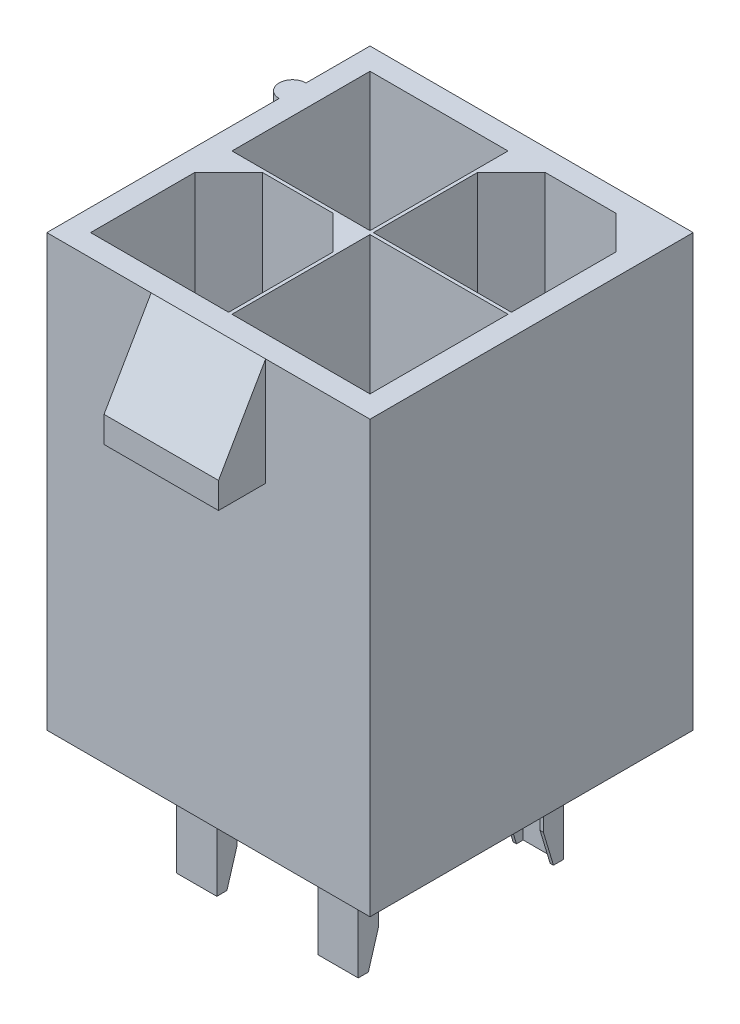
ISO-10303-21;
HEADER;
FILE_DESCRIPTION(('STEP AP214'),'2;1');
FILE_NAME('part.step','',(''),(''),'','','');
FILE_SCHEMA(('AUTOMOTIVE_DESIGN { 1 0 10303 214 1 1 1 1 }'));
ENDSEC;
DATA;
#1=APPLICATION_CONTEXT('core data for automotive mechanical design processes');
#2=APPLICATION_PROTOCOL_DEFINITION('international standard','automotive_design',2000,#1);
#3=PRODUCT_CONTEXT('',#1,'mechanical');
#4=PRODUCT('Part','Part','',(#3));
#5=PRODUCT_RELATED_PRODUCT_CATEGORY('part','',(#4));
#6=PRODUCT_DEFINITION_FORMATION('','',#4);
#7=PRODUCT_DEFINITION_CONTEXT('part definition',#1,'design');
#8=PRODUCT_DEFINITION('design','',#6,#7);
#9=PRODUCT_DEFINITION_SHAPE('','',#8);
#10=(LENGTH_UNIT() NAMED_UNIT(*) SI_UNIT(.MILLI.,.METRE.));
#11=(NAMED_UNIT(*) PLANE_ANGLE_UNIT() SI_UNIT($,.RADIAN.));
#12=(NAMED_UNIT(*) SI_UNIT($,.STERADIAN.) SOLID_ANGLE_UNIT());
#13=UNCERTAINTY_MEASURE_WITH_UNIT(LENGTH_MEASURE(1.E-05),#10,'distance_accuracy_value','');
#14=(GEOMETRIC_REPRESENTATION_CONTEXT(3) GLOBAL_UNCERTAINTY_ASSIGNED_CONTEXT((#13)) GLOBAL_UNIT_ASSIGNED_CONTEXT((#10,
#11,#12)) REPRESENTATION_CONTEXT('',''));
#15=CARTESIAN_POINT('',(0.,0.,0.));
#16=DIRECTION('',(0.,0.,1.));
#17=DIRECTION('',(1.,0.,0.));
#18=AXIS2_PLACEMENT_3D('',#15,#16,#17);
#19=CARTESIAN_POINT('',(-2.7,0.,-4.6));
#20=DIRECTION('',(0.,-1.,0.));
#21=DIRECTION('',(0.,0.,-1.));
#22=AXIS2_PLACEMENT_3D('',#19,#20,#21);
#23=PLANE('',#22);
#24=DIRECTION('',(0.,0.,-1.));
#25=VECTOR('',#24,1.);
#26=CARTESIAN_POINT('',(4.7,0.,-4.55));
#27=LINE('',#26,#25);
#28=CARTESIAN_POINT('',(4.7,0.,-4.55));
#29=VERTEX_POINT('',#28);
#30=CARTESIAN_POINT('',(4.7,0.,-5.05));
#31=VERTEX_POINT('',#30);
#32=EDGE_CURVE('E662',#29,#31,#27,.T.);
#33=ORIENTED_EDGE('',*,*,#32,.F.);
#34=DIRECTION('',(-1.,0.,0.));
#35=VECTOR('',#34,1.);
#36=CARTESIAN_POINT('',(4.8,0.,-4.55));
#37=LINE('',#36,#35);
#38=CARTESIAN_POINT('',(4.8,0.,-4.55));
#39=VERTEX_POINT('',#38);
#40=EDGE_CURVE('E59',#39,#29,#37,.T.);
#41=ORIENTED_EDGE('',*,*,#40,.F.);
#42=DIRECTION('',(0.,0.,1.));
#43=VECTOR('',#42,1.);
#44=CARTESIAN_POINT('',(4.8,0.,-5.15));
#45=LINE('',#44,#43);
#46=CARTESIAN_POINT('',(4.8,0.,-5.15));
#47=VERTEX_POINT('',#46);
#48=EDGE_CURVE('E727',#47,#39,#45,.T.);
#49=ORIENTED_EDGE('',*,*,#48,.F.);
#50=DIRECTION('',(1.,0.,0.));
#51=VECTOR('',#50,1.);
#52=CARTESIAN_POINT('',(3.6,0.,-5.15));
#53=LINE('',#52,#51);
#54=CARTESIAN_POINT('',(3.6,0.,-5.15));
#55=VERTEX_POINT('',#54);
#56=EDGE_CURVE('E720',#55,#47,#53,.T.);
#57=ORIENTED_EDGE('',*,*,#56,.F.);
#58=DIRECTION('',(0.,0.,-1.));
#59=VECTOR('',#58,1.);
#60=CARTESIAN_POINT('',(3.6,0.,-4.55));
#61=LINE('',#60,#59);
#62=CARTESIAN_POINT('',(3.6,0.,-4.55));
#63=VERTEX_POINT('',#62);
#64=EDGE_CURVE('E715',#63,#55,#61,.T.);
#65=ORIENTED_EDGE('',*,*,#64,.F.);
#66=DIRECTION('',(-1.,0.,0.));
#67=VECTOR('',#66,1.);
#68=CARTESIAN_POINT('',(3.7,0.,-4.55));
#69=LINE('',#68,#67);
#70=CARTESIAN_POINT('',(3.7,0.,-4.55));
#71=VERTEX_POINT('',#70);
#72=EDGE_CURVE('E712',#71,#63,#69,.T.);
#73=ORIENTED_EDGE('',*,*,#72,.F.);
#74=DIRECTION('',(0.,0.,1.));
#75=VECTOR('',#74,1.);
#76=CARTESIAN_POINT('',(3.7,0.,-5.05));
#77=LINE('',#76,#75);
#78=CARTESIAN_POINT('',(3.7,0.,-5.05));
#79=VERTEX_POINT('',#78);
#80=EDGE_CURVE('E707',#79,#71,#77,.T.);
#81=ORIENTED_EDGE('',*,*,#80,.F.);
#82=DIRECTION('',(-1.,0.,0.));
#83=VECTOR('',#82,1.);
#84=CARTESIAN_POINT('',(4.7,0.,-5.05));
#85=LINE('',#84,#83);
#86=EDGE_CURVE('E700',#31,#79,#85,.T.);
#87=ORIENTED_EDGE('',*,*,#86,.F.);
#88=EDGE_LOOP('',(#33,#41,#49,#57,#65,#73,#81,#87));
#89=FACE_BOUND('',#88,.T.);
#90=DIRECTION('',(0.,0.,-1.));
#91=VECTOR('',#90,1.);
#92=CARTESIAN_POINT('',(-0.600000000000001,0.,-4.55));
#93=LINE('',#92,#91);
#94=CARTESIAN_POINT('',(-0.600000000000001,0.,-4.55));
#95=VERTEX_POINT('',#94);
#96=CARTESIAN_POINT('',(-0.600000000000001,0.,-5.15));
#97=VERTEX_POINT('',#96);
#98=EDGE_CURVE('E836',#95,#97,#93,.T.);
#99=ORIENTED_EDGE('',*,*,#98,.F.);
#100=DIRECTION('',(-1.,0.,0.));
#101=VECTOR('',#100,1.);
#102=CARTESIAN_POINT('',(-0.500000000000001,0.,-4.55));
#103=LINE('',#102,#101);
#104=CARTESIAN_POINT('',(-0.500000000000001,0.,-4.55));
#105=VERTEX_POINT('',#104);
#106=EDGE_CURVE('E817',#105,#95,#103,.T.);
#107=ORIENTED_EDGE('',*,*,#106,.F.);
#108=DIRECTION('',(0.,0.,1.));
#109=VECTOR('',#108,1.);
#110=CARTESIAN_POINT('',(-0.500000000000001,0.,-5.05));
#111=LINE('',#110,#109);
#112=CARTESIAN_POINT('',(-0.5,0.,-5.05));
#113=VERTEX_POINT('',#112);
#114=EDGE_CURVE('E821',#113,#105,#111,.T.);
#115=ORIENTED_EDGE('',*,*,#114,.F.);
#116=DIRECTION('',(-1.,0.,0.));
#117=VECTOR('',#116,1.);
#118=CARTESIAN_POINT('',(0.499999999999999,0.,-5.05));
#119=LINE('',#118,#117);
#120=CARTESIAN_POINT('',(0.499999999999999,0.,-5.05));
#121=VERTEX_POINT('',#120);
#122=EDGE_CURVE('E848',#121,#113,#119,.T.);
#123=ORIENTED_EDGE('',*,*,#122,.F.);
#124=DIRECTION('',(0.,0.,-1.));
#125=VECTOR('',#124,1.);
#126=CARTESIAN_POINT('',(0.499999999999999,0.,-4.55));
#127=LINE('',#126,#125);
#128=CARTESIAN_POINT('',(0.499999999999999,0.,-4.55));
#129=VERTEX_POINT('',#128);
#130=EDGE_CURVE('E846',#129,#121,#127,.T.);
#131=ORIENTED_EDGE('',*,*,#130,.F.);
#132=DIRECTION('',(-1.,0.,0.));
#133=VECTOR('',#132,1.);
#134=CARTESIAN_POINT('',(0.599999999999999,0.,-4.55));
#135=LINE('',#134,#133);
#136=CARTESIAN_POINT('',(0.599999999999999,0.,-4.55));
#137=VERTEX_POINT('',#136);
#138=EDGE_CURVE('E843',#137,#129,#135,.T.);
#139=ORIENTED_EDGE('',*,*,#138,.F.);
#140=DIRECTION('',(0.,0.,1.));
#141=VECTOR('',#140,1.);
#142=CARTESIAN_POINT('',(0.599999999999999,0.,-5.15));
#143=LINE('',#142,#141);
#144=CARTESIAN_POINT('',(0.599999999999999,0.,-5.15));
#145=VERTEX_POINT('',#144);
#146=EDGE_CURVE('E840',#145,#137,#143,.T.);
#147=ORIENTED_EDGE('',*,*,#146,.F.);
#148=DIRECTION('',(1.,0.,0.));
#149=VECTOR('',#148,1.);
#150=CARTESIAN_POINT('',(-0.600000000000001,0.,-5.15));
#151=LINE('',#150,#149);
#152=EDGE_CURVE('E838',#97,#145,#151,.T.);
#153=ORIENTED_EDGE('',*,*,#152,.F.);
#154=EDGE_LOOP('',(#99,#107,#115,#123,#131,#139,#147,#153));
#155=FACE_BOUND('',#154,.T.);
#156=DIRECTION('',(0.,0.,1.));
#157=VECTOR('',#156,1.);
#158=CARTESIAN_POINT('',(-2.7,0.,-6.9));
#159=LINE('',#158,#157);
#160=CARTESIAN_POINT('',(-2.7,0.,-6.9));
#161=VERTEX_POINT('',#160);
#162=CARTESIAN_POINT('',(-2.7,0.,-5.));
#163=VERTEX_POINT('',#162);
#164=EDGE_CURVE('E925',#161,#163,#159,.T.);
#165=ORIENTED_EDGE('',*,*,#164,.F.);
#166=DIRECTION('',(-1.,0.,0.));
#167=VECTOR('',#166,1.);
#168=CARTESIAN_POINT('',(-2.7,0.,-6.9));
#169=LINE('',#168,#167);
#170=CARTESIAN_POINT('',(6.9,0.,-6.9));
#171=VERTEX_POINT('',#170);
#172=EDGE_CURVE('E937',#171,#161,#169,.T.);
#173=ORIENTED_EDGE('',*,*,#172,.F.);
#174=DIRECTION('',(0.,0.,-1.));
#175=VECTOR('',#174,1.);
#176=CARTESIAN_POINT('',(6.9,0.,-6.9));
#177=LINE('',#176,#175);
#178=CARTESIAN_POINT('',(6.9,0.,2.7));
#179=VERTEX_POINT('',#178);
#180=EDGE_CURVE('E935',#179,#171,#177,.T.);
#181=ORIENTED_EDGE('',*,*,#180,.F.);
#182=DIRECTION('',(1.,0.,0.));
#183=VECTOR('',#182,1.);
#184=CARTESIAN_POINT('',(-2.7,0.,2.7));
#185=LINE('',#184,#183);
#186=CARTESIAN_POINT('',(-2.7,0.,2.7));
#187=VERTEX_POINT('',#186);
#188=EDGE_CURVE('E933',#187,#179,#185,.T.);
#189=ORIENTED_EDGE('',*,*,#188,.F.);
#190=DIRECTION('',(0.,0.,1.));
#191=VECTOR('',#190,1.);
#192=CARTESIAN_POINT('',(-2.7,0.,-4.2));
#193=LINE('',#192,#191);
#194=CARTESIAN_POINT('',(-2.7,0.,-4.2));
#195=VERTEX_POINT('',#194);
#196=EDGE_CURVE('E931',#195,#187,#193,.T.);
#197=ORIENTED_EDGE('',*,*,#196,.F.);
#198=CARTESIAN_POINT('',(-2.7,0.,-4.6));
#199=DIRECTION('',(0.,1.,0.));
#200=DIRECTION('',(0.,0.,-1.));
#201=AXIS2_PLACEMENT_3D('',#198,#199,#200);
#202=CIRCLE('',#201,0.4);
#203=EDGE_CURVE('E928',#163,#195,#202,.T.);
#204=ORIENTED_EDGE('',*,*,#203,.F.);
#205=EDGE_LOOP('',(#165,#173,#181,#189,#197,#204));
#206=FACE_BOUND('',#205,.T.);
#207=DIRECTION('',(1.,0.,0.));
#208=VECTOR('',#207,1.);
#209=CARTESIAN_POINT('',(0.499999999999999,0.,0.849999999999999));
#210=LINE('',#209,#208);
#211=CARTESIAN_POINT('',(-0.500000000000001,0.,0.849999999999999));
#212=VERTEX_POINT('',#211);
#213=CARTESIAN_POINT('',(0.499999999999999,0.,0.849999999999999));
#214=VERTEX_POINT('',#213);
#215=EDGE_CURVE('E782',#212,#214,#210,.T.);
#216=ORIENTED_EDGE('',*,*,#215,.F.);
#217=DIRECTION('',(0.,0.,1.));
#218=VECTOR('',#217,1.);
#219=CARTESIAN_POINT('',(-0.500000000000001,0.,0.849999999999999));
#220=LINE('',#219,#218);
#221=CARTESIAN_POINT('',(-0.500000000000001,0.,0.349999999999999));
#222=VERTEX_POINT('',#221);
#223=EDGE_CURVE('E763',#222,#212,#220,.T.);
#224=ORIENTED_EDGE('',*,*,#223,.F.);
#225=DIRECTION('',(1.,0.,0.));
#226=VECTOR('',#225,1.);
#227=CARTESIAN_POINT('',(-0.500000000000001,0.,0.349999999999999));
#228=LINE('',#227,#226);
#229=CARTESIAN_POINT('',(-0.600000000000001,0.,0.349999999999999));
#230=VERTEX_POINT('',#229);
#231=EDGE_CURVE('E767',#230,#222,#228,.T.);
#232=ORIENTED_EDGE('',*,*,#231,.F.);
#233=DIRECTION('',(0.,0.,-1.));
#234=VECTOR('',#233,1.);
#235=CARTESIAN_POINT('',(-0.600000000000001,0.,0.349999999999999));
#236=LINE('',#235,#234);
#237=CARTESIAN_POINT('',(-0.600000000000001,0.,0.95));
#238=VERTEX_POINT('',#237);
#239=EDGE_CURVE('E794',#238,#230,#236,.T.);
#240=ORIENTED_EDGE('',*,*,#239,.F.);
#241=DIRECTION('',(-1.,0.,0.));
#242=VECTOR('',#241,1.);
#243=CARTESIAN_POINT('',(-0.600000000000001,0.,0.95));
#244=LINE('',#243,#242);
#245=CARTESIAN_POINT('',(0.599999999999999,0.,0.95));
#246=VERTEX_POINT('',#245);
#247=EDGE_CURVE('E792',#246,#238,#244,.T.);
#248=ORIENTED_EDGE('',*,*,#247,.F.);
#249=DIRECTION('',(0.,0.,1.));
#250=VECTOR('',#249,1.);
#251=CARTESIAN_POINT('',(0.599999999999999,0.,0.95));
#252=LINE('',#251,#250);
#253=CARTESIAN_POINT('',(0.599999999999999,0.,0.349999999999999));
#254=VERTEX_POINT('',#253);
#255=EDGE_CURVE('E790',#254,#246,#252,.T.);
#256=ORIENTED_EDGE('',*,*,#255,.F.);
#257=DIRECTION('',(1.,0.,0.));
#258=VECTOR('',#257,1.);
#259=CARTESIAN_POINT('',(0.599999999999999,0.,0.349999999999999));
#260=LINE('',#259,#258);
#261=CARTESIAN_POINT('',(0.499999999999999,0.,0.349999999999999));
#262=VERTEX_POINT('',#261);
#263=EDGE_CURVE('E787',#262,#254,#260,.T.);
#264=ORIENTED_EDGE('',*,*,#263,.F.);
#265=DIRECTION('',(0.,0.,-1.));
#266=VECTOR('',#265,1.);
#267=CARTESIAN_POINT('',(0.499999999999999,0.,0.349999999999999));
#268=LINE('',#267,#266);
#269=EDGE_CURVE('E784',#214,#262,#268,.T.);
#270=ORIENTED_EDGE('',*,*,#269,.F.);
#271=EDGE_LOOP('',(#216,#224,#232,#240,#248,#256,#264,#270));
#272=FACE_BOUND('',#271,.T.);
#273=DIRECTION('',(0.,0.,1.));
#274=VECTOR('',#273,1.);
#275=CARTESIAN_POINT('',(4.8,0.,0.949999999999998));
#276=LINE('',#275,#274);
#277=CARTESIAN_POINT('',(4.8,0.,0.349999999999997));
#278=VERTEX_POINT('',#277);
#279=CARTESIAN_POINT('',(4.8,0.,0.949999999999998));
#280=VERTEX_POINT('',#279);
#281=EDGE_CURVE('E592',#278,#280,#276,.T.);
#282=ORIENTED_EDGE('',*,*,#281,.F.);
#283=DIRECTION('',(1.,0.,0.));
#284=VECTOR('',#283,1.);
#285=CARTESIAN_POINT('',(4.8,0.,0.349999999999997));
#286=LINE('',#285,#284);
#287=CARTESIAN_POINT('',(4.7,0.,0.349999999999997));
#288=VERTEX_POINT('',#287);
#289=EDGE_CURVE('E51',#288,#278,#286,.T.);
#290=ORIENTED_EDGE('',*,*,#289,.F.);
#291=DIRECTION('',(0.,0.,-1.));
#292=VECTOR('',#291,1.);
#293=CARTESIAN_POINT('',(4.7,0.,0.349999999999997));
#294=LINE('',#293,#292);
#295=CARTESIAN_POINT('',(4.7,0.,0.849999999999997));
#296=VERTEX_POINT('',#295);
#297=EDGE_CURVE('E658',#296,#288,#294,.T.);
#298=ORIENTED_EDGE('',*,*,#297,.F.);
#299=DIRECTION('',(1.,0.,0.));
#300=VECTOR('',#299,1.);
#301=CARTESIAN_POINT('',(4.7,0.,0.849999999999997));
#302=LINE('',#301,#300);
#303=CARTESIAN_POINT('',(3.7,0.,0.849999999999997));
#304=VERTEX_POINT('',#303);
#305=EDGE_CURVE('E651',#304,#296,#302,.T.);
#306=ORIENTED_EDGE('',*,*,#305,.F.);
#307=DIRECTION('',(0.,0.,1.));
#308=VECTOR('',#307,1.);
#309=CARTESIAN_POINT('',(3.7,0.,0.849999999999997));
#310=LINE('',#309,#308);
#311=CARTESIAN_POINT('',(3.7,0.,0.349999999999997));
#312=VERTEX_POINT('',#311);
#313=EDGE_CURVE('E646',#312,#304,#310,.T.);
#314=ORIENTED_EDGE('',*,*,#313,.F.);
#315=DIRECTION('',(1.,0.,0.));
#316=VECTOR('',#315,1.);
#317=CARTESIAN_POINT('',(3.7,0.,0.349999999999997));
#318=LINE('',#317,#316);
#319=CARTESIAN_POINT('',(3.6,0.,0.349999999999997));
#320=VERTEX_POINT('',#319);
#321=EDGE_CURVE('E643',#320,#312,#318,.T.);
#322=ORIENTED_EDGE('',*,*,#321,.F.);
#323=DIRECTION('',(0.,0.,-1.));
#324=VECTOR('',#323,1.);
#325=CARTESIAN_POINT('',(3.6,0.,0.349999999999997));
#326=LINE('',#325,#324);
#327=CARTESIAN_POINT('',(3.6,0.,0.949999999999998));
#328=VERTEX_POINT('',#327);
#329=EDGE_CURVE('E639',#328,#320,#326,.T.);
#330=ORIENTED_EDGE('',*,*,#329,.F.);
#331=DIRECTION('',(-1.,0.,0.));
#332=VECTOR('',#331,1.);
#333=CARTESIAN_POINT('',(3.6,0.,0.949999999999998));
#334=LINE('',#333,#332);
#335=EDGE_CURVE('E634',#280,#328,#334,.T.);
#336=ORIENTED_EDGE('',*,*,#335,.F.);
#337=EDGE_LOOP('',(#282,#290,#298,#306,#314,#322,#330,#336));
#338=FACE_BOUND('',#337,.T.);
#339=ADVANCED_FACE('F36',(#89,#155,#206,#272,#338),#23,.T.);
#340=CARTESIAN_POINT('',(-2.7,12.8,2.7));
#341=DIRECTION('',(0.,0.,-1.));
#342=DIRECTION('',(-1.,0.,0.));
#343=AXIS2_PLACEMENT_3D('',#340,#341,#342);
#344=PLANE('',#343);
#345=DIRECTION('',(0.,-1.,0.));
#346=VECTOR('',#345,1.);
#347=CARTESIAN_POINT('',(0.400000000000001,9.6,2.7));
#348=LINE('',#347,#346);
#349=CARTESIAN_POINT('',(0.400000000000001,12.8,2.7));
#350=VERTEX_POINT('',#349);
#351=CARTESIAN_POINT('',(0.400000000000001,9.6,2.7));
#352=VERTEX_POINT('',#351);
#353=EDGE_CURVE('E876',#350,#352,#348,.T.);
#354=ORIENTED_EDGE('',*,*,#353,.F.);
#355=DIRECTION('',(1.,0.,0.));
#356=VECTOR('',#355,1.);
#357=CARTESIAN_POINT('',(-2.7,12.8,2.7));
#358=LINE('',#357,#356);
#359=CARTESIAN_POINT('',(-2.7,12.8,2.7));
#360=VERTEX_POINT('',#359);
#361=EDGE_CURVE('E912',#360,#350,#358,.T.);
#362=ORIENTED_EDGE('',*,*,#361,.F.);
#363=DIRECTION('',(0.,-1.,0.));
#364=VECTOR('',#363,1.);
#365=CARTESIAN_POINT('',(-2.7,12.8,2.7));
#366=LINE('',#365,#364);
#367=EDGE_CURVE('E948',#360,#187,#366,.T.);
#368=ORIENTED_EDGE('',*,*,#367,.T.);
#369=ORIENTED_EDGE('',*,*,#188,.T.);
#370=DIRECTION('',(0.,-1.,0.));
#371=VECTOR('',#370,1.);
#372=CARTESIAN_POINT('',(6.9,12.8,2.7));
#373=LINE('',#372,#371);
#374=CARTESIAN_POINT('',(6.9,12.8,2.7));
#375=VERTEX_POINT('',#374);
#376=EDGE_CURVE('E945',#375,#179,#373,.T.);
#377=ORIENTED_EDGE('',*,*,#376,.F.);
#378=CARTESIAN_POINT('',(3.8,12.8,2.7));
#379=VERTEX_POINT('',#378);
#380=EDGE_CURVE('E909',#379,#375,#358,.T.);
#381=ORIENTED_EDGE('',*,*,#380,.F.);
#382=DIRECTION('',(0.,-1.,0.));
#383=VECTOR('',#382,1.);
#384=CARTESIAN_POINT('',(3.8,9.6,2.7));
#385=LINE('',#384,#383);
#386=CARTESIAN_POINT('',(3.8,9.6,2.7));
#387=VERTEX_POINT('',#386);
#388=EDGE_CURVE('E897',#379,#387,#385,.T.);
#389=ORIENTED_EDGE('',*,*,#388,.T.);
#390=DIRECTION('',(-1.,0.,0.));
#391=VECTOR('',#390,1.);
#392=CARTESIAN_POINT('',(3.8,9.6,2.7));
#393=LINE('',#392,#391);
#394=EDGE_CURVE('E888',#387,#352,#393,.T.);
#395=ORIENTED_EDGE('',*,*,#394,.T.);
#396=EDGE_LOOP('',(#354,#362,#368,#369,#377,#381,#389,#395));
#397=FACE_BOUND('',#396,.T.);
#398=ADVANCED_FACE('F1080',(#397),#344,.F.);
#399=CARTESIAN_POINT('',(4.2,3.5,-4.2));
#400=DIRECTION('',(0.,-1.,0.));
#401=DIRECTION('',(0.,0.,-1.));
#402=AXIS2_PLACEMENT_3D('',#399,#400,#401);
#403=PLANE('',#402);
#404=DIRECTION('',(1.,0.,0.));
#405=VECTOR('',#404,1.);
#406=CARTESIAN_POINT('',(6.25,3.5,-2.15));
#407=LINE('',#406,#405);
#408=CARTESIAN_POINT('',(2.15,3.5,-2.15));
#409=VERTEX_POINT('',#408);
#410=CARTESIAN_POINT('',(6.25,3.5,-2.15));
#411=VERTEX_POINT('',#410);
#412=EDGE_CURVE('E1259',#409,#411,#407,.T.);
#413=ORIENTED_EDGE('',*,*,#412,.T.);
#414=DIRECTION('',(0.,0.,-1.));
#415=VECTOR('',#414,1.);
#416=CARTESIAN_POINT('',(6.25,3.5,-5.25));
#417=LINE('',#416,#415);
#418=CARTESIAN_POINT('',(6.25,3.5,-5.25));
#419=VERTEX_POINT('',#418);
#420=EDGE_CURVE('E1261',#411,#419,#417,.T.);
#421=ORIENTED_EDGE('',*,*,#420,.T.);
#422=DIRECTION('',(-0.707106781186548,0.,-0.707106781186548));
#423=VECTOR('',#422,1.);
#424=CARTESIAN_POINT('',(5.25,3.5,-6.25));
#425=LINE('',#424,#423);
#426=CARTESIAN_POINT('',(5.25,3.5,-6.25));
#427=VERTEX_POINT('',#426);
#428=EDGE_CURVE('E1263',#419,#427,#425,.T.);
#429=ORIENTED_EDGE('',*,*,#428,.T.);
#430=DIRECTION('',(-1.,0.,0.));
#431=VECTOR('',#430,1.);
#432=CARTESIAN_POINT('',(3.15,3.5,-6.25));
#433=LINE('',#432,#431);
#434=CARTESIAN_POINT('',(3.15,3.5,-6.25));
#435=VERTEX_POINT('',#434);
#436=EDGE_CURVE('E1265',#427,#435,#433,.T.);
#437=ORIENTED_EDGE('',*,*,#436,.T.);
#438=DIRECTION('',(-0.707106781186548,0.,0.707106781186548));
#439=VECTOR('',#438,1.);
#440=CARTESIAN_POINT('',(2.15,3.5,-5.25));
#441=LINE('',#440,#439);
#442=CARTESIAN_POINT('',(2.15,3.5,-5.25));
#443=VERTEX_POINT('',#442);
#444=EDGE_CURVE('E1267',#435,#443,#441,.T.);
#445=ORIENTED_EDGE('',*,*,#444,.T.);
#446=DIRECTION('',(0.,0.,1.));
#447=VECTOR('',#446,1.);
#448=CARTESIAN_POINT('',(2.15,3.5,-2.15));
#449=LINE('',#448,#447);
#450=EDGE_CURVE('E1269',#443,#409,#449,.T.);
#451=ORIENTED_EDGE('',*,*,#450,.T.);
#452=EDGE_LOOP('',(#413,#421,#429,#437,#445,#451));
#453=FACE_BOUND('',#452,.T.);
#454=DIRECTION('',(0.,0.,-1.));
#455=VECTOR('',#454,1.);
#456=CARTESIAN_POINT('',(4.7,3.5,-4.7));
#457=LINE('',#456,#455);
#458=CARTESIAN_POINT('',(4.7,3.5,-3.7));
#459=VERTEX_POINT('',#458);
#460=CARTESIAN_POINT('',(4.7,3.5,-4.7));
#461=VERTEX_POINT('',#460);
#462=EDGE_CURVE('E1029',#459,#461,#457,.T.);
#463=ORIENTED_EDGE('',*,*,#462,.F.);
#464=DIRECTION('',(1.,0.,0.));
#465=VECTOR('',#464,1.);
#466=CARTESIAN_POINT('',(3.7,3.5,-3.7));
#467=LINE('',#466,#465);
#468=CARTESIAN_POINT('',(3.7,3.5,-3.7));
#469=VERTEX_POINT('',#468);
#470=EDGE_CURVE('E1187',#469,#459,#467,.T.);
#471=ORIENTED_EDGE('',*,*,#470,.F.);
#472=DIRECTION('',(0.,0.,1.));
#473=VECTOR('',#472,1.);
#474=CARTESIAN_POINT('',(3.7,3.5,-4.7));
#475=LINE('',#474,#473);
#476=CARTESIAN_POINT('',(3.7,3.5,-4.7));
#477=VERTEX_POINT('',#476);
#478=EDGE_CURVE('E1846',#477,#469,#475,.T.);
#479=ORIENTED_EDGE('',*,*,#478,.F.);
#480=DIRECTION('',(-1.,0.,0.));
#481=VECTOR('',#480,1.);
#482=CARTESIAN_POINT('',(3.7,3.5,-4.7));
#483=LINE('',#482,#481);
#484=EDGE_CURVE('E1200',#461,#477,#483,.T.);
#485=ORIENTED_EDGE('',*,*,#484,.F.);
#486=EDGE_LOOP('',(#463,#471,#479,#485));
#487=FACE_BOUND('',#486,.T.);
#488=ADVANCED_FACE('F1086',(#453,#487),#403,.F.);
#489=CARTESIAN_POINT('',(4.2,3.5,4.2));
#490=DIRECTION('',(0.,-1.,0.));
#491=DIRECTION('',(0.,0.,-1.));
#492=AXIS2_PLACEMENT_3D('',#489,#490,#491);
#493=PLANE('',#492);
#494=DIRECTION('',(0.,0.,1.));
#495=VECTOR('',#494,1.);
#496=CARTESIAN_POINT('',(2.15,3.5,2.05));
#497=LINE('',#496,#495);
#498=CARTESIAN_POINT('',(2.15,3.5,-2.05));
#499=VERTEX_POINT('',#498);
#500=CARTESIAN_POINT('',(2.15,3.5,2.05));
#501=VERTEX_POINT('',#500);
#502=EDGE_CURVE('E1302',#499,#501,#497,.T.);
#503=ORIENTED_EDGE('',*,*,#502,.T.);
#504=DIRECTION('',(1.,0.,0.));
#505=VECTOR('',#504,1.);
#506=CARTESIAN_POINT('',(2.15,3.5,2.05));
#507=LINE('',#506,#505);
#508=CARTESIAN_POINT('',(6.25,3.5,2.05));
#509=VERTEX_POINT('',#508);
#510=EDGE_CURVE('E1304',#501,#509,#507,.T.);
#511=ORIENTED_EDGE('',*,*,#510,.T.);
#512=DIRECTION('',(0.,0.,-1.));
#513=VECTOR('',#512,1.);
#514=CARTESIAN_POINT('',(6.25,3.5,2.05));
#515=LINE('',#514,#513);
#516=CARTESIAN_POINT('',(6.25,3.5,-2.05));
#517=VERTEX_POINT('',#516);
#518=EDGE_CURVE('E1306',#509,#517,#515,.T.);
#519=ORIENTED_EDGE('',*,*,#518,.T.);
#520=DIRECTION('',(-1.,0.,0.));
#521=VECTOR('',#520,1.);
#522=CARTESIAN_POINT('',(2.15,3.5,-2.05));
#523=LINE('',#522,#521);
#524=EDGE_CURVE('E1308',#517,#499,#523,.T.);
#525=ORIENTED_EDGE('',*,*,#524,.T.);
#526=EDGE_LOOP('',(#503,#511,#519,#525));
#527=FACE_BOUND('',#526,.T.);
#528=DIRECTION('',(0.,0.,-1.));
#529=VECTOR('',#528,1.);
#530=CARTESIAN_POINT('',(4.7,3.5,-0.5));
#531=LINE('',#530,#529);
#532=CARTESIAN_POINT('',(4.7,3.5,0.5));
#533=VERTEX_POINT('',#532);
#534=CARTESIAN_POINT('',(4.7,3.5,-0.5));
#535=VERTEX_POINT('',#534);
#536=EDGE_CURVE('E1202',#533,#535,#531,.T.);
#537=ORIENTED_EDGE('',*,*,#536,.F.);
#538=DIRECTION('',(1.,0.,0.));
#539=VECTOR('',#538,1.);
#540=CARTESIAN_POINT('',(3.7,3.5,0.5));
#541=LINE('',#540,#539);
#542=CARTESIAN_POINT('',(3.7,3.5,0.5));
#543=VERTEX_POINT('',#542);
#544=EDGE_CURVE('E1062',#543,#533,#541,.T.);
#545=ORIENTED_EDGE('',*,*,#544,.F.);
#546=DIRECTION('',(0.,0.,1.));
#547=VECTOR('',#546,1.);
#548=CARTESIAN_POINT('',(3.7,3.5,-0.5));
#549=LINE('',#548,#547);
#550=CARTESIAN_POINT('',(3.7,3.5,-0.5));
#551=VERTEX_POINT('',#550);
#552=EDGE_CURVE('E1210',#551,#543,#549,.T.);
#553=ORIENTED_EDGE('',*,*,#552,.F.);
#554=DIRECTION('',(-1.,0.,0.));
#555=VECTOR('',#554,1.);
#556=CARTESIAN_POINT('',(3.7,3.5,-0.5));
#557=LINE('',#556,#555);
#558=EDGE_CURVE('E1207',#535,#551,#557,.T.);
#559=ORIENTED_EDGE('',*,*,#558,.F.);
#560=EDGE_LOOP('',(#537,#545,#553,#559));
#561=FACE_BOUND('',#560,.T.);
#562=ADVANCED_FACE('F1662',(#527,#561),#493,.F.);
#563=CARTESIAN_POINT('',(0.,3.5,0.));
#564=DIRECTION('',(0.,-1.,0.));
#565=DIRECTION('',(0.,0.,-1.));
#566=AXIS2_PLACEMENT_3D('',#563,#564,#565);
#567=PLANE('',#566);
#568=DIRECTION('',(0.,0.,1.));
#569=VECTOR('',#568,1.);
#570=CARTESIAN_POINT('',(-2.05,3.5,-2.15));
#571=LINE('',#570,#569);
#572=CARTESIAN_POINT('',(-2.05,3.5,-6.25));
#573=VERTEX_POINT('',#572);
#574=CARTESIAN_POINT('',(-2.05,3.5,-2.15));
#575=VERTEX_POINT('',#574);
#576=EDGE_CURVE('E1330',#573,#575,#571,.T.);
#577=ORIENTED_EDGE('',*,*,#576,.T.);
#578=DIRECTION('',(1.,0.,0.));
#579=VECTOR('',#578,1.);
#580=CARTESIAN_POINT('',(-2.05,3.5,-2.15));
#581=LINE('',#580,#579);
#582=CARTESIAN_POINT('',(2.05,3.5,-2.15));
#583=VERTEX_POINT('',#582);
#584=EDGE_CURVE('E1333',#575,#583,#581,.T.);
#585=ORIENTED_EDGE('',*,*,#584,.T.);
#586=DIRECTION('',(0.,0.,-1.));
#587=VECTOR('',#586,1.);
#588=CARTESIAN_POINT('',(2.05,3.5,-2.15));
#589=LINE('',#588,#587);
#590=CARTESIAN_POINT('',(2.05,3.5,-6.25));
#591=VERTEX_POINT('',#590);
#592=EDGE_CURVE('E1337',#583,#591,#589,.T.);
#593=ORIENTED_EDGE('',*,*,#592,.T.);
#594=DIRECTION('',(-1.,0.,0.));
#595=VECTOR('',#594,1.);
#596=CARTESIAN_POINT('',(-2.05,3.5,-6.25));
#597=LINE('',#596,#595);
#598=EDGE_CURVE('E1340',#591,#573,#597,.T.);
#599=ORIENTED_EDGE('',*,*,#598,.T.);
#600=EDGE_LOOP('',(#577,#585,#593,#599));
#601=FACE_BOUND('',#600,.T.);
#602=DIRECTION('',(0.,0.,-1.));
#603=VECTOR('',#602,1.);
#604=CARTESIAN_POINT('',(0.499999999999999,3.5,-4.7));
#605=LINE('',#604,#603);
#606=CARTESIAN_POINT('',(0.5,3.5,-3.7));
#607=VERTEX_POINT('',#606);
#608=CARTESIAN_POINT('',(0.499999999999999,3.5,-4.7));
#609=VERTEX_POINT('',#608);
#610=EDGE_CURVE('E988',#607,#609,#605,.T.);
#611=ORIENTED_EDGE('',*,*,#610,.F.);
#612=DIRECTION('',(1.,0.,0.));
#613=VECTOR('',#612,1.);
#614=CARTESIAN_POINT('',(-0.500000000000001,3.5,-3.7));
#615=LINE('',#614,#613);
#616=CARTESIAN_POINT('',(-0.500000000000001,3.5,-3.7));
#617=VERTEX_POINT('',#616);
#618=EDGE_CURVE('E1226',#617,#607,#615,.T.);
#619=ORIENTED_EDGE('',*,*,#618,.F.);
#620=DIRECTION('',(0.,0.,1.));
#621=VECTOR('',#620,1.);
#622=CARTESIAN_POINT('',(-0.500000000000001,3.5,-4.7));
#623=LINE('',#622,#621);
#624=CARTESIAN_POINT('',(-0.500000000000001,3.5,-4.7));
#625=VERTEX_POINT('',#624);
#626=EDGE_CURVE('E1223',#625,#617,#623,.T.);
#627=ORIENTED_EDGE('',*,*,#626,.F.);
#628=DIRECTION('',(-1.,0.,0.));
#629=VECTOR('',#628,1.);
#630=CARTESIAN_POINT('',(-0.500000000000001,3.5,-4.7));
#631=LINE('',#630,#629);
#632=EDGE_CURVE('E1220',#609,#625,#631,.T.);
#633=ORIENTED_EDGE('',*,*,#632,.F.);
#634=EDGE_LOOP('',(#611,#619,#627,#633));
#635=FACE_BOUND('',#634,.T.);
#636=ADVANCED_FACE('F1690',(#601,#635),#567,.F.);
#637=CARTESIAN_POINT('',(0.,3.5,0.));
#638=DIRECTION('',(0.,-1.,0.));
#639=DIRECTION('',(0.,0.,-1.));
#640=AXIS2_PLACEMENT_3D('',#637,#638,#639);
#641=PLANE('',#640);
#642=DIRECTION('',(1.,0.,0.));
#643=VECTOR('',#642,1.);
#644=CARTESIAN_POINT('',(2.05,3.5,2.05));
#645=LINE('',#644,#643);
#646=CARTESIAN_POINT('',(-2.05,3.5,2.05));
#647=VERTEX_POINT('',#646);
#648=CARTESIAN_POINT('',(2.05,3.5,2.05));
#649=VERTEX_POINT('',#648);
#650=EDGE_CURVE('E1362',#647,#649,#645,.T.);
#651=ORIENTED_EDGE('',*,*,#650,.T.);
#652=DIRECTION('',(0.,0.,-1.));
#653=VECTOR('',#652,1.);
#654=CARTESIAN_POINT('',(2.05,3.5,-1.05));
#655=LINE('',#654,#653);
#656=CARTESIAN_POINT('',(2.05,3.5,-1.05));
#657=VERTEX_POINT('',#656);
#658=EDGE_CURVE('E1365',#649,#657,#655,.T.);
#659=ORIENTED_EDGE('',*,*,#658,.T.);
#660=DIRECTION('',(-0.707106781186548,0.,-0.707106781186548));
#661=VECTOR('',#660,1.);
#662=CARTESIAN_POINT('',(1.05,3.5,-2.05));
#663=LINE('',#662,#661);
#664=CARTESIAN_POINT('',(1.05,3.5,-2.05));
#665=VERTEX_POINT('',#664);
#666=EDGE_CURVE('E1369',#657,#665,#663,.T.);
#667=ORIENTED_EDGE('',*,*,#666,.T.);
#668=DIRECTION('',(-1.,0.,0.));
#669=VECTOR('',#668,1.);
#670=CARTESIAN_POINT('',(-1.05,3.5,-2.05));
#671=LINE('',#670,#669);
#672=CARTESIAN_POINT('',(-1.05,3.5,-2.05));
#673=VERTEX_POINT('',#672);
#674=EDGE_CURVE('E1372',#665,#673,#671,.T.);
#675=ORIENTED_EDGE('',*,*,#674,.T.);
#676=DIRECTION('',(-0.707106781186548,0.,0.707106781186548));
#677=VECTOR('',#676,1.);
#678=CARTESIAN_POINT('',(-2.05,3.5,-1.05));
#679=LINE('',#678,#677);
#680=CARTESIAN_POINT('',(-2.05,3.5,-1.05));
#681=VERTEX_POINT('',#680);
#682=EDGE_CURVE('E1375',#673,#681,#679,.T.);
#683=ORIENTED_EDGE('',*,*,#682,.T.);
#684=DIRECTION('',(0.,0.,1.));
#685=VECTOR('',#684,1.);
#686=CARTESIAN_POINT('',(-2.05,3.5,2.05));
#687=LINE('',#686,#685);
#688=EDGE_CURVE('E1378',#681,#647,#687,.T.);
#689=ORIENTED_EDGE('',*,*,#688,.T.);
#690=EDGE_LOOP('',(#651,#659,#667,#675,#683,#689));
#691=FACE_BOUND('',#690,.T.);
#692=DIRECTION('',(0.,0.,-1.));
#693=VECTOR('',#692,1.);
#694=CARTESIAN_POINT('',(0.5,3.5,-0.5));
#695=LINE('',#694,#693);
#696=CARTESIAN_POINT('',(0.5,3.5,0.5));
#697=VERTEX_POINT('',#696);
#698=CARTESIAN_POINT('',(0.5,3.5,-0.5));
#699=VERTEX_POINT('',#698);
#700=EDGE_CURVE('E1237',#697,#699,#695,.T.);
#701=ORIENTED_EDGE('',*,*,#700,.F.);
#702=DIRECTION('',(1.,0.,0.));
#703=VECTOR('',#702,1.);
#704=CARTESIAN_POINT('',(-0.5,3.5,0.5));
#705=LINE('',#704,#703);
#706=CARTESIAN_POINT('',(-0.5,3.5,0.5));
#707=VERTEX_POINT('',#706);
#708=EDGE_CURVE('E1246',#707,#697,#705,.T.);
#709=ORIENTED_EDGE('',*,*,#708,.F.);
#710=DIRECTION('',(0.,0.,1.));
#711=VECTOR('',#710,1.);
#712=CARTESIAN_POINT('',(-0.5,3.5,-0.5));
#713=LINE('',#712,#711);
#714=CARTESIAN_POINT('',(-0.5,3.5,-0.5));
#715=VERTEX_POINT('',#714);
#716=EDGE_CURVE('E1243',#715,#707,#713,.T.);
#717=ORIENTED_EDGE('',*,*,#716,.F.);
#718=DIRECTION('',(-1.,0.,0.));
#719=VECTOR('',#718,1.);
#720=CARTESIAN_POINT('',(-0.5,3.5,-0.5));
#721=LINE('',#720,#719);
#722=EDGE_CURVE('E1240',#699,#715,#721,.T.);
#723=ORIENTED_EDGE('',*,*,#722,.F.);
#724=EDGE_LOOP('',(#701,#709,#717,#723));
#725=FACE_BOUND('',#724,.T.);
#726=ADVANCED_FACE('F1114',(#691,#725),#641,.F.);
#727=CARTESIAN_POINT('',(-2.7,12.8,-6.9));
#728=DIRECTION('',(1.,0.,0.));
#729=DIRECTION('',(0.,0.,-1.));
#730=AXIS2_PLACEMENT_3D('',#727,#728,#729);
#731=PLANE('',#730);
#732=ORIENTED_EDGE('',*,*,#164,.T.);
#733=DIRECTION('',(0.,-1.,0.));
#734=VECTOR('',#733,1.);
#735=CARTESIAN_POINT('',(-2.7,12.8,-5.));
#736=LINE('',#735,#734);
#737=CARTESIAN_POINT('',(-2.7,12.8,-5.));
#738=VERTEX_POINT('',#737);
#739=EDGE_CURVE('E954',#738,#163,#736,.T.);
#740=ORIENTED_EDGE('',*,*,#739,.F.);
#741=DIRECTION('',(0.,0.,1.));
#742=VECTOR('',#741,1.);
#743=CARTESIAN_POINT('',(-2.7,12.8,-6.9));
#744=LINE('',#743,#742);
#745=CARTESIAN_POINT('',(-2.7,12.8,-6.9));
#746=VERTEX_POINT('',#745);
#747=EDGE_CURVE('E939',#746,#738,#744,.T.);
#748=ORIENTED_EDGE('',*,*,#747,.F.);
#749=DIRECTION('',(0.,-1.,0.));
#750=VECTOR('',#749,1.);
#751=CARTESIAN_POINT('',(-2.7,12.8,-6.9));
#752=LINE('',#751,#750);
#753=EDGE_CURVE('E924',#746,#161,#752,.T.);
#754=ORIENTED_EDGE('',*,*,#753,.T.);
#755=EDGE_LOOP('',(#732,#740,#748,#754));
#756=FACE_BOUND('',#755,.T.);
#757=ADVANCED_FACE('F1110',(#756),#731,.F.);
#758=CARTESIAN_POINT('',(-2.7,12.8,-4.6));
#759=DIRECTION('',(0.,-1.,0.));
#760=DIRECTION('',(0.,0.,-1.));
#761=AXIS2_PLACEMENT_3D('',#758,#759,#760);
#762=CYLINDRICAL_SURFACE('',#761,0.4);
#763=ORIENTED_EDGE('',*,*,#203,.T.);
#764=DIRECTION('',(0.,-1.,0.));
#765=VECTOR('',#764,1.);
#766=CARTESIAN_POINT('',(-2.7,12.8,-4.2));
#767=LINE('',#766,#765);
#768=CARTESIAN_POINT('',(-2.7,12.8,-4.2));
#769=VERTEX_POINT('',#768);
#770=EDGE_CURVE('E951',#769,#195,#767,.T.);
#771=ORIENTED_EDGE('',*,*,#770,.F.);
#772=CARTESIAN_POINT('',(-2.7,12.8,-4.6));
#773=DIRECTION('',(0.,1.,0.));
#774=DIRECTION('',(0.,0.,-1.));
#775=AXIS2_PLACEMENT_3D('',#772,#773,#774);
#776=CIRCLE('',#775,0.4);
#777=EDGE_CURVE('E1409',#738,#769,#776,.T.);
#778=ORIENTED_EDGE('',*,*,#777,.F.);
#779=ORIENTED_EDGE('',*,*,#739,.T.);
#780=EDGE_LOOP('',(#763,#771,#778,#779));
#781=FACE_BOUND('',#780,.T.);
#782=ADVANCED_FACE('F1106',(#781),#762,.T.);
#783=CARTESIAN_POINT('',(-2.7,12.8,-4.2));
#784=DIRECTION('',(1.,0.,0.));
#785=DIRECTION('',(0.,0.,-1.));
#786=AXIS2_PLACEMENT_3D('',#783,#784,#785);
#787=PLANE('',#786);
#788=ORIENTED_EDGE('',*,*,#196,.T.);
#789=ORIENTED_EDGE('',*,*,#367,.F.);
#790=DIRECTION('',(0.,0.,1.));
#791=VECTOR('',#790,1.);
#792=CARTESIAN_POINT('',(-2.7,12.8,-4.2));
#793=LINE('',#792,#791);
#794=EDGE_CURVE('E913',#769,#360,#793,.T.);
#795=ORIENTED_EDGE('',*,*,#794,.F.);
#796=ORIENTED_EDGE('',*,*,#770,.T.);
#797=EDGE_LOOP('',(#788,#789,#795,#796));
#798=FACE_BOUND('',#797,.T.);
#799=ADVANCED_FACE('F1101',(#798),#787,.F.);
#800=CARTESIAN_POINT('',(6.9,12.8,-6.9));
#801=DIRECTION('',(-1.,0.,0.));
#802=DIRECTION('',(0.,0.,1.));
#803=AXIS2_PLACEMENT_3D('',#800,#801,#802);
#804=PLANE('',#803);
#805=ORIENTED_EDGE('',*,*,#180,.T.);
#806=DIRECTION('',(0.,-1.,0.));
#807=VECTOR('',#806,1.);
#808=CARTESIAN_POINT('',(6.9,12.8,-6.9));
#809=LINE('',#808,#807);
#810=CARTESIAN_POINT('',(6.9,12.8,-6.9));
#811=VERTEX_POINT('',#810);
#812=EDGE_CURVE('E942',#811,#171,#809,.T.);
#813=ORIENTED_EDGE('',*,*,#812,.F.);
#814=DIRECTION('',(0.,0.,-1.));
#815=VECTOR('',#814,1.);
#816=CARTESIAN_POINT('',(6.9,12.8,-6.9));
#817=LINE('',#816,#815);
#818=EDGE_CURVE('E919',#375,#811,#817,.T.);
#819=ORIENTED_EDGE('',*,*,#818,.F.);
#820=ORIENTED_EDGE('',*,*,#376,.T.);
#821=EDGE_LOOP('',(#805,#813,#819,#820));
#822=FACE_BOUND('',#821,.T.);
#823=ADVANCED_FACE('F1098',(#822),#804,.F.);
#824=CARTESIAN_POINT('',(-2.7,12.8,-6.9));
#825=DIRECTION('',(0.,0.,1.));
#826=DIRECTION('',(1.,0.,0.));
#827=AXIS2_PLACEMENT_3D('',#824,#825,#826);
#828=PLANE('',#827);
#829=ORIENTED_EDGE('',*,*,#172,.T.);
#830=ORIENTED_EDGE('',*,*,#753,.F.);
#831=DIRECTION('',(-1.,0.,0.));
#832=VECTOR('',#831,1.);
#833=CARTESIAN_POINT('',(-2.7,12.8,-6.9));
#834=LINE('',#833,#832);
#835=EDGE_CURVE('E922',#811,#746,#834,.T.);
#836=ORIENTED_EDGE('',*,*,#835,.F.);
#837=ORIENTED_EDGE('',*,*,#812,.T.);
#838=EDGE_LOOP('',(#829,#830,#836,#837));
#839=FACE_BOUND('',#838,.T.);
#840=ADVANCED_FACE('F1095',(#839),#828,.F.);
#841=CARTESIAN_POINT('',(-2.7,12.8,-4.6));
#842=DIRECTION('',(0.,-1.,0.));
#843=DIRECTION('',(0.,0.,-1.));
#844=AXIS2_PLACEMENT_3D('',#841,#842,#843);
#845=PLANE('',#844);
#846=DIRECTION('',(0.,0.,-1.));
#847=VECTOR('',#846,1.);
#848=CARTESIAN_POINT('',(6.25,12.8,-5.25));
#849=LINE('',#848,#847);
#850=CARTESIAN_POINT('',(6.25,12.8,-2.15));
#851=VERTEX_POINT('',#850);
#852=CARTESIAN_POINT('',(6.25,12.8,-5.25));
#853=VERTEX_POINT('',#852);
#854=EDGE_CURVE('E1257',#851,#853,#849,.T.);
#855=ORIENTED_EDGE('',*,*,#854,.F.);
#856=DIRECTION('',(1.,0.,0.));
#857=VECTOR('',#856,1.);
#858=CARTESIAN_POINT('',(6.25,12.8,-2.15));
#859=LINE('',#858,#857);
#860=CARTESIAN_POINT('',(2.15,12.8,-2.15));
#861=VERTEX_POINT('',#860);
#862=EDGE_CURVE('E1298',#861,#851,#859,.T.);
#863=ORIENTED_EDGE('',*,*,#862,.F.);
#864=DIRECTION('',(0.,0.,1.));
#865=VECTOR('',#864,1.);
#866=CARTESIAN_POINT('',(2.15,12.8,-2.15));
#867=LINE('',#866,#865);
#868=CARTESIAN_POINT('',(2.15,12.8,-5.25));
#869=VERTEX_POINT('',#868);
#870=EDGE_CURVE('E1293',#869,#861,#867,.T.);
#871=ORIENTED_EDGE('',*,*,#870,.F.);
#872=DIRECTION('',(-0.707106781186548,0.,0.707106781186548));
#873=VECTOR('',#872,1.);
#874=CARTESIAN_POINT('',(2.15,12.8,-5.25));
#875=LINE('',#874,#873);
#876=CARTESIAN_POINT('',(3.15,12.8,-6.25));
#877=VERTEX_POINT('',#876);
#878=EDGE_CURVE('E1288',#877,#869,#875,.T.);
#879=ORIENTED_EDGE('',*,*,#878,.F.);
#880=DIRECTION('',(-1.,0.,0.));
#881=VECTOR('',#880,1.);
#882=CARTESIAN_POINT('',(3.15,12.8,-6.25));
#883=LINE('',#882,#881);
#884=CARTESIAN_POINT('',(5.25,12.8,-6.25));
#885=VERTEX_POINT('',#884);
#886=EDGE_CURVE('E1283',#885,#877,#883,.T.);
#887=ORIENTED_EDGE('',*,*,#886,.F.);
#888=DIRECTION('',(-0.707106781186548,0.,-0.707106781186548));
#889=VECTOR('',#888,1.);
#890=CARTESIAN_POINT('',(5.25,12.8,-6.25));
#891=LINE('',#890,#889);
#892=EDGE_CURVE('E1278',#853,#885,#891,.T.);
#893=ORIENTED_EDGE('',*,*,#892,.F.);
#894=EDGE_LOOP('',(#855,#863,#871,#879,#887,#893));
#895=FACE_BOUND('',#894,.T.);
#896=DIRECTION('',(1.,0.,0.));
#897=VECTOR('',#896,1.);
#898=CARTESIAN_POINT('',(2.15,12.8,2.05));
#899=LINE('',#898,#897);
#900=CARTESIAN_POINT('',(2.15,12.8,2.05));
#901=VERTEX_POINT('',#900);
#902=CARTESIAN_POINT('',(6.25,12.8,2.05));
#903=VERTEX_POINT('',#902);
#904=EDGE_CURVE('E1300',#901,#903,#899,.T.);
#905=ORIENTED_EDGE('',*,*,#904,.F.);
#906=DIRECTION('',(0.,0.,1.));
#907=VECTOR('',#906,1.);
#908=CARTESIAN_POINT('',(2.15,12.8,2.05));
#909=LINE('',#908,#907);
#910=CARTESIAN_POINT('',(2.15,12.8,-2.05));
#911=VERTEX_POINT('',#910);
#912=EDGE_CURVE('E1327',#911,#901,#909,.T.);
#913=ORIENTED_EDGE('',*,*,#912,.F.);
#914=DIRECTION('',(-1.,0.,0.));
#915=VECTOR('',#914,1.);
#916=CARTESIAN_POINT('',(2.15,12.8,-2.05));
#917=LINE('',#916,#915);
#918=CARTESIAN_POINT('',(6.25,12.8,-2.05));
#919=VERTEX_POINT('',#918);
#920=EDGE_CURVE('E1322',#919,#911,#917,.T.);
#921=ORIENTED_EDGE('',*,*,#920,.F.);
#922=DIRECTION('',(0.,0.,-1.));
#923=VECTOR('',#922,1.);
#924=CARTESIAN_POINT('',(6.25,12.8,2.05));
#925=LINE('',#924,#923);
#926=EDGE_CURVE('E1317',#903,#919,#925,.T.);
#927=ORIENTED_EDGE('',*,*,#926,.F.);
#928=EDGE_LOOP('',(#905,#913,#921,#927));
#929=FACE_BOUND('',#928,.T.);
#930=DIRECTION('',(1.,0.,0.));
#931=VECTOR('',#930,1.);
#932=CARTESIAN_POINT('',(-2.05,12.8,-2.15));
#933=LINE('',#932,#931);
#934=CARTESIAN_POINT('',(-2.05,12.8,-2.15));
#935=VERTEX_POINT('',#934);
#936=CARTESIAN_POINT('',(2.05,12.8,-2.15));
#937=VERTEX_POINT('',#936);
#938=EDGE_CURVE('E1345',#935,#937,#933,.T.);
#939=ORIENTED_EDGE('',*,*,#938,.F.);
#940=DIRECTION('',(0.,0.,1.));
#941=VECTOR('',#940,1.);
#942=CARTESIAN_POINT('',(-2.05,12.8,-2.15));
#943=LINE('',#942,#941);
#944=CARTESIAN_POINT('',(-2.05,12.8,-6.25));
#945=VERTEX_POINT('',#944);
#946=EDGE_CURVE('E1329',#945,#935,#943,.T.);
#947=ORIENTED_EDGE('',*,*,#946,.F.);
#948=DIRECTION('',(-1.,0.,0.));
#949=VECTOR('',#948,1.);
#950=CARTESIAN_POINT('',(-2.05,12.8,-6.25));
#951=LINE('',#950,#949);
#952=CARTESIAN_POINT('',(2.05,12.8,-6.25));
#953=VERTEX_POINT('',#952);
#954=EDGE_CURVE('E1334',#953,#945,#951,.T.);
#955=ORIENTED_EDGE('',*,*,#954,.F.);
#956=DIRECTION('',(0.,0.,-1.));
#957=VECTOR('',#956,1.);
#958=CARTESIAN_POINT('',(2.05,12.8,-2.15));
#959=LINE('',#958,#957);
#960=EDGE_CURVE('E1348',#937,#953,#959,.T.);
#961=ORIENTED_EDGE('',*,*,#960,.F.);
#962=EDGE_LOOP('',(#939,#947,#955,#961));
#963=FACE_BOUND('',#962,.T.);
#964=DIRECTION('',(0.,0.,-1.));
#965=VECTOR('',#964,1.);
#966=CARTESIAN_POINT('',(2.05,12.8,-1.05));
#967=LINE('',#966,#965);
#968=CARTESIAN_POINT('',(2.05,12.8,2.05));
#969=VERTEX_POINT('',#968);
#970=CARTESIAN_POINT('',(2.05,12.8,-1.05));
#971=VERTEX_POINT('',#970);
#972=EDGE_CURVE('E1383',#969,#971,#967,.T.);
#973=ORIENTED_EDGE('',*,*,#972,.F.);
#974=DIRECTION('',(1.,0.,0.));
#975=VECTOR('',#974,1.);
#976=CARTESIAN_POINT('',(2.05,12.8,2.05));
#977=LINE('',#976,#975);
#978=CARTESIAN_POINT('',(-2.05,12.8,2.05));
#979=VERTEX_POINT('',#978);
#980=EDGE_CURVE('E1355',#979,#969,#977,.T.);
#981=ORIENTED_EDGE('',*,*,#980,.F.);
#982=DIRECTION('',(0.,0.,1.));
#983=VECTOR('',#982,1.);
#984=CARTESIAN_POINT('',(-2.05,12.8,2.05));
#985=LINE('',#984,#983);
#986=CARTESIAN_POINT('',(-2.05,12.8,-1.05));
#987=VERTEX_POINT('',#986);
#988=EDGE_CURVE('E1366',#987,#979,#985,.T.);
#989=ORIENTED_EDGE('',*,*,#988,.F.);
#990=DIRECTION('',(-0.707106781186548,0.,0.707106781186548));
#991=VECTOR('',#990,1.);
#992=CARTESIAN_POINT('',(-2.05,12.8,-1.05));
#993=LINE('',#992,#991);
#994=CARTESIAN_POINT('',(-1.05,12.8,-2.05));
#995=VERTEX_POINT('',#994);
#996=EDGE_CURVE('E1392',#995,#987,#993,.T.);
#997=ORIENTED_EDGE('',*,*,#996,.F.);
#998=DIRECTION('',(-1.,0.,0.));
#999=VECTOR('',#998,1.);
#1000=CARTESIAN_POINT('',(-1.05,12.8,-2.05));
#1001=LINE('',#1000,#999);
#1002=CARTESIAN_POINT('',(1.05,12.8,-2.05));
#1003=VERTEX_POINT('',#1002);
#1004=EDGE_CURVE('E1389',#1003,#995,#1001,.T.);
#1005=ORIENTED_EDGE('',*,*,#1004,.F.);
#1006=DIRECTION('',(-0.707106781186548,0.,-0.707106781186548));
#1007=VECTOR('',#1006,1.);
#1008=CARTESIAN_POINT('',(1.05,12.8,-2.05));
#1009=LINE('',#1008,#1007);
#1010=EDGE_CURVE('E1386',#971,#1003,#1009,.T.);
#1011=ORIENTED_EDGE('',*,*,#1010,.F.);
#1012=EDGE_LOOP('',(#973,#981,#989,#997,#1005,#1011));
#1013=FACE_BOUND('',#1012,.T.);
#1014=ORIENTED_EDGE('',*,*,#747,.T.);
#1015=ORIENTED_EDGE('',*,*,#777,.T.);
#1016=ORIENTED_EDGE('',*,*,#794,.T.);
#1017=ORIENTED_EDGE('',*,*,#361,.T.);
#1018=DIRECTION('',(-1.,0.,0.));
#1019=VECTOR('',#1018,1.);
#1020=CARTESIAN_POINT('',(3.8,12.8,2.7));
#1021=LINE('',#1020,#1019);
#1022=EDGE_CURVE('E906',#379,#350,#1021,.T.);
#1023=ORIENTED_EDGE('',*,*,#1022,.F.);
#1024=ORIENTED_EDGE('',*,*,#380,.T.);
#1025=ORIENTED_EDGE('',*,*,#818,.T.);
#1026=ORIENTED_EDGE('',*,*,#835,.T.);
#1027=EDGE_LOOP('',(#1014,#1015,#1016,#1017,#1023,#1024,#1025,#1026));
#1028=FACE_BOUND('',#1027,.T.);
#1029=ADVANCED_FACE('F1093',(#895,#929,#963,#1013,#1028),#845,.F.);
#1030=CARTESIAN_POINT('',(2.05,3.5,2.05));
#1031=DIRECTION('',(0.,0.,1.));
#1032=DIRECTION('',(1.,0.,0.));
#1033=AXIS2_PLACEMENT_3D('',#1030,#1031,#1032);
#1034=PLANE('',#1033);
#1035=ORIENTED_EDGE('',*,*,#980,.T.);
#1036=DIRECTION('',(0.,1.,0.));
#1037=VECTOR('',#1036,1.);
#1038=CARTESIAN_POINT('',(2.05,3.5,2.05));
#1039=LINE('',#1038,#1037);
#1040=EDGE_CURVE('E1381',#649,#969,#1039,.T.);
#1041=ORIENTED_EDGE('',*,*,#1040,.F.);
#1042=ORIENTED_EDGE('',*,*,#650,.F.);
#1043=DIRECTION('',(0.,1.,0.));
#1044=VECTOR('',#1043,1.);
#1045=CARTESIAN_POINT('',(-2.05,3.5,2.05));
#1046=LINE('',#1045,#1044);
#1047=EDGE_CURVE('E929',#647,#979,#1046,.T.);
#1048=ORIENTED_EDGE('',*,*,#1047,.T.);
#1049=EDGE_LOOP('',(#1035,#1041,#1042,#1048));
#1050=FACE_BOUND('',#1049,.T.);
#1051=ADVANCED_FACE('F1734',(#1050),#1034,.F.);
#1052=CARTESIAN_POINT('',(-2.05,3.5,2.05));
#1053=DIRECTION('',(-1.,0.,0.));
#1054=DIRECTION('',(0.,0.,1.));
#1055=AXIS2_PLACEMENT_3D('',#1052,#1053,#1054);
#1056=PLANE('',#1055);
#1057=ORIENTED_EDGE('',*,*,#988,.T.);
#1058=ORIENTED_EDGE('',*,*,#1047,.F.);
#1059=ORIENTED_EDGE('',*,*,#688,.F.);
#1060=DIRECTION('',(0.,1.,0.));
#1061=VECTOR('',#1060,1.);
#1062=CARTESIAN_POINT('',(-2.05,3.5,-1.05));
#1063=LINE('',#1062,#1061);
#1064=EDGE_CURVE('E1398',#681,#987,#1063,.T.);
#1065=ORIENTED_EDGE('',*,*,#1064,.T.);
#1066=EDGE_LOOP('',(#1057,#1058,#1059,#1065));
#1067=FACE_BOUND('',#1066,.T.);
#1068=ADVANCED_FACE('F1730',(#1067),#1056,.F.);
#1069=CARTESIAN_POINT('',(-2.05,3.5,-1.05));
#1070=DIRECTION('',(-0.707106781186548,0.,-0.707106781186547));
#1071=DIRECTION('',(-0.707106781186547,0.,0.707106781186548));
#1072=AXIS2_PLACEMENT_3D('',#1069,#1070,#1071);
#1073=PLANE('',#1072);
#1074=ORIENTED_EDGE('',*,*,#996,.T.);
#1075=ORIENTED_EDGE('',*,*,#1064,.F.);
#1076=ORIENTED_EDGE('',*,*,#682,.F.);
#1077=DIRECTION('',(0.,1.,0.));
#1078=VECTOR('',#1077,1.);
#1079=CARTESIAN_POINT('',(-1.05,3.5,-2.05));
#1080=LINE('',#1079,#1078);
#1081=EDGE_CURVE('E1400',#673,#995,#1080,.T.);
#1082=ORIENTED_EDGE('',*,*,#1081,.T.);
#1083=EDGE_LOOP('',(#1074,#1075,#1076,#1082));
#1084=FACE_BOUND('',#1083,.T.);
#1085=ADVANCED_FACE('F1733',(#1084),#1073,.F.);
#1086=CARTESIAN_POINT('',(-1.05,3.5,-2.05));
#1087=DIRECTION('',(0.,0.,-1.));
#1088=DIRECTION('',(-1.,0.,0.));
#1089=AXIS2_PLACEMENT_3D('',#1086,#1087,#1088);
#1090=PLANE('',#1089);
#1091=ORIENTED_EDGE('',*,*,#1004,.T.);
#1092=ORIENTED_EDGE('',*,*,#1081,.F.);
#1093=ORIENTED_EDGE('',*,*,#674,.F.);
#1094=DIRECTION('',(0.,1.,0.));
#1095=VECTOR('',#1094,1.);
#1096=CARTESIAN_POINT('',(1.05,3.5,-2.05));
#1097=LINE('',#1096,#1095);
#1098=EDGE_CURVE('E1402',#665,#1003,#1097,.T.);
#1099=ORIENTED_EDGE('',*,*,#1098,.T.);
#1100=EDGE_LOOP('',(#1091,#1092,#1093,#1099));
#1101=FACE_BOUND('',#1100,.T.);
#1102=ADVANCED_FACE('F1738',(#1101),#1090,.F.);
#1103=CARTESIAN_POINT('',(1.05,3.5,-2.05));
#1104=DIRECTION('',(0.707106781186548,0.,-0.707106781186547));
#1105=DIRECTION('',(-0.707106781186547,0.,-0.707106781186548));
#1106=AXIS2_PLACEMENT_3D('',#1103,#1104,#1105);
#1107=PLANE('',#1106);
#1108=ORIENTED_EDGE('',*,*,#1010,.T.);
#1109=ORIENTED_EDGE('',*,*,#1098,.F.);
#1110=ORIENTED_EDGE('',*,*,#666,.F.);
#1111=DIRECTION('',(0.,1.,0.));
#1112=VECTOR('',#1111,1.);
#1113=CARTESIAN_POINT('',(2.05,3.5,-1.05));
#1114=LINE('',#1113,#1112);
#1115=EDGE_CURVE('E1404',#657,#971,#1114,.T.);
#1116=ORIENTED_EDGE('',*,*,#1115,.T.);
#1117=EDGE_LOOP('',(#1108,#1109,#1110,#1116));
#1118=FACE_BOUND('',#1117,.T.);
#1119=ADVANCED_FACE('F1742',(#1118),#1107,.F.);
#1120=CARTESIAN_POINT('',(2.05,3.5,-1.05));
#1121=DIRECTION('',(1.,0.,0.));
#1122=DIRECTION('',(0.,0.,-1.));
#1123=AXIS2_PLACEMENT_3D('',#1120,#1121,#1122);
#1124=PLANE('',#1123);
#1125=ORIENTED_EDGE('',*,*,#972,.T.);
#1126=ORIENTED_EDGE('',*,*,#1115,.F.);
#1127=ORIENTED_EDGE('',*,*,#658,.F.);
#1128=ORIENTED_EDGE('',*,*,#1040,.T.);
#1129=EDGE_LOOP('',(#1125,#1126,#1127,#1128));
#1130=FACE_BOUND('',#1129,.T.);
#1131=ADVANCED_FACE('F1725',(#1130),#1124,.F.);
#1132=CARTESIAN_POINT('',(-2.05,3.5,-2.15));
#1133=DIRECTION('',(-1.,0.,0.));
#1134=DIRECTION('',(0.,0.,1.));
#1135=AXIS2_PLACEMENT_3D('',#1132,#1133,#1134);
#1136=PLANE('',#1135);
#1137=ORIENTED_EDGE('',*,*,#946,.T.);
#1138=DIRECTION('',(0.,1.,0.));
#1139=VECTOR('',#1138,1.);
#1140=CARTESIAN_POINT('',(-2.05,3.5,-2.15));
#1141=LINE('',#1140,#1139);
#1142=EDGE_CURVE('E1343',#575,#935,#1141,.T.);
#1143=ORIENTED_EDGE('',*,*,#1142,.F.);
#1144=ORIENTED_EDGE('',*,*,#576,.F.);
#1145=DIRECTION('',(0.,1.,0.));
#1146=VECTOR('',#1145,1.);
#1147=CARTESIAN_POINT('',(-2.05,3.5,-6.25));
#1148=LINE('',#1147,#1146);
#1149=EDGE_CURVE('E1353',#573,#945,#1148,.T.);
#1150=ORIENTED_EDGE('',*,*,#1149,.T.);
#1151=EDGE_LOOP('',(#1137,#1143,#1144,#1150));
#1152=FACE_BOUND('',#1151,.T.);
#1153=ADVANCED_FACE('F1715',(#1152),#1136,.F.);
#1154=CARTESIAN_POINT('',(-2.05,3.5,-6.25));
#1155=DIRECTION('',(0.,0.,-1.));
#1156=DIRECTION('',(-1.,0.,0.));
#1157=AXIS2_PLACEMENT_3D('',#1154,#1155,#1156);
#1158=PLANE('',#1157);
#1159=ORIENTED_EDGE('',*,*,#954,.T.);
#1160=ORIENTED_EDGE('',*,*,#1149,.F.);
#1161=ORIENTED_EDGE('',*,*,#598,.F.);
#1162=DIRECTION('',(0.,1.,0.));
#1163=VECTOR('',#1162,1.);
#1164=CARTESIAN_POINT('',(2.05,3.5,-6.25));
#1165=LINE('',#1164,#1163);
#1166=EDGE_CURVE('E1356',#591,#953,#1165,.T.);
#1167=ORIENTED_EDGE('',*,*,#1166,.T.);
#1168=EDGE_LOOP('',(#1159,#1160,#1161,#1167));
#1169=FACE_BOUND('',#1168,.T.);
#1170=ADVANCED_FACE('F1711',(#1169),#1158,.F.);
#1171=CARTESIAN_POINT('',(2.05,3.5,-2.15));
#1172=DIRECTION('',(1.,0.,0.));
#1173=DIRECTION('',(0.,0.,-1.));
#1174=AXIS2_PLACEMENT_3D('',#1171,#1172,#1173);
#1175=PLANE('',#1174);
#1176=ORIENTED_EDGE('',*,*,#960,.T.);
#1177=ORIENTED_EDGE('',*,*,#1166,.F.);
#1178=ORIENTED_EDGE('',*,*,#592,.F.);
#1179=DIRECTION('',(0.,1.,0.));
#1180=VECTOR('',#1179,1.);
#1181=CARTESIAN_POINT('',(2.05,3.5,-2.15));
#1182=LINE('',#1181,#1180);
#1183=EDGE_CURVE('E1358',#583,#937,#1182,.T.);
#1184=ORIENTED_EDGE('',*,*,#1183,.T.);
#1185=EDGE_LOOP('',(#1176,#1177,#1178,#1184));
#1186=FACE_BOUND('',#1185,.T.);
#1187=ADVANCED_FACE('F1714',(#1186),#1175,.F.);
#1188=CARTESIAN_POINT('',(-2.05,3.5,-2.15));
#1189=DIRECTION('',(0.,0.,1.));
#1190=DIRECTION('',(1.,0.,0.));
#1191=AXIS2_PLACEMENT_3D('',#1188,#1189,#1190);
#1192=PLANE('',#1191);
#1193=ORIENTED_EDGE('',*,*,#938,.T.);
#1194=ORIENTED_EDGE('',*,*,#1183,.F.);
#1195=ORIENTED_EDGE('',*,*,#584,.F.);
#1196=ORIENTED_EDGE('',*,*,#1142,.T.);
#1197=EDGE_LOOP('',(#1193,#1194,#1195,#1196));
#1198=FACE_BOUND('',#1197,.T.);
#1199=ADVANCED_FACE('F1706',(#1198),#1192,.F.);
#1200=CARTESIAN_POINT('',(2.15,3.5,2.05));
#1201=DIRECTION('',(-1.,0.,0.));
#1202=DIRECTION('',(0.,0.,1.));
#1203=AXIS2_PLACEMENT_3D('',#1200,#1201,#1202);
#1204=PLANE('',#1203);
#1205=ORIENTED_EDGE('',*,*,#912,.T.);
#1206=DIRECTION('',(0.,1.,0.));
#1207=VECTOR('',#1206,1.);
#1208=CARTESIAN_POINT('',(2.15,3.5,2.05));
#1209=LINE('',#1208,#1207);
#1210=EDGE_CURVE('E1314',#501,#901,#1209,.T.);
#1211=ORIENTED_EDGE('',*,*,#1210,.F.);
#1212=ORIENTED_EDGE('',*,*,#502,.F.);
#1213=DIRECTION('',(0.,1.,0.));
#1214=VECTOR('',#1213,1.);
#1215=CARTESIAN_POINT('',(2.15,3.5,-2.05));
#1216=LINE('',#1215,#1214);
#1217=EDGE_CURVE('E1324',#499,#911,#1216,.T.);
#1218=ORIENTED_EDGE('',*,*,#1217,.T.);
#1219=EDGE_LOOP('',(#1205,#1211,#1212,#1218));
#1220=FACE_BOUND('',#1219,.T.);
#1221=ADVANCED_FACE('F1702',(#1220),#1204,.F.);
#1222=CARTESIAN_POINT('',(2.15,3.5,-2.05));
#1223=DIRECTION('',(0.,0.,-1.));
#1224=DIRECTION('',(-1.,0.,0.));
#1225=AXIS2_PLACEMENT_3D('',#1222,#1223,#1224);
#1226=PLANE('',#1225);
#1227=ORIENTED_EDGE('',*,*,#920,.T.);
#1228=ORIENTED_EDGE('',*,*,#1217,.F.);
#1229=ORIENTED_EDGE('',*,*,#524,.F.);
#1230=DIRECTION('',(0.,1.,0.));
#1231=VECTOR('',#1230,1.);
#1232=CARTESIAN_POINT('',(6.25,3.5,-2.05));
#1233=LINE('',#1232,#1231);
#1234=EDGE_CURVE('E1319',#517,#919,#1233,.T.);
#1235=ORIENTED_EDGE('',*,*,#1234,.T.);
#1236=EDGE_LOOP('',(#1227,#1228,#1229,#1235));
#1237=FACE_BOUND('',#1236,.T.);
#1238=ADVANCED_FACE('F1698',(#1237),#1226,.F.);
#1239=CARTESIAN_POINT('',(6.25,3.5,2.05));
#1240=DIRECTION('',(1.,0.,0.));
#1241=DIRECTION('',(0.,0.,-1.));
#1242=AXIS2_PLACEMENT_3D('',#1239,#1240,#1241);
#1243=PLANE('',#1242);
#1244=ORIENTED_EDGE('',*,*,#926,.T.);
#1245=ORIENTED_EDGE('',*,*,#1234,.F.);
#1246=ORIENTED_EDGE('',*,*,#518,.F.);
#1247=DIRECTION('',(0.,1.,0.));
#1248=VECTOR('',#1247,1.);
#1249=CARTESIAN_POINT('',(6.25,3.5,2.05));
#1250=LINE('',#1249,#1248);
#1251=EDGE_CURVE('E1311',#509,#903,#1250,.T.);
#1252=ORIENTED_EDGE('',*,*,#1251,.T.);
#1253=EDGE_LOOP('',(#1244,#1245,#1246,#1252));
#1254=FACE_BOUND('',#1253,.T.);
#1255=ADVANCED_FACE('F1694',(#1254),#1243,.F.);
#1256=CARTESIAN_POINT('',(2.15,3.5,2.05));
#1257=DIRECTION('',(0.,0.,1.));
#1258=DIRECTION('',(1.,0.,0.));
#1259=AXIS2_PLACEMENT_3D('',#1256,#1257,#1258);
#1260=PLANE('',#1259);
#1261=ORIENTED_EDGE('',*,*,#904,.T.);
#1262=ORIENTED_EDGE('',*,*,#1251,.F.);
#1263=ORIENTED_EDGE('',*,*,#510,.F.);
#1264=ORIENTED_EDGE('',*,*,#1210,.T.);
#1265=EDGE_LOOP('',(#1261,#1262,#1263,#1264));
#1266=FACE_BOUND('',#1265,.T.);
#1267=ADVANCED_FACE('F1686',(#1266),#1260,.F.);
#1268=CARTESIAN_POINT('',(6.25,3.5,-2.15));
#1269=DIRECTION('',(0.,0.,1.));
#1270=DIRECTION('',(1.,0.,0.));
#1271=AXIS2_PLACEMENT_3D('',#1268,#1269,#1270);
#1272=PLANE('',#1271);
#1273=ORIENTED_EDGE('',*,*,#862,.T.);
#1274=DIRECTION('',(0.,1.,0.));
#1275=VECTOR('',#1274,1.);
#1276=CARTESIAN_POINT('',(6.25,3.5,-2.15));
#1277=LINE('',#1276,#1275);
#1278=EDGE_CURVE('E1275',#411,#851,#1277,.T.);
#1279=ORIENTED_EDGE('',*,*,#1278,.F.);
#1280=ORIENTED_EDGE('',*,*,#412,.F.);
#1281=DIRECTION('',(0.,1.,0.));
#1282=VECTOR('',#1281,1.);
#1283=CARTESIAN_POINT('',(2.15,3.5,-2.15));
#1284=LINE('',#1283,#1282);
#1285=EDGE_CURVE('E1295',#409,#861,#1284,.T.);
#1286=ORIENTED_EDGE('',*,*,#1285,.T.);
#1287=EDGE_LOOP('',(#1273,#1279,#1280,#1286));
#1288=FACE_BOUND('',#1287,.T.);
#1289=ADVANCED_FACE('F1682',(#1288),#1272,.F.);
#1290=CARTESIAN_POINT('',(2.15,3.5,-2.15));
#1291=DIRECTION('',(-1.,0.,0.));
#1292=DIRECTION('',(0.,0.,1.));
#1293=AXIS2_PLACEMENT_3D('',#1290,#1291,#1292);
#1294=PLANE('',#1293);
#1295=ORIENTED_EDGE('',*,*,#870,.T.);
#1296=ORIENTED_EDGE('',*,*,#1285,.F.);
#1297=ORIENTED_EDGE('',*,*,#450,.F.);
#1298=DIRECTION('',(0.,1.,0.));
#1299=VECTOR('',#1298,1.);
#1300=CARTESIAN_POINT('',(2.15,3.5,-5.25));
#1301=LINE('',#1300,#1299);
#1302=EDGE_CURVE('E1290',#443,#869,#1301,.T.);
#1303=ORIENTED_EDGE('',*,*,#1302,.T.);
#1304=EDGE_LOOP('',(#1295,#1296,#1297,#1303));
#1305=FACE_BOUND('',#1304,.T.);
#1306=ADVANCED_FACE('F1678',(#1305),#1294,.F.);
#1307=CARTESIAN_POINT('',(2.15,3.5,-5.25));
#1308=DIRECTION('',(-0.707106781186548,0.,-0.707106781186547));
#1309=DIRECTION('',(-0.707106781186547,0.,0.707106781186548));
#1310=AXIS2_PLACEMENT_3D('',#1307,#1308,#1309);
#1311=PLANE('',#1310);
#1312=ORIENTED_EDGE('',*,*,#878,.T.);
#1313=ORIENTED_EDGE('',*,*,#1302,.F.);
#1314=ORIENTED_EDGE('',*,*,#444,.F.);
#1315=DIRECTION('',(0.,1.,0.));
#1316=VECTOR('',#1315,1.);
#1317=CARTESIAN_POINT('',(3.15,3.5,-6.25));
#1318=LINE('',#1317,#1316);
#1319=EDGE_CURVE('E1285',#435,#877,#1318,.T.);
#1320=ORIENTED_EDGE('',*,*,#1319,.T.);
#1321=EDGE_LOOP('',(#1312,#1313,#1314,#1320));
#1322=FACE_BOUND('',#1321,.T.);
#1323=ADVANCED_FACE('F1674',(#1322),#1311,.F.);
#1324=CARTESIAN_POINT('',(3.15,3.5,-6.25));
#1325=DIRECTION('',(0.,0.,-1.));
#1326=DIRECTION('',(-1.,0.,0.));
#1327=AXIS2_PLACEMENT_3D('',#1324,#1325,#1326);
#1328=PLANE('',#1327);
#1329=ORIENTED_EDGE('',*,*,#886,.T.);
#1330=ORIENTED_EDGE('',*,*,#1319,.F.);
#1331=ORIENTED_EDGE('',*,*,#436,.F.);
#1332=DIRECTION('',(0.,1.,0.));
#1333=VECTOR('',#1332,1.);
#1334=CARTESIAN_POINT('',(5.25,3.5,-6.25));
#1335=LINE('',#1334,#1333);
#1336=EDGE_CURVE('E1280',#427,#885,#1335,.T.);
#1337=ORIENTED_EDGE('',*,*,#1336,.T.);
#1338=EDGE_LOOP('',(#1329,#1330,#1331,#1337));
#1339=FACE_BOUND('',#1338,.T.);
#1340=ADVANCED_FACE('F1670',(#1339),#1328,.F.);
#1341=CARTESIAN_POINT('',(5.25,3.5,-6.25));
#1342=DIRECTION('',(0.707106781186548,0.,-0.707106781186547));
#1343=DIRECTION('',(-0.707106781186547,0.,-0.707106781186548));
#1344=AXIS2_PLACEMENT_3D('',#1341,#1342,#1343);
#1345=PLANE('',#1344);
#1346=ORIENTED_EDGE('',*,*,#892,.T.);
#1347=ORIENTED_EDGE('',*,*,#1336,.F.);
#1348=ORIENTED_EDGE('',*,*,#428,.F.);
#1349=DIRECTION('',(0.,1.,0.));
#1350=VECTOR('',#1349,1.);
#1351=CARTESIAN_POINT('',(6.25,3.5,-5.25));
#1352=LINE('',#1351,#1350);
#1353=EDGE_CURVE('E1272',#419,#853,#1352,.T.);
#1354=ORIENTED_EDGE('',*,*,#1353,.T.);
#1355=EDGE_LOOP('',(#1346,#1347,#1348,#1354));
#1356=FACE_BOUND('',#1355,.T.);
#1357=ADVANCED_FACE('F1666',(#1356),#1345,.F.);
#1358=CARTESIAN_POINT('',(6.25,3.5,-5.25));
#1359=DIRECTION('',(1.,0.,0.));
#1360=DIRECTION('',(0.,0.,-1.));
#1361=AXIS2_PLACEMENT_3D('',#1358,#1359,#1360);
#1362=PLANE('',#1361);
#1363=ORIENTED_EDGE('',*,*,#854,.T.);
#1364=ORIENTED_EDGE('',*,*,#1353,.F.);
#1365=ORIENTED_EDGE('',*,*,#420,.F.);
#1366=ORIENTED_EDGE('',*,*,#1278,.T.);
#1367=EDGE_LOOP('',(#1363,#1364,#1365,#1366));
#1368=FACE_BOUND('',#1367,.T.);
#1369=ADVANCED_FACE('F1658',(#1368),#1362,.F.);
#1370=CARTESIAN_POINT('',(0.5,9.5,-0.5));
#1371=DIRECTION('',(-1.,0.,0.));
#1372=DIRECTION('',(0.,0.,1.));
#1373=AXIS2_PLACEMENT_3D('',#1370,#1371,#1372);
#1374=PLANE('',#1373);
#1375=DIRECTION('',(0.,-1.,0.));
#1376=VECTOR('',#1375,1.);
#1377=CARTESIAN_POINT('',(0.5,9.5,-0.5));
#1378=LINE('',#1377,#1376);
#1379=CARTESIAN_POINT('',(0.5,9.,-0.5));
#1380=VERTEX_POINT('',#1379);
#1381=EDGE_CURVE('E1255',#1380,#699,#1378,.T.);
#1382=ORIENTED_EDGE('',*,*,#1381,.F.);
#1383=DIRECTION('',(0.,0.,1.));
#1384=VECTOR('',#1383,1.);
#1385=CARTESIAN_POINT('',(0.5,9.,0.5));
#1386=LINE('',#1385,#1384);
#1387=CARTESIAN_POINT('',(0.5,9.,0.5));
#1388=VERTEX_POINT('',#1387);
#1389=EDGE_CURVE('E973',#1380,#1388,#1386,.T.);
#1390=ORIENTED_EDGE('',*,*,#1389,.T.);
#1391=DIRECTION('',(0.,-1.,0.));
#1392=VECTOR('',#1391,1.);
#1393=CARTESIAN_POINT('',(0.5,9.5,0.5));
#1394=LINE('',#1393,#1392);
#1395=EDGE_CURVE('E1249',#1388,#697,#1394,.T.);
#1396=ORIENTED_EDGE('',*,*,#1395,.T.);
#1397=ORIENTED_EDGE('',*,*,#700,.T.);
#1398=EDGE_LOOP('',(#1382,#1390,#1396,#1397));
#1399=FACE_BOUND('',#1398,.T.);
#1400=ADVANCED_FACE('F1654',(#1399),#1374,.F.);
#1401=CARTESIAN_POINT('',(-0.5,9.5,-0.5));
#1402=DIRECTION('',(0.,0.,1.));
#1403=DIRECTION('',(1.,0.,0.));
#1404=AXIS2_PLACEMENT_3D('',#1401,#1402,#1403);
#1405=PLANE('',#1404);
#1406=DIRECTION('',(0.,-1.,0.));
#1407=VECTOR('',#1406,1.);
#1408=CARTESIAN_POINT('',(-0.5,9.5,-0.5));
#1409=LINE('',#1408,#1407);
#1410=CARTESIAN_POINT('',(-0.5,9.,-0.5));
#1411=VERTEX_POINT('',#1410);
#1412=EDGE_CURVE('E1253',#1411,#715,#1409,.T.);
#1413=ORIENTED_EDGE('',*,*,#1412,.F.);
#1414=DIRECTION('',(1.,0.,0.));
#1415=VECTOR('',#1414,1.);
#1416=CARTESIAN_POINT('',(0.5,9.,-0.5));
#1417=LINE('',#1416,#1415);
#1418=EDGE_CURVE('E971',#1411,#1380,#1417,.T.);
#1419=ORIENTED_EDGE('',*,*,#1418,.T.);
#1420=ORIENTED_EDGE('',*,*,#1381,.T.);
#1421=ORIENTED_EDGE('',*,*,#722,.T.);
#1422=EDGE_LOOP('',(#1413,#1419,#1420,#1421));
#1423=FACE_BOUND('',#1422,.T.);
#1424=ADVANCED_FACE('F1650',(#1423),#1405,.F.);
#1425=CARTESIAN_POINT('',(-0.5,9.5,-0.5));
#1426=DIRECTION('',(1.,0.,0.));
#1427=DIRECTION('',(0.,0.,-1.));
#1428=AXIS2_PLACEMENT_3D('',#1425,#1426,#1427);
#1429=PLANE('',#1428);
#1430=DIRECTION('',(0.,-1.,0.));
#1431=VECTOR('',#1430,1.);
#1432=CARTESIAN_POINT('',(-0.5,9.5,0.5));
#1433=LINE('',#1432,#1431);
#1434=CARTESIAN_POINT('',(-0.5,9.,0.5));
#1435=VERTEX_POINT('',#1434);
#1436=EDGE_CURVE('E1251',#1435,#707,#1433,.T.);
#1437=ORIENTED_EDGE('',*,*,#1436,.F.);
#1438=DIRECTION('',(0.,0.,-1.));
#1439=VECTOR('',#1438,1.);
#1440=CARTESIAN_POINT('',(-0.5,9.,-0.5));
#1441=LINE('',#1440,#1439);
#1442=EDGE_CURVE('E969',#1435,#1411,#1441,.T.);
#1443=ORIENTED_EDGE('',*,*,#1442,.T.);
#1444=ORIENTED_EDGE('',*,*,#1412,.T.);
#1445=ORIENTED_EDGE('',*,*,#716,.T.);
#1446=EDGE_LOOP('',(#1437,#1443,#1444,#1445));
#1447=FACE_BOUND('',#1446,.T.);
#1448=ADVANCED_FACE('F1646',(#1447),#1429,.F.);
#1449=CARTESIAN_POINT('',(-0.5,9.5,0.5));
#1450=DIRECTION('',(0.,0.,-1.));
#1451=DIRECTION('',(-1.,0.,0.));
#1452=AXIS2_PLACEMENT_3D('',#1449,#1450,#1451);
#1453=PLANE('',#1452);
#1454=ORIENTED_EDGE('',*,*,#1395,.F.);
#1455=DIRECTION('',(-1.,0.,0.));
#1456=VECTOR('',#1455,1.);
#1457=CARTESIAN_POINT('',(-0.5,9.,0.5));
#1458=LINE('',#1457,#1456);
#1459=EDGE_CURVE('E966',#1388,#1435,#1458,.T.);
#1460=ORIENTED_EDGE('',*,*,#1459,.T.);
#1461=ORIENTED_EDGE('',*,*,#1436,.T.);
#1462=ORIENTED_EDGE('',*,*,#708,.T.);
#1463=EDGE_LOOP('',(#1454,#1460,#1461,#1462));
#1464=FACE_BOUND('',#1463,.T.);
#1465=ADVANCED_FACE('F1642',(#1464),#1453,.F.);
#1466=CARTESIAN_POINT('',(0.499999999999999,9.5,-4.7));
#1467=DIRECTION('',(-1.,0.,0.));
#1468=DIRECTION('',(0.,0.,1.));
#1469=AXIS2_PLACEMENT_3D('',#1466,#1467,#1468);
#1470=PLANE('',#1469);
#1471=DIRECTION('',(0.,-1.,0.));
#1472=VECTOR('',#1471,1.);
#1473=CARTESIAN_POINT('',(0.499999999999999,9.5,-4.7));
#1474=LINE('',#1473,#1472);
#1475=CARTESIAN_POINT('',(0.499999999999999,9.,-4.7));
#1476=VERTEX_POINT('',#1475);
#1477=EDGE_CURVE('E1235',#1476,#609,#1474,.T.);
#1478=ORIENTED_EDGE('',*,*,#1477,.F.);
#1479=DIRECTION('',(0.,0.,1.));
#1480=VECTOR('',#1479,1.);
#1481=CARTESIAN_POINT('',(0.5,9.,-3.7));
#1482=LINE('',#1481,#1480);
#1483=CARTESIAN_POINT('',(0.5,9.,-3.7));
#1484=VERTEX_POINT('',#1483);
#1485=EDGE_CURVE('E964',#1476,#1484,#1482,.T.);
#1486=ORIENTED_EDGE('',*,*,#1485,.T.);
#1487=DIRECTION('',(0.,-1.,0.));
#1488=VECTOR('',#1487,1.);
#1489=CARTESIAN_POINT('',(0.5,9.5,-3.7));
#1490=LINE('',#1489,#1488);
#1491=EDGE_CURVE('E1229',#1484,#607,#1490,.T.);
#1492=ORIENTED_EDGE('',*,*,#1491,.T.);
#1493=ORIENTED_EDGE('',*,*,#610,.T.);
#1494=EDGE_LOOP('',(#1478,#1486,#1492,#1493));
#1495=FACE_BOUND('',#1494,.T.);
#1496=ADVANCED_FACE('F1638',(#1495),#1470,.F.);
#1497=CARTESIAN_POINT('',(-0.500000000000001,9.5,-4.7));
#1498=DIRECTION('',(0.,0.,1.));
#1499=DIRECTION('',(1.,0.,0.));
#1500=AXIS2_PLACEMENT_3D('',#1497,#1498,#1499);
#1501=PLANE('',#1500);
#1502=DIRECTION('',(0.,-1.,0.));
#1503=VECTOR('',#1502,1.);
#1504=CARTESIAN_POINT('',(-0.500000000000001,9.5,-4.7));
#1505=LINE('',#1504,#1503);
#1506=CARTESIAN_POINT('',(-0.500000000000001,9.,-4.7));
#1507=VERTEX_POINT('',#1506);
#1508=EDGE_CURVE('E1233',#1507,#625,#1505,.T.);
#1509=ORIENTED_EDGE('',*,*,#1508,.F.);
#1510=DIRECTION('',(1.,0.,0.));
#1511=VECTOR('',#1510,1.);
#1512=CARTESIAN_POINT('',(0.499999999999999,9.,-4.7));
#1513=LINE('',#1512,#1511);
#1514=EDGE_CURVE('E962',#1507,#1476,#1513,.T.);
#1515=ORIENTED_EDGE('',*,*,#1514,.T.);
#1516=ORIENTED_EDGE('',*,*,#1477,.T.);
#1517=ORIENTED_EDGE('',*,*,#632,.T.);
#1518=EDGE_LOOP('',(#1509,#1515,#1516,#1517));
#1519=FACE_BOUND('',#1518,.T.);
#1520=ADVANCED_FACE('F1634',(#1519),#1501,.F.);
#1521=CARTESIAN_POINT('',(-0.500000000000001,9.5,-4.7));
#1522=DIRECTION('',(1.,0.,0.));
#1523=DIRECTION('',(0.,0.,-1.));
#1524=AXIS2_PLACEMENT_3D('',#1521,#1522,#1523);
#1525=PLANE('',#1524);
#1526=DIRECTION('',(0.,-1.,0.));
#1527=VECTOR('',#1526,1.);
#1528=CARTESIAN_POINT('',(-0.500000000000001,9.5,-3.7));
#1529=LINE('',#1528,#1527);
#1530=CARTESIAN_POINT('',(-0.500000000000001,9.,-3.7));
#1531=VERTEX_POINT('',#1530);
#1532=EDGE_CURVE('E1231',#1531,#617,#1529,.T.);
#1533=ORIENTED_EDGE('',*,*,#1532,.F.);
#1534=DIRECTION('',(0.,0.,-1.));
#1535=VECTOR('',#1534,1.);
#1536=CARTESIAN_POINT('',(-0.500000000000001,9.,-4.7));
#1537=LINE('',#1536,#1535);
#1538=EDGE_CURVE('E960',#1531,#1507,#1537,.T.);
#1539=ORIENTED_EDGE('',*,*,#1538,.T.);
#1540=ORIENTED_EDGE('',*,*,#1508,.T.);
#1541=ORIENTED_EDGE('',*,*,#626,.T.);
#1542=EDGE_LOOP('',(#1533,#1539,#1540,#1541));
#1543=FACE_BOUND('',#1542,.T.);
#1544=ADVANCED_FACE('F1630',(#1543),#1525,.F.);
#1545=CARTESIAN_POINT('',(-0.500000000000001,9.5,-3.7));
#1546=DIRECTION('',(0.,0.,-1.));
#1547=DIRECTION('',(-1.,0.,0.));
#1548=AXIS2_PLACEMENT_3D('',#1545,#1546,#1547);
#1549=PLANE('',#1548);
#1550=ORIENTED_EDGE('',*,*,#1491,.F.);
#1551=DIRECTION('',(-1.,0.,0.));
#1552=VECTOR('',#1551,1.);
#1553=CARTESIAN_POINT('',(-0.500000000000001,9.,-3.7));
#1554=LINE('',#1553,#1552);
#1555=EDGE_CURVE('E957',#1484,#1531,#1554,.T.);
#1556=ORIENTED_EDGE('',*,*,#1555,.T.);
#1557=ORIENTED_EDGE('',*,*,#1532,.T.);
#1558=ORIENTED_EDGE('',*,*,#618,.T.);
#1559=EDGE_LOOP('',(#1550,#1556,#1557,#1558));
#1560=FACE_BOUND('',#1559,.T.);
#1561=ADVANCED_FACE('F1132',(#1560),#1549,.F.);
#1562=CARTESIAN_POINT('',(0.,9.5,-4.2));
#1563=DIRECTION('',(0.,0.707106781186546,-0.707106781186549));
#1564=DIRECTION('',(1.,0.,0.));
#1565=AXIS2_PLACEMENT_3D('',#1562,#1563,#1564);
#1566=PLANE('',#1565);
#1567=DIRECTION('',(-0.577350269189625,0.577350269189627,0.577350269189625));
#1568=VECTOR('',#1567,1.);
#1569=CARTESIAN_POINT('',(-1.4,10.9,-2.8));
#1570=LINE('',#1569,#1568);
#1571=CARTESIAN_POINT('',(0.,9.5,-4.2));
#1572=VERTEX_POINT('',#1571);
#1573=EDGE_CURVE('E982',#1476,#1572,#1570,.T.);
#1574=ORIENTED_EDGE('',*,*,#1573,.F.);
#1575=ORIENTED_EDGE('',*,*,#1514,.F.);
#1576=DIRECTION('',(0.577350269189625,0.577350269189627,0.577350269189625));
#1577=VECTOR('',#1576,1.);
#1578=CARTESIAN_POINT('',(0.,9.5,-4.2));
#1579=LINE('',#1578,#1577);
#1580=EDGE_CURVE('E985',#1572,#1507,#1579,.F.);
#1581=ORIENTED_EDGE('',*,*,#1580,.F.);
#1582=EDGE_LOOP('',(#1574,#1575,#1581));
#1583=FACE_BOUND('',#1582,.T.);
#1584=ADVANCED_FACE('F1128',(#1583),#1566,.T.);
#1585=CARTESIAN_POINT('',(0.,9.5,0.));
#1586=DIRECTION('',(-0.707106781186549,0.707106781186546,0.));
#1587=DIRECTION('',(0.,0.,-1.));
#1588=AXIS2_PLACEMENT_3D('',#1585,#1586,#1587);
#1589=PLANE('',#1588);
#1590=ORIENTED_EDGE('',*,*,#1580,.T.);
#1591=ORIENTED_EDGE('',*,*,#1538,.F.);
#1592=DIRECTION('',(0.577350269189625,0.577350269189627,-0.577350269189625));
#1593=VECTOR('',#1592,1.);
#1594=CARTESIAN_POINT('',(-1.4,8.1,-2.80000000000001));
#1595=LINE('',#1594,#1593);
#1596=EDGE_CURVE('E979',#1572,#1531,#1595,.F.);
#1597=ORIENTED_EDGE('',*,*,#1596,.F.);
#1598=EDGE_LOOP('',(#1590,#1591,#1597));
#1599=FACE_BOUND('',#1598,.T.);
#1600=ADVANCED_FACE('F1124',(#1599),#1589,.T.);
#1601=CARTESIAN_POINT('',(0.,9.5,0.));
#1602=DIRECTION('',(0.707106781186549,0.707106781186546,0.));
#1603=DIRECTION('',(0.,0.,1.));
#1604=AXIS2_PLACEMENT_3D('',#1601,#1602,#1603);
#1605=PLANE('',#1604);
#1606=ORIENTED_EDGE('',*,*,#1485,.F.);
#1607=ORIENTED_EDGE('',*,*,#1573,.T.);
#1608=DIRECTION('',(0.577350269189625,-0.577350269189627,0.577350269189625));
#1609=VECTOR('',#1608,1.);
#1610=CARTESIAN_POINT('',(1.4,8.1,-2.80000000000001));
#1611=LINE('',#1610,#1609);
#1612=EDGE_CURVE('E976',#1484,#1572,#1611,.F.);
#1613=ORIENTED_EDGE('',*,*,#1612,.F.);
#1614=EDGE_LOOP('',(#1606,#1607,#1613));
#1615=FACE_BOUND('',#1614,.T.);
#1616=ADVANCED_FACE('F1120',(#1615),#1605,.T.);
#1617=CARTESIAN_POINT('',(0.,9.5,-4.2));
#1618=DIRECTION('',(0.,0.707106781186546,0.707106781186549));
#1619=DIRECTION('',(-1.,0.,0.));
#1620=AXIS2_PLACEMENT_3D('',#1617,#1618,#1619);
#1621=PLANE('',#1620);
#1622=ORIENTED_EDGE('',*,*,#1596,.T.);
#1623=ORIENTED_EDGE('',*,*,#1555,.F.);
#1624=ORIENTED_EDGE('',*,*,#1612,.T.);
#1625=EDGE_LOOP('',(#1622,#1623,#1624));
#1626=FACE_BOUND('',#1625,.T.);
#1627=ADVANCED_FACE('F1116',(#1626),#1621,.T.);
#1628=CARTESIAN_POINT('',(0.,9.5,0.));
#1629=DIRECTION('',(0.,0.707106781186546,-0.707106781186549));
#1630=DIRECTION('',(1.,0.,0.));
#1631=AXIS2_PLACEMENT_3D('',#1628,#1629,#1630);
#1632=PLANE('',#1631);
#1633=DIRECTION('',(-0.577350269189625,0.577350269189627,0.577350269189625));
#1634=VECTOR('',#1633,1.);
#1635=CARTESIAN_POINT('',(0.,9.5,0.));
#1636=LINE('',#1635,#1634);
#1637=CARTESIAN_POINT('',(0.,9.5,0.));
#1638=VERTEX_POINT('',#1637);
#1639=EDGE_CURVE('E995',#1380,#1638,#1636,.T.);
#1640=ORIENTED_EDGE('',*,*,#1639,.F.);
#1641=ORIENTED_EDGE('',*,*,#1418,.F.);
#1642=DIRECTION('',(0.577350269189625,0.577350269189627,0.577350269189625));
#1643=VECTOR('',#1642,1.);
#1644=CARTESIAN_POINT('',(0.,9.5,0.));
#1645=LINE('',#1644,#1643);
#1646=EDGE_CURVE('E980',#1638,#1411,#1645,.F.);
#1647=ORIENTED_EDGE('',*,*,#1646,.F.);
#1648=EDGE_LOOP('',(#1640,#1641,#1647));
#1649=FACE_BOUND('',#1648,.T.);
#1650=ADVANCED_FACE('F1119',(#1649),#1632,.T.);
#1651=CARTESIAN_POINT('',(0.,9.5,0.));
#1652=DIRECTION('',(-0.707106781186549,0.707106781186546,0.));
#1653=DIRECTION('',(0.,0.,-1.));
#1654=AXIS2_PLACEMENT_3D('',#1651,#1652,#1653);
#1655=PLANE('',#1654);
#1656=ORIENTED_EDGE('',*,*,#1646,.T.);
#1657=ORIENTED_EDGE('',*,*,#1442,.F.);
#1658=DIRECTION('',(0.577350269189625,0.577350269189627,-0.577350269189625));
#1659=VECTOR('',#1658,1.);
#1660=CARTESIAN_POINT('',(0.,9.5,0.));
#1661=LINE('',#1660,#1659);
#1662=EDGE_CURVE('E992',#1638,#1435,#1661,.F.);
#1663=ORIENTED_EDGE('',*,*,#1662,.F.);
#1664=EDGE_LOOP('',(#1656,#1657,#1663));
#1665=FACE_BOUND('',#1664,.T.);
#1666=ADVANCED_FACE('F1141',(#1665),#1655,.T.);
#1667=CARTESIAN_POINT('',(0.,9.5,0.));
#1668=DIRECTION('',(0.707106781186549,0.707106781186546,0.));
#1669=DIRECTION('',(0.,0.,1.));
#1670=AXIS2_PLACEMENT_3D('',#1667,#1668,#1669);
#1671=PLANE('',#1670);
#1672=ORIENTED_EDGE('',*,*,#1389,.F.);
#1673=ORIENTED_EDGE('',*,*,#1639,.T.);
#1674=DIRECTION('',(0.577350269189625,-0.577350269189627,0.577350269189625));
#1675=VECTOR('',#1674,1.);
#1676=CARTESIAN_POINT('',(0.,9.5,0.));
#1677=LINE('',#1676,#1675);
#1678=EDGE_CURVE('E989',#1388,#1638,#1677,.F.);
#1679=ORIENTED_EDGE('',*,*,#1678,.F.);
#1680=EDGE_LOOP('',(#1672,#1673,#1679));
#1681=FACE_BOUND('',#1680,.T.);
#1682=ADVANCED_FACE('F1137',(#1681),#1671,.T.);
#1683=CARTESIAN_POINT('',(0.,9.5,0.));
#1684=DIRECTION('',(0.,0.707106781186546,0.707106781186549));
#1685=DIRECTION('',(-1.,0.,0.));
#1686=AXIS2_PLACEMENT_3D('',#1683,#1684,#1685);
#1687=PLANE('',#1686);
#1688=ORIENTED_EDGE('',*,*,#1662,.T.);
#1689=ORIENTED_EDGE('',*,*,#1459,.F.);
#1690=ORIENTED_EDGE('',*,*,#1678,.T.);
#1691=EDGE_LOOP('',(#1688,#1689,#1690));
#1692=FACE_BOUND('',#1691,.T.);
#1693=ADVANCED_FACE('F1134',(#1692),#1687,.T.);
#1694=CARTESIAN_POINT('',(4.7,9.5,-0.5));
#1695=DIRECTION('',(-1.,0.,0.));
#1696=DIRECTION('',(0.,0.,1.));
#1697=AXIS2_PLACEMENT_3D('',#1694,#1695,#1696);
#1698=PLANE('',#1697);
#1699=DIRECTION('',(0.,-1.,0.));
#1700=VECTOR('',#1699,1.);
#1701=CARTESIAN_POINT('',(4.7,9.5,-0.5));
#1702=LINE('',#1701,#1700);
#1703=CARTESIAN_POINT('',(4.7,8.99999999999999,-0.5));
#1704=VERTEX_POINT('',#1703);
#1705=EDGE_CURVE('E993',#1704,#535,#1702,.T.);
#1706=ORIENTED_EDGE('',*,*,#1705,.F.);
#1707=DIRECTION('',(0.,0.,1.));
#1708=VECTOR('',#1707,1.);
#1709=CARTESIAN_POINT('',(4.7,8.99999999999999,0.5));
#1710=LINE('',#1709,#1708);
#1711=CARTESIAN_POINT('',(4.7,8.99999999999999,0.5));
#1712=VERTEX_POINT('',#1711);
#1713=EDGE_CURVE('E1015',#1704,#1712,#1710,.T.);
#1714=ORIENTED_EDGE('',*,*,#1713,.T.);
#1715=DIRECTION('',(0.,-1.,0.));
#1716=VECTOR('',#1715,1.);
#1717=CARTESIAN_POINT('',(4.7,9.5,0.5));
#1718=LINE('',#1717,#1716);
#1719=EDGE_CURVE('E1054',#1712,#533,#1718,.T.);
#1720=ORIENTED_EDGE('',*,*,#1719,.T.);
#1721=ORIENTED_EDGE('',*,*,#536,.T.);
#1722=EDGE_LOOP('',(#1706,#1714,#1720,#1721));
#1723=FACE_BOUND('',#1722,.T.);
#1724=ADVANCED_FACE('F1052',(#1723),#1698,.F.);
#1725=CARTESIAN_POINT('',(3.7,9.5,-0.5));
#1726=DIRECTION('',(0.,0.,1.));
#1727=DIRECTION('',(1.,0.,0.));
#1728=AXIS2_PLACEMENT_3D('',#1725,#1726,#1727);
#1729=PLANE('',#1728);
#1730=DIRECTION('',(0.,-1.,0.));
#1731=VECTOR('',#1730,1.);
#1732=CARTESIAN_POINT('',(3.7,9.5,-0.5));
#1733=LINE('',#1732,#1731);
#1734=CARTESIAN_POINT('',(3.7,8.99999999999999,-0.5));
#1735=VERTEX_POINT('',#1734);
#1736=EDGE_CURVE('E1215',#1735,#551,#1733,.T.);
#1737=ORIENTED_EDGE('',*,*,#1736,.F.);
#1738=DIRECTION('',(1.,0.,0.));
#1739=VECTOR('',#1738,1.);
#1740=CARTESIAN_POINT('',(4.7,8.99999999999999,-0.5));
#1741=LINE('',#1740,#1739);
#1742=EDGE_CURVE('E1013',#1735,#1704,#1741,.T.);
#1743=ORIENTED_EDGE('',*,*,#1742,.T.);
#1744=ORIENTED_EDGE('',*,*,#1705,.T.);
#1745=ORIENTED_EDGE('',*,*,#558,.T.);
#1746=EDGE_LOOP('',(#1737,#1743,#1744,#1745));
#1747=FACE_BOUND('',#1746,.T.);
#1748=ADVANCED_FACE('F1621',(#1747),#1729,.F.);
#1749=CARTESIAN_POINT('',(3.7,9.5,-0.5));
#1750=DIRECTION('',(1.,0.,0.));
#1751=DIRECTION('',(0.,0.,-1.));
#1752=AXIS2_PLACEMENT_3D('',#1749,#1750,#1751);
#1753=PLANE('',#1752);
#1754=DIRECTION('',(0.,-1.,0.));
#1755=VECTOR('',#1754,1.);
#1756=CARTESIAN_POINT('',(3.7,9.5,0.5));
#1757=LINE('',#1756,#1755);
#1758=CARTESIAN_POINT('',(3.7,8.99999999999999,0.5));
#1759=VERTEX_POINT('',#1758);
#1760=EDGE_CURVE('E1063',#1759,#543,#1757,.T.);
#1761=ORIENTED_EDGE('',*,*,#1760,.F.);
#1762=DIRECTION('',(0.,0.,-1.));
#1763=VECTOR('',#1762,1.);
#1764=CARTESIAN_POINT('',(3.7,8.99999999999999,-0.5));
#1765=LINE('',#1764,#1763);
#1766=EDGE_CURVE('E1011',#1759,#1735,#1765,.T.);
#1767=ORIENTED_EDGE('',*,*,#1766,.T.);
#1768=ORIENTED_EDGE('',*,*,#1736,.T.);
#1769=ORIENTED_EDGE('',*,*,#552,.T.);
#1770=EDGE_LOOP('',(#1761,#1767,#1768,#1769));
#1771=FACE_BOUND('',#1770,.T.);
#1772=ADVANCED_FACE('F1618',(#1771),#1753,.F.);
#1773=CARTESIAN_POINT('',(3.7,9.5,0.5));
#1774=DIRECTION('',(0.,0.,-1.));
#1775=DIRECTION('',(-1.,0.,0.));
#1776=AXIS2_PLACEMENT_3D('',#1773,#1774,#1775);
#1777=PLANE('',#1776);
#1778=ORIENTED_EDGE('',*,*,#1719,.F.);
#1779=DIRECTION('',(-1.,0.,0.));
#1780=VECTOR('',#1779,1.);
#1781=CARTESIAN_POINT('',(3.7,8.99999999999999,0.5));
#1782=LINE('',#1781,#1780);
#1783=EDGE_CURVE('E1008',#1712,#1759,#1782,.T.);
#1784=ORIENTED_EDGE('',*,*,#1783,.T.);
#1785=ORIENTED_EDGE('',*,*,#1760,.T.);
#1786=ORIENTED_EDGE('',*,*,#544,.T.);
#1787=EDGE_LOOP('',(#1778,#1784,#1785,#1786));
#1788=FACE_BOUND('',#1787,.T.);
#1789=ADVANCED_FACE('F1059',(#1788),#1777,.F.);
#1790=CARTESIAN_POINT('',(4.7,9.5,-4.7));
#1791=DIRECTION('',(-1.,0.,0.));
#1792=DIRECTION('',(0.,0.,1.));
#1793=AXIS2_PLACEMENT_3D('',#1790,#1791,#1792);
#1794=PLANE('',#1793);
#1795=DIRECTION('',(0.,-1.,0.));
#1796=VECTOR('',#1795,1.);
#1797=CARTESIAN_POINT('',(4.7,9.5,-4.7));
#1798=LINE('',#1797,#1796);
#1799=CARTESIAN_POINT('',(4.7,9.,-4.7));
#1800=VERTEX_POINT('',#1799);
#1801=EDGE_CURVE('E1182',#1800,#461,#1798,.T.);
#1802=ORIENTED_EDGE('',*,*,#1801,.F.);
#1803=DIRECTION('',(0.,0.,1.));
#1804=VECTOR('',#1803,1.);
#1805=CARTESIAN_POINT('',(4.7,9.,-3.7));
#1806=LINE('',#1805,#1804);
#1807=CARTESIAN_POINT('',(4.7,9.,-3.7));
#1808=VERTEX_POINT('',#1807);
#1809=EDGE_CURVE('E1006',#1800,#1808,#1806,.T.);
#1810=ORIENTED_EDGE('',*,*,#1809,.T.);
#1811=DIRECTION('',(0.,-1.,0.));
#1812=VECTOR('',#1811,1.);
#1813=CARTESIAN_POINT('',(4.7,9.5,-3.7));
#1814=LINE('',#1813,#1812);
#1815=EDGE_CURVE('E1180',#1808,#459,#1814,.T.);
#1816=ORIENTED_EDGE('',*,*,#1815,.T.);
#1817=ORIENTED_EDGE('',*,*,#462,.T.);
#1818=EDGE_LOOP('',(#1802,#1810,#1816,#1817));
#1819=FACE_BOUND('',#1818,.T.);
#1820=ADVANCED_FACE('F1178',(#1819),#1794,.F.);
#1821=CARTESIAN_POINT('',(3.7,9.5,-4.7));
#1822=DIRECTION('',(0.,0.,1.));
#1823=DIRECTION('',(1.,0.,0.));
#1824=AXIS2_PLACEMENT_3D('',#1821,#1822,#1823);
#1825=PLANE('',#1824);
#1826=DIRECTION('',(0.,-1.,0.));
#1827=VECTOR('',#1826,1.);
#1828=CARTESIAN_POINT('',(3.7,9.5,-4.7));
#1829=LINE('',#1828,#1827);
#1830=CARTESIAN_POINT('',(3.7,9.,-4.7));
#1831=VERTEX_POINT('',#1830);
#1832=EDGE_CURVE('E1194',#1831,#477,#1829,.T.);
#1833=ORIENTED_EDGE('',*,*,#1832,.F.);
#1834=DIRECTION('',(1.,0.,0.));
#1835=VECTOR('',#1834,1.);
#1836=CARTESIAN_POINT('',(4.7,9.,-4.7));
#1837=LINE('',#1836,#1835);
#1838=EDGE_CURVE('E1004',#1831,#1800,#1837,.T.);
#1839=ORIENTED_EDGE('',*,*,#1838,.T.);
#1840=ORIENTED_EDGE('',*,*,#1801,.T.);
#1841=ORIENTED_EDGE('',*,*,#484,.T.);
#1842=EDGE_LOOP('',(#1833,#1839,#1840,#1841));
#1843=FACE_BOUND('',#1842,.T.);
#1844=ADVANCED_FACE('F1198',(#1843),#1825,.F.);
#1845=CARTESIAN_POINT('',(3.7,9.5,-4.7));
#1846=DIRECTION('',(1.,0.,0.));
#1847=DIRECTION('',(0.,0.,-1.));
#1848=AXIS2_PLACEMENT_3D('',#1845,#1846,#1847);
#1849=PLANE('',#1848);
#1850=DIRECTION('',(0.,-1.,0.));
#1851=VECTOR('',#1850,1.);
#1852=CARTESIAN_POINT('',(3.7,9.5,-3.7));
#1853=LINE('',#1852,#1851);
#1854=CARTESIAN_POINT('',(3.7,9.,-3.7));
#1855=VERTEX_POINT('',#1854);
#1856=EDGE_CURVE('E1188',#1855,#469,#1853,.T.);
#1857=ORIENTED_EDGE('',*,*,#1856,.F.);
#1858=DIRECTION('',(0.,0.,-1.));
#1859=VECTOR('',#1858,1.);
#1860=CARTESIAN_POINT('',(3.7,9.,-4.7));
#1861=LINE('',#1860,#1859);
#1862=EDGE_CURVE('E1002',#1855,#1831,#1861,.T.);
#1863=ORIENTED_EDGE('',*,*,#1862,.T.);
#1864=ORIENTED_EDGE('',*,*,#1832,.T.);
#1865=ORIENTED_EDGE('',*,*,#478,.T.);
#1866=EDGE_LOOP('',(#1857,#1863,#1864,#1865));
#1867=FACE_BOUND('',#1866,.T.);
#1868=ADVANCED_FACE('F1167',(#1867),#1849,.F.);
#1869=CARTESIAN_POINT('',(3.7,9.5,-3.7));
#1870=DIRECTION('',(0.,0.,-1.));
#1871=DIRECTION('',(-1.,0.,0.));
#1872=AXIS2_PLACEMENT_3D('',#1869,#1870,#1871);
#1873=PLANE('',#1872);
#1874=ORIENTED_EDGE('',*,*,#1815,.F.);
#1875=DIRECTION('',(-1.,0.,0.));
#1876=VECTOR('',#1875,1.);
#1877=CARTESIAN_POINT('',(3.7,9.,-3.7));
#1878=LINE('',#1877,#1876);
#1879=EDGE_CURVE('E975',#1808,#1855,#1878,.T.);
#1880=ORIENTED_EDGE('',*,*,#1879,.T.);
#1881=ORIENTED_EDGE('',*,*,#1856,.T.);
#1882=ORIENTED_EDGE('',*,*,#470,.T.);
#1883=EDGE_LOOP('',(#1874,#1880,#1881,#1882));
#1884=FACE_BOUND('',#1883,.T.);
#1885=ADVANCED_FACE('F1162',(#1884),#1873,.F.);
#1886=CARTESIAN_POINT('',(4.2,9.5,-4.2));
#1887=DIRECTION('',(0.,0.707106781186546,-0.707106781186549));
#1888=DIRECTION('',(1.,0.,0.));
#1889=AXIS2_PLACEMENT_3D('',#1886,#1887,#1888);
#1890=PLANE('',#1889);
#1891=DIRECTION('',(-0.577350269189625,0.577350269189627,0.577350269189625));
#1892=VECTOR('',#1891,1.);
#1893=CARTESIAN_POINT('',(2.8,10.9,-2.8));
#1894=LINE('',#1893,#1892);
#1895=CARTESIAN_POINT('',(4.2,9.5,-4.2));
#1896=VERTEX_POINT('',#1895);
#1897=EDGE_CURVE('E1023',#1800,#1896,#1894,.T.);
#1898=ORIENTED_EDGE('',*,*,#1897,.F.);
#1899=ORIENTED_EDGE('',*,*,#1838,.F.);
#1900=DIRECTION('',(0.577350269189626,0.577350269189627,0.577350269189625));
#1901=VECTOR('',#1900,1.);
#1902=CARTESIAN_POINT('',(4.2,9.5,-4.2));
#1903=LINE('',#1902,#1901);
#1904=EDGE_CURVE('E1026',#1896,#1831,#1903,.F.);
#1905=ORIENTED_EDGE('',*,*,#1904,.F.);
#1906=EDGE_LOOP('',(#1898,#1899,#1905));
#1907=FACE_BOUND('',#1906,.T.);
#1908=ADVANCED_FACE('F1159',(#1907),#1890,.T.);
#1909=CARTESIAN_POINT('',(4.2,9.5,0.));
#1910=DIRECTION('',(-0.707106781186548,0.707106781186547,0.));
#1911=DIRECTION('',(0.,0.,-1.));
#1912=AXIS2_PLACEMENT_3D('',#1909,#1910,#1911);
#1913=PLANE('',#1912);
#1914=ORIENTED_EDGE('',*,*,#1904,.T.);
#1915=ORIENTED_EDGE('',*,*,#1862,.F.);
#1916=DIRECTION('',(0.577350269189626,0.577350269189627,-0.577350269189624));
#1917=VECTOR('',#1916,1.);
#1918=CARTESIAN_POINT('',(2.80000000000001,8.1,-2.80000000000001));
#1919=LINE('',#1918,#1917);
#1920=EDGE_CURVE('E1020',#1896,#1855,#1919,.F.);
#1921=ORIENTED_EDGE('',*,*,#1920,.F.);
#1922=EDGE_LOOP('',(#1914,#1915,#1921));
#1923=FACE_BOUND('',#1922,.T.);
#1924=ADVANCED_FACE('F1156',(#1923),#1913,.T.);
#1925=CARTESIAN_POINT('',(4.2,9.5,0.));
#1926=DIRECTION('',(0.707106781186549,0.707106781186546,0.));
#1927=DIRECTION('',(0.,0.,1.));
#1928=AXIS2_PLACEMENT_3D('',#1925,#1926,#1927);
#1929=PLANE('',#1928);
#1930=ORIENTED_EDGE('',*,*,#1809,.F.);
#1931=ORIENTED_EDGE('',*,*,#1897,.T.);
#1932=DIRECTION('',(0.577350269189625,-0.577350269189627,0.577350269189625));
#1933=VECTOR('',#1932,1.);
#1934=CARTESIAN_POINT('',(5.6,8.1,-2.80000000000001));
#1935=LINE('',#1934,#1933);
#1936=EDGE_CURVE('E1017',#1808,#1896,#1935,.F.);
#1937=ORIENTED_EDGE('',*,*,#1936,.F.);
#1938=EDGE_LOOP('',(#1930,#1931,#1937));
#1939=FACE_BOUND('',#1938,.T.);
#1940=ADVANCED_FACE('F1152',(#1939),#1929,.T.);
#1941=CARTESIAN_POINT('',(4.2,9.5,-4.2));
#1942=DIRECTION('',(0.,0.707106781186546,0.707106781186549));
#1943=DIRECTION('',(-1.,0.,0.));
#1944=AXIS2_PLACEMENT_3D('',#1941,#1942,#1943);
#1945=PLANE('',#1944);
#1946=ORIENTED_EDGE('',*,*,#1920,.T.);
#1947=ORIENTED_EDGE('',*,*,#1879,.F.);
#1948=ORIENTED_EDGE('',*,*,#1936,.T.);
#1949=EDGE_LOOP('',(#1946,#1947,#1948));
#1950=FACE_BOUND('',#1949,.T.);
#1951=ADVANCED_FACE('F1149',(#1950),#1945,.T.);
#1952=CARTESIAN_POINT('',(4.2,9.5,0.));
#1953=DIRECTION('',(0.,0.707106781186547,-0.707106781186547));
#1954=DIRECTION('',(1.,0.,0.));
#1955=AXIS2_PLACEMENT_3D('',#1952,#1953,#1954);
#1956=PLANE('',#1955);
#1957=DIRECTION('',(-0.577350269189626,0.577350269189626,0.577350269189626));
#1958=VECTOR('',#1957,1.);
#1959=CARTESIAN_POINT('',(4.2,9.5,0.));
#1960=LINE('',#1959,#1958);
#1961=CARTESIAN_POINT('',(4.2,9.5,0.));
#1962=VERTEX_POINT('',#1961);
#1963=EDGE_CURVE('E1035',#1704,#1962,#1960,.T.);
#1964=ORIENTED_EDGE('',*,*,#1963,.F.);
#1965=ORIENTED_EDGE('',*,*,#1742,.F.);
#1966=DIRECTION('',(0.577350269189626,0.577350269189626,0.577350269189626));
#1967=VECTOR('',#1966,1.);
#1968=CARTESIAN_POINT('',(4.2,9.5,0.));
#1969=LINE('',#1968,#1967);
#1970=EDGE_CURVE('E1021',#1962,#1735,#1969,.F.);
#1971=ORIENTED_EDGE('',*,*,#1970,.F.);
#1972=EDGE_LOOP('',(#1964,#1965,#1971));
#1973=FACE_BOUND('',#1972,.T.);
#1974=ADVANCED_FACE('F38',(#1973),#1956,.T.);
#1975=CARTESIAN_POINT('',(4.20000000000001,9.5,0.));
#1976=DIRECTION('',(-0.707106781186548,0.707106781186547,0.));
#1977=DIRECTION('',(0.,0.,-1.));
#1978=AXIS2_PLACEMENT_3D('',#1975,#1976,#1977);
#1979=PLANE('',#1978);
#1980=ORIENTED_EDGE('',*,*,#1970,.T.);
#1981=ORIENTED_EDGE('',*,*,#1766,.F.);
#1982=DIRECTION('',(0.577350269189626,0.577350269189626,-0.577350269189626));
#1983=VECTOR('',#1982,1.);
#1984=CARTESIAN_POINT('',(4.2,9.5,0.));
#1985=LINE('',#1984,#1983);
#1986=EDGE_CURVE('E1033',#1962,#1759,#1985,.F.);
#1987=ORIENTED_EDGE('',*,*,#1986,.F.);
#1988=EDGE_LOOP('',(#1980,#1981,#1987));
#1989=FACE_BOUND('',#1988,.T.);
#1990=ADVANCED_FACE('F1041',(#1989),#1979,.T.);
#1991=CARTESIAN_POINT('',(4.2,9.5,0.));
#1992=DIRECTION('',(0.707106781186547,0.707106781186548,0.));
#1993=DIRECTION('',(0.,0.,1.));
#1994=AXIS2_PLACEMENT_3D('',#1991,#1992,#1993);
#1995=PLANE('',#1994);
#1996=ORIENTED_EDGE('',*,*,#1713,.F.);
#1997=ORIENTED_EDGE('',*,*,#1963,.T.);
#1998=DIRECTION('',(0.577350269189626,-0.577350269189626,0.577350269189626));
#1999=VECTOR('',#1998,1.);
#2000=CARTESIAN_POINT('',(4.2,9.5,0.));
#2001=LINE('',#2000,#1999);
#2002=EDGE_CURVE('E1030',#1712,#1962,#2001,.F.);
#2003=ORIENTED_EDGE('',*,*,#2002,.F.);
#2004=EDGE_LOOP('',(#1996,#1997,#2003));
#2005=FACE_BOUND('',#2004,.T.);
#2006=ADVANCED_FACE('F1048',(#2005),#1995,.T.);
#2007=CARTESIAN_POINT('',(4.2,9.5,0.));
#2008=DIRECTION('',(0.,0.707106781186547,0.707106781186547));
#2009=DIRECTION('',(-1.,0.,0.));
#2010=AXIS2_PLACEMENT_3D('',#2007,#2008,#2009);
#2011=PLANE('',#2010);
#2012=ORIENTED_EDGE('',*,*,#1986,.T.);
#2013=ORIENTED_EDGE('',*,*,#1783,.F.);
#2014=ORIENTED_EDGE('',*,*,#2002,.T.);
#2015=EDGE_LOOP('',(#2012,#2013,#2014));
#2016=FACE_BOUND('',#2015,.T.);
#2017=ADVANCED_FACE('F1066',(#2016),#2011,.T.);
#2018=CARTESIAN_POINT('',(3.8,9.6,4.1));
#2019=DIRECTION('',(0.,-1.,0.));
#2020=DIRECTION('',(0.,0.,-1.));
#2021=AXIS2_PLACEMENT_3D('',#2018,#2019,#2020);
#2022=PLANE('',#2021);
#2023=DIRECTION('',(0.,0.,1.));
#2024=VECTOR('',#2023,1.);
#2025=CARTESIAN_POINT('',(0.400000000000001,9.6,4.1));
#2026=LINE('',#2025,#2024);
#2027=CARTESIAN_POINT('',(0.400000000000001,9.6,4.1));
#2028=VERTEX_POINT('',#2027);
#2029=EDGE_CURVE('E871',#352,#2028,#2026,.T.);
#2030=ORIENTED_EDGE('',*,*,#2029,.F.);
#2031=ORIENTED_EDGE('',*,*,#394,.F.);
#2032=DIRECTION('',(0.,0.,1.));
#2033=VECTOR('',#2032,1.);
#2034=CARTESIAN_POINT('',(3.8,9.6,4.1));
#2035=LINE('',#2034,#2033);
#2036=CARTESIAN_POINT('',(3.8,9.6,4.1));
#2037=VERTEX_POINT('',#2036);
#2038=EDGE_CURVE('E872',#387,#2037,#2035,.T.);
#2039=ORIENTED_EDGE('',*,*,#2038,.T.);
#2040=DIRECTION('',(-1.,0.,0.));
#2041=VECTOR('',#2040,1.);
#2042=CARTESIAN_POINT('',(3.8,9.6,4.1));
#2043=LINE('',#2042,#2041);
#2044=EDGE_CURVE('E900',#2037,#2028,#2043,.T.);
#2045=ORIENTED_EDGE('',*,*,#2044,.T.);
#2046=EDGE_LOOP('',(#2030,#2031,#2039,#2045));
#2047=FACE_BOUND('',#2046,.T.);
#2048=ADVANCED_FACE('F1068',(#2047),#2022,.T.);
#2049=CARTESIAN_POINT('',(3.8,12.8,2.7));
#2050=DIRECTION('',(0.,0.499999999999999,0.866025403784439));
#2051=DIRECTION('',(0.,-0.866025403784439,0.499999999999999));
#2052=AXIS2_PLACEMENT_3D('',#2049,#2050,#2051);
#2053=PLANE('',#2052);
#2054=DIRECTION('',(0.,0.866025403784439,-0.499999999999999));
#2055=VECTOR('',#2054,1.);
#2056=CARTESIAN_POINT('',(0.400000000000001,12.8,2.7));
#2057=LINE('',#2056,#2055);
#2058=CARTESIAN_POINT('',(0.400000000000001,10.3751288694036,4.1));
#2059=VERTEX_POINT('',#2058);
#2060=EDGE_CURVE('E885',#2059,#350,#2057,.T.);
#2061=ORIENTED_EDGE('',*,*,#2060,.F.);
#2062=DIRECTION('',(-1.,0.,0.));
#2063=VECTOR('',#2062,1.);
#2064=CARTESIAN_POINT('',(3.8,10.3751288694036,4.1));
#2065=LINE('',#2064,#2063);
#2066=CARTESIAN_POINT('',(3.8,10.3751288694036,4.1));
#2067=VERTEX_POINT('',#2066);
#2068=EDGE_CURVE('E908',#2067,#2059,#2065,.T.);
#2069=ORIENTED_EDGE('',*,*,#2068,.F.);
#2070=DIRECTION('',(0.,0.866025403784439,-0.499999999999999));
#2071=VECTOR('',#2070,1.);
#2072=CARTESIAN_POINT('',(3.8,12.8,2.7));
#2073=LINE('',#2072,#2071);
#2074=EDGE_CURVE('E879',#2067,#379,#2073,.T.);
#2075=ORIENTED_EDGE('',*,*,#2074,.T.);
#2076=ORIENTED_EDGE('',*,*,#1022,.T.);
#2077=EDGE_LOOP('',(#2061,#2069,#2075,#2076));
#2078=FACE_BOUND('',#2077,.T.);
#2079=ADVANCED_FACE('F1074',(#2078),#2053,.T.);
#2080=CARTESIAN_POINT('',(3.8,10.3751288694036,4.1));
#2081=DIRECTION('',(0.,0.,1.));
#2082=DIRECTION('',(1.,0.,0.));
#2083=AXIS2_PLACEMENT_3D('',#2080,#2081,#2082);
#2084=PLANE('',#2083);
#2085=DIRECTION('',(0.,1.,0.));
#2086=VECTOR('',#2085,1.);
#2087=CARTESIAN_POINT('',(0.400000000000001,10.3751288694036,4.1));
#2088=LINE('',#2087,#2086);
#2089=EDGE_CURVE('E882',#2028,#2059,#2088,.T.);
#2090=ORIENTED_EDGE('',*,*,#2089,.F.);
#2091=ORIENTED_EDGE('',*,*,#2044,.F.);
#2092=DIRECTION('',(0.,1.,0.));
#2093=VECTOR('',#2092,1.);
#2094=CARTESIAN_POINT('',(3.8,10.3751288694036,4.1));
#2095=LINE('',#2094,#2093);
#2096=EDGE_CURVE('E875',#2037,#2067,#2095,.T.);
#2097=ORIENTED_EDGE('',*,*,#2096,.T.);
#2098=ORIENTED_EDGE('',*,*,#2068,.T.);
#2099=EDGE_LOOP('',(#2090,#2091,#2097,#2098));
#2100=FACE_BOUND('',#2099,.T.);
#2101=ADVANCED_FACE('F1430',(#2100),#2084,.T.);
#2102=CARTESIAN_POINT('',(3.8,0.,0.));
#2103=DIRECTION('',(1.,0.,0.));
#2104=DIRECTION('',(0.,0.,-1.));
#2105=AXIS2_PLACEMENT_3D('',#2102,#2103,#2104);
#2106=PLANE('',#2105);
#2107=ORIENTED_EDGE('',*,*,#2038,.F.);
#2108=ORIENTED_EDGE('',*,*,#388,.F.);
#2109=ORIENTED_EDGE('',*,*,#2074,.F.);
#2110=ORIENTED_EDGE('',*,*,#2096,.F.);
#2111=EDGE_LOOP('',(#2107,#2108,#2109,#2110));
#2112=FACE_BOUND('',#2111,.T.);
#2113=ADVANCED_FACE('F1600',(#2112),#2106,.T.);
#2114=CARTESIAN_POINT('',(0.4,0.,0.));
#2115=DIRECTION('',(1.,0.,0.));
#2116=DIRECTION('',(0.,0.,-1.));
#2117=AXIS2_PLACEMENT_3D('',#2114,#2115,#2116);
#2118=PLANE('',#2117);
#2119=ORIENTED_EDGE('',*,*,#2029,.T.);
#2120=ORIENTED_EDGE('',*,*,#2089,.T.);
#2121=ORIENTED_EDGE('',*,*,#2060,.T.);
#2122=ORIENTED_EDGE('',*,*,#353,.T.);
#2123=EDGE_LOOP('',(#2119,#2120,#2121,#2122));
#2124=FACE_BOUND('',#2123,.T.);
#2125=ADVANCED_FACE('F1423',(#2124),#2118,.F.);
#2126=CARTESIAN_POINT('',(-0.500000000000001,-3.5,-4.55));
#2127=DIRECTION('',(0.,0.,-1.));
#2128=DIRECTION('',(-1.,0.,0.));
#2129=AXIS2_PLACEMENT_3D('',#2126,#2127,#2128);
#2130=PLANE('',#2129);
#2131=DIRECTION('',(0.,1.,0.));
#2132=VECTOR('',#2131,1.);
#2133=CARTESIAN_POINT('',(-0.600000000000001,-3.5,-4.55));
#2134=LINE('',#2133,#2132);
#2135=CARTESIAN_POINT('',(-0.600000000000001,-2.5,-4.55));
#2136=VERTEX_POINT('',#2135);
#2137=EDGE_CURVE('E869',#2136,#95,#2134,.T.);
#2138=ORIENTED_EDGE('',*,*,#2137,.F.);
#2139=DIRECTION('',(1.,0.,0.));
#2140=VECTOR('',#2139,1.);
#2141=CARTESIAN_POINT('',(-0.650000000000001,-2.5,-4.55));
#2142=LINE('',#2141,#2140);
#2143=CARTESIAN_POINT('',(-0.500000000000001,-2.5,-4.55));
#2144=VERTEX_POINT('',#2143);
#2145=EDGE_CURVE('E739',#2136,#2144,#2142,.T.);
#2146=ORIENTED_EDGE('',*,*,#2145,.T.);
#2147=DIRECTION('',(0.,1.,0.));
#2148=VECTOR('',#2147,1.);
#2149=CARTESIAN_POINT('',(-0.500000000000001,-3.5,-4.55));
#2150=LINE('',#2149,#2148);
#2151=EDGE_CURVE('E833',#2144,#105,#2150,.T.);
#2152=ORIENTED_EDGE('',*,*,#2151,.T.);
#2153=ORIENTED_EDGE('',*,*,#106,.T.);
#2154=EDGE_LOOP('',(#2138,#2146,#2152,#2153));
#2155=FACE_BOUND('',#2154,.T.);
#2156=ADVANCED_FACE('F1595',(#2155),#2130,.F.);
#2157=CARTESIAN_POINT('',(-0.600000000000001,-3.5,-4.55));
#2158=DIRECTION('',(1.,0.,0.));
#2159=DIRECTION('',(0.,0.,-1.));
#2160=AXIS2_PLACEMENT_3D('',#2157,#2158,#2159);
#2161=PLANE('',#2160);
#2162=DIRECTION('',(0.,0.,-1.));
#2163=VECTOR('',#2162,1.);
#2164=CARTESIAN_POINT('',(-0.600000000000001,-3.5,-4.55));
#2165=LINE('',#2164,#2163);
#2166=CARTESIAN_POINT('',(-0.600000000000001,-3.5,-4.85));
#2167=VERTEX_POINT('',#2166);
#2168=CARTESIAN_POINT('',(-0.600000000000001,-3.5,-5.15));
#2169=VERTEX_POINT('',#2168);
#2170=EDGE_CURVE('E818',#2167,#2169,#2165,.T.);
#2171=ORIENTED_EDGE('',*,*,#2170,.F.);
#2172=DIRECTION('',(0.,0.957826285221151,0.287347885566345));
#2173=VECTOR('',#2172,1.);
#2174=CARTESIAN_POINT('',(-0.600000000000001,-3.41743119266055,-4.82522935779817));
#2175=LINE('',#2174,#2173);
#2176=EDGE_CURVE('E760',#2167,#2136,#2175,.T.);
#2177=ORIENTED_EDGE('',*,*,#2176,.T.);
#2178=ORIENTED_EDGE('',*,*,#2137,.T.);
#2179=ORIENTED_EDGE('',*,*,#98,.T.);
#2180=DIRECTION('',(0.,1.,0.));
#2181=VECTOR('',#2180,1.);
#2182=CARTESIAN_POINT('',(-0.600000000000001,-3.5,-5.15));
#2183=LINE('',#2182,#2181);
#2184=EDGE_CURVE('E866',#2169,#97,#2183,.T.);
#2185=ORIENTED_EDGE('',*,*,#2184,.F.);
#2186=EDGE_LOOP('',(#2171,#2177,#2178,#2179,#2185));
#2187=FACE_BOUND('',#2186,.T.);
#2188=ADVANCED_FACE('F1591',(#2187),#2161,.F.);
#2189=CARTESIAN_POINT('',(-0.600000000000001,-3.5,-5.15));
#2190=DIRECTION('',(0.,0.,1.));
#2191=DIRECTION('',(1.,0.,0.));
#2192=AXIS2_PLACEMENT_3D('',#2189,#2190,#2191);
#2193=PLANE('',#2192);
#2194=ORIENTED_EDGE('',*,*,#152,.T.);
#2195=DIRECTION('',(0.,1.,0.));
#2196=VECTOR('',#2195,1.);
#2197=CARTESIAN_POINT('',(0.599999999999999,-3.5,-5.15));
#2198=LINE('',#2197,#2196);
#2199=CARTESIAN_POINT('',(0.599999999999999,-3.5,-5.15));
#2200=VERTEX_POINT('',#2199);
#2201=EDGE_CURVE('E863',#2200,#145,#2198,.T.);
#2202=ORIENTED_EDGE('',*,*,#2201,.F.);
#2203=DIRECTION('',(1.,0.,0.));
#2204=VECTOR('',#2203,1.);
#2205=CARTESIAN_POINT('',(-0.600000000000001,-3.5,-5.15));
#2206=LINE('',#2205,#2204);
#2207=EDGE_CURVE('E820',#2169,#2200,#2206,.T.);
#2208=ORIENTED_EDGE('',*,*,#2207,.F.);
#2209=ORIENTED_EDGE('',*,*,#2184,.T.);
#2210=EDGE_LOOP('',(#2194,#2202,#2208,#2209));
#2211=FACE_BOUND('',#2210,.T.);
#2212=ADVANCED_FACE('F1587',(#2211),#2193,.F.);
#2213=CARTESIAN_POINT('',(0.599999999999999,-3.5,-5.15));
#2214=DIRECTION('',(-1.,0.,0.));
#2215=DIRECTION('',(0.,0.,1.));
#2216=AXIS2_PLACEMENT_3D('',#2213,#2214,#2215);
#2217=PLANE('',#2216);
#2218=DIRECTION('',(0.,1.,0.));
#2219=VECTOR('',#2218,1.);
#2220=CARTESIAN_POINT('',(0.599999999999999,-3.5,-4.55));
#2221=LINE('',#2220,#2219);
#2222=CARTESIAN_POINT('',(0.599999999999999,-2.5,-4.55));
#2223=VERTEX_POINT('',#2222);
#2224=EDGE_CURVE('E861',#2223,#137,#2221,.T.);
#2225=ORIENTED_EDGE('',*,*,#2224,.F.);
#2226=DIRECTION('',(0.,0.957826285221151,0.287347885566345));
#2227=VECTOR('',#2226,1.);
#2228=CARTESIAN_POINT('',(0.599999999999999,-2.5,-4.55));
#2229=LINE('',#2228,#2227);
#2230=CARTESIAN_POINT('',(0.599999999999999,-3.5,-4.85));
#2231=VERTEX_POINT('',#2230);
#2232=EDGE_CURVE('E731',#2231,#2223,#2229,.T.);
#2233=ORIENTED_EDGE('',*,*,#2232,.F.);
#2234=DIRECTION('',(0.,0.,1.));
#2235=VECTOR('',#2234,1.);
#2236=CARTESIAN_POINT('',(0.599999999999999,-3.5,-5.15));
#2237=LINE('',#2236,#2235);
#2238=EDGE_CURVE('E823',#2200,#2231,#2237,.T.);
#2239=ORIENTED_EDGE('',*,*,#2238,.F.);
#2240=ORIENTED_EDGE('',*,*,#2201,.T.);
#2241=ORIENTED_EDGE('',*,*,#146,.T.);
#2242=EDGE_LOOP('',(#2225,#2233,#2239,#2240,#2241));
#2243=FACE_BOUND('',#2242,.T.);
#2244=ADVANCED_FACE('F1583',(#2243),#2217,.F.);
#2245=CARTESIAN_POINT('',(0.599999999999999,-3.5,-4.55));
#2246=DIRECTION('',(0.,0.,-1.));
#2247=DIRECTION('',(-1.,0.,0.));
#2248=AXIS2_PLACEMENT_3D('',#2245,#2246,#2247);
#2249=PLANE('',#2248);
#2250=DIRECTION('',(0.,1.,0.));
#2251=VECTOR('',#2250,1.);
#2252=CARTESIAN_POINT('',(0.499999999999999,-3.5,-4.55));
#2253=LINE('',#2252,#2251);
#2254=CARTESIAN_POINT('',(0.499999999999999,-2.5,-4.55));
#2255=VERTEX_POINT('',#2254);
#2256=EDGE_CURVE('E859',#2255,#129,#2253,.T.);
#2257=ORIENTED_EDGE('',*,*,#2256,.F.);
#2258=EDGE_CURVE('E740',#2255,#2223,#2142,.T.);
#2259=ORIENTED_EDGE('',*,*,#2258,.T.);
#2260=ORIENTED_EDGE('',*,*,#2224,.T.);
#2261=ORIENTED_EDGE('',*,*,#138,.T.);
#2262=EDGE_LOOP('',(#2257,#2259,#2260,#2261));
#2263=FACE_BOUND('',#2262,.T.);
#2264=ADVANCED_FACE('F1579',(#2263),#2249,.F.);
#2265=CARTESIAN_POINT('',(0.499999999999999,-3.5,-4.55));
#2266=DIRECTION('',(1.,0.,0.));
#2267=DIRECTION('',(0.,0.,-1.));
#2268=AXIS2_PLACEMENT_3D('',#2265,#2266,#2267);
#2269=PLANE('',#2268);
#2270=DIRECTION('',(0.,0.,-1.));
#2271=VECTOR('',#2270,1.);
#2272=CARTESIAN_POINT('',(0.499999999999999,-3.5,-4.55));
#2273=LINE('',#2272,#2271);
#2274=CARTESIAN_POINT('',(0.499999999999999,-3.5,-4.85));
#2275=VERTEX_POINT('',#2274);
#2276=CARTESIAN_POINT('',(0.499999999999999,-3.5,-5.05));
#2277=VERTEX_POINT('',#2276);
#2278=EDGE_CURVE('E826',#2275,#2277,#2273,.T.);
#2279=ORIENTED_EDGE('',*,*,#2278,.F.);
#2280=DIRECTION('',(0.,0.957826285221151,0.287347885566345));
#2281=VECTOR('',#2280,1.);
#2282=CARTESIAN_POINT('',(0.499999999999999,-3.41743119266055,-4.82522935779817));
#2283=LINE('',#2282,#2281);
#2284=EDGE_CURVE('E757',#2275,#2255,#2283,.T.);
#2285=ORIENTED_EDGE('',*,*,#2284,.T.);
#2286=ORIENTED_EDGE('',*,*,#2256,.T.);
#2287=ORIENTED_EDGE('',*,*,#130,.T.);
#2288=DIRECTION('',(0.,1.,0.));
#2289=VECTOR('',#2288,1.);
#2290=CARTESIAN_POINT('',(0.499999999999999,-3.5,-5.05));
#2291=LINE('',#2290,#2289);
#2292=EDGE_CURVE('E856',#2277,#121,#2291,.T.);
#2293=ORIENTED_EDGE('',*,*,#2292,.F.);
#2294=EDGE_LOOP('',(#2279,#2285,#2286,#2287,#2293));
#2295=FACE_BOUND('',#2294,.T.);
#2296=ADVANCED_FACE('F1575',(#2295),#2269,.F.);
#2297=CARTESIAN_POINT('',(0.499999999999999,-3.5,-5.05));
#2298=DIRECTION('',(0.,0.,-1.));
#2299=DIRECTION('',(-1.,0.,0.));
#2300=AXIS2_PLACEMENT_3D('',#2297,#2298,#2299);
#2301=PLANE('',#2300);
#2302=ORIENTED_EDGE('',*,*,#122,.T.);
#2303=DIRECTION('',(0.,1.,0.));
#2304=VECTOR('',#2303,1.);
#2305=CARTESIAN_POINT('',(-0.500000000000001,-3.5,-5.05));
#2306=LINE('',#2305,#2304);
#2307=CARTESIAN_POINT('',(-0.500000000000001,-3.5,-5.05));
#2308=VERTEX_POINT('',#2307);
#2309=EDGE_CURVE('E854',#2308,#113,#2306,.T.);
#2310=ORIENTED_EDGE('',*,*,#2309,.F.);
#2311=DIRECTION('',(-1.,0.,0.));
#2312=VECTOR('',#2311,1.);
#2313=CARTESIAN_POINT('',(0.499999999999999,-3.5,-5.05));
#2314=LINE('',#2313,#2312);
#2315=EDGE_CURVE('E828',#2277,#2308,#2314,.T.);
#2316=ORIENTED_EDGE('',*,*,#2315,.F.);
#2317=ORIENTED_EDGE('',*,*,#2292,.T.);
#2318=EDGE_LOOP('',(#2302,#2310,#2316,#2317));
#2319=FACE_BOUND('',#2318,.T.);
#2320=ADVANCED_FACE('F1571',(#2319),#2301,.F.);
#2321=CARTESIAN_POINT('',(-0.500000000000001,-3.5,-5.05));
#2322=DIRECTION('',(-1.,0.,0.));
#2323=DIRECTION('',(0.,0.,1.));
#2324=AXIS2_PLACEMENT_3D('',#2321,#2322,#2323);
#2325=PLANE('',#2324);
#2326=ORIENTED_EDGE('',*,*,#2151,.F.);
#2327=DIRECTION('',(0.,-0.957826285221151,-0.287347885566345));
#2328=VECTOR('',#2327,1.);
#2329=CARTESIAN_POINT('',(-0.500000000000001,-3.55504587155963,-4.86651376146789));
#2330=LINE('',#2329,#2328);
#2331=CARTESIAN_POINT('',(-0.500000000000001,-3.5,-4.85));
#2332=VERTEX_POINT('',#2331);
#2333=EDGE_CURVE('E754',#2144,#2332,#2330,.T.);
#2334=ORIENTED_EDGE('',*,*,#2333,.T.);
#2335=DIRECTION('',(0.,0.,1.));
#2336=VECTOR('',#2335,1.);
#2337=CARTESIAN_POINT('',(-0.500000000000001,-3.5,-5.05));
#2338=LINE('',#2337,#2336);
#2339=EDGE_CURVE('E830',#2308,#2332,#2338,.T.);
#2340=ORIENTED_EDGE('',*,*,#2339,.F.);
#2341=ORIENTED_EDGE('',*,*,#2309,.T.);
#2342=ORIENTED_EDGE('',*,*,#114,.T.);
#2343=EDGE_LOOP('',(#2326,#2334,#2340,#2341,#2342));
#2344=FACE_BOUND('',#2343,.T.);
#2345=ADVANCED_FACE('F1567',(#2344),#2325,.F.);
#2346=CARTESIAN_POINT('',(0.,-3.5,0.));
#2347=DIRECTION('',(0.,-1.,0.));
#2348=DIRECTION('',(0.,0.,-1.));
#2349=AXIS2_PLACEMENT_3D('',#2346,#2347,#2348);
#2350=PLANE('',#2349);
#2351=DIRECTION('',(1.,0.,0.));
#2352=VECTOR('',#2351,1.);
#2353=CARTESIAN_POINT('',(-0.650000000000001,-3.5,-4.85));
#2354=LINE('',#2353,#2352);
#2355=EDGE_CURVE('E743',#2167,#2332,#2354,.T.);
#2356=ORIENTED_EDGE('',*,*,#2355,.F.);
#2357=ORIENTED_EDGE('',*,*,#2170,.T.);
#2358=ORIENTED_EDGE('',*,*,#2207,.T.);
#2359=ORIENTED_EDGE('',*,*,#2238,.T.);
#2360=EDGE_CURVE('E735',#2275,#2231,#2354,.T.);
#2361=ORIENTED_EDGE('',*,*,#2360,.F.);
#2362=ORIENTED_EDGE('',*,*,#2278,.T.);
#2363=ORIENTED_EDGE('',*,*,#2315,.T.);
#2364=ORIENTED_EDGE('',*,*,#2339,.T.);
#2365=EDGE_LOOP('',(#2356,#2357,#2358,#2359,#2361,#2362,#2363,#2364));
#2366=FACE_BOUND('',#2365,.T.);
#2367=ADVANCED_FACE('F1563',(#2366),#2350,.T.);
#2368=CARTESIAN_POINT('',(-0.500000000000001,-3.5,0.849999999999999));
#2369=DIRECTION('',(-1.,0.,0.));
#2370=DIRECTION('',(0.,0.,1.));
#2371=AXIS2_PLACEMENT_3D('',#2368,#2369,#2370);
#2372=PLANE('',#2371);
#2373=DIRECTION('',(0.,0.,1.));
#2374=VECTOR('',#2373,1.);
#2375=CARTESIAN_POINT('',(-0.500000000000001,-3.5,0.849999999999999));
#2376=LINE('',#2375,#2374);
#2377=CARTESIAN_POINT('',(-0.500000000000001,-3.5,0.649999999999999));
#2378=VERTEX_POINT('',#2377);
#2379=CARTESIAN_POINT('',(-0.500000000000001,-3.5,0.849999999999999));
#2380=VERTEX_POINT('',#2379);
#2381=EDGE_CURVE('E764',#2378,#2380,#2376,.T.);
#2382=ORIENTED_EDGE('',*,*,#2381,.F.);
#2383=DIRECTION('',(0.,0.957826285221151,-0.287347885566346));
#2384=VECTOR('',#2383,1.);
#2385=CARTESIAN_POINT('',(-0.500000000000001,-3.55504587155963,0.666513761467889));
#2386=LINE('',#2385,#2384);
#2387=CARTESIAN_POINT('',(-0.500000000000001,-2.5,0.349999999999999));
#2388=VERTEX_POINT('',#2387);
#2389=EDGE_CURVE('E751',#2378,#2388,#2386,.T.);
#2390=ORIENTED_EDGE('',*,*,#2389,.T.);
#2391=DIRECTION('',(0.,1.,0.));
#2392=VECTOR('',#2391,1.);
#2393=CARTESIAN_POINT('',(-0.500000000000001,-3.5,0.349999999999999));
#2394=LINE('',#2393,#2392);
#2395=EDGE_CURVE('E779',#2388,#222,#2394,.T.);
#2396=ORIENTED_EDGE('',*,*,#2395,.T.);
#2397=ORIENTED_EDGE('',*,*,#223,.T.);
#2398=DIRECTION('',(0.,1.,0.));
#2399=VECTOR('',#2398,1.);
#2400=CARTESIAN_POINT('',(-0.500000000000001,-3.5,0.849999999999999));
#2401=LINE('',#2400,#2399);
#2402=EDGE_CURVE('E815',#2380,#212,#2401,.T.);
#2403=ORIENTED_EDGE('',*,*,#2402,.F.);
#2404=EDGE_LOOP('',(#2382,#2390,#2396,#2397,#2403));
#2405=FACE_BOUND('',#2404,.T.);
#2406=ADVANCED_FACE('F1559',(#2405),#2372,.F.);
#2407=CARTESIAN_POINT('',(0.499999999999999,-3.5,0.849999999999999));
#2408=DIRECTION('',(0.,0.,1.));
#2409=DIRECTION('',(1.,0.,0.));
#2410=AXIS2_PLACEMENT_3D('',#2407,#2408,#2409);
#2411=PLANE('',#2410);
#2412=ORIENTED_EDGE('',*,*,#215,.T.);
#2413=DIRECTION('',(0.,1.,0.));
#2414=VECTOR('',#2413,1.);
#2415=CARTESIAN_POINT('',(0.499999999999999,-3.5,0.849999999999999));
#2416=LINE('',#2415,#2414);
#2417=CARTESIAN_POINT('',(0.499999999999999,-3.5,0.849999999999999));
#2418=VERTEX_POINT('',#2417);
#2419=EDGE_CURVE('E812',#2418,#214,#2416,.T.);
#2420=ORIENTED_EDGE('',*,*,#2419,.F.);
#2421=DIRECTION('',(1.,0.,0.));
#2422=VECTOR('',#2421,1.);
#2423=CARTESIAN_POINT('',(0.499999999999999,-3.5,0.849999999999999));
#2424=LINE('',#2423,#2422);
#2425=EDGE_CURVE('E766',#2380,#2418,#2424,.T.);
#2426=ORIENTED_EDGE('',*,*,#2425,.F.);
#2427=ORIENTED_EDGE('',*,*,#2402,.T.);
#2428=EDGE_LOOP('',(#2412,#2420,#2426,#2427));
#2429=FACE_BOUND('',#2428,.T.);
#2430=ADVANCED_FACE('F1555',(#2429),#2411,.F.);
#2431=CARTESIAN_POINT('',(0.499999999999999,-3.5,0.349999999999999));
#2432=DIRECTION('',(1.,0.,0.));
#2433=DIRECTION('',(0.,0.,-1.));
#2434=AXIS2_PLACEMENT_3D('',#2431,#2432,#2433);
#2435=PLANE('',#2434);
#2436=DIRECTION('',(0.,1.,0.));
#2437=VECTOR('',#2436,1.);
#2438=CARTESIAN_POINT('',(0.499999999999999,-3.5,0.349999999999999));
#2439=LINE('',#2438,#2437);
#2440=CARTESIAN_POINT('',(0.499999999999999,-2.5,0.349999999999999));
#2441=VERTEX_POINT('',#2440);
#2442=EDGE_CURVE('E810',#2441,#262,#2439,.T.);
#2443=ORIENTED_EDGE('',*,*,#2442,.F.);
#2444=DIRECTION('',(0.,-0.957826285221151,0.287347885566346));
#2445=VECTOR('',#2444,1.);
#2446=CARTESIAN_POINT('',(0.499999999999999,-3.41743119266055,0.625229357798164));
#2447=LINE('',#2446,#2445);
#2448=CARTESIAN_POINT('',(0.499999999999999,-3.5,0.649999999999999));
#2449=VERTEX_POINT('',#2448);
#2450=EDGE_CURVE('E748',#2441,#2449,#2447,.T.);
#2451=ORIENTED_EDGE('',*,*,#2450,.T.);
#2452=DIRECTION('',(0.,0.,-1.));
#2453=VECTOR('',#2452,1.);
#2454=CARTESIAN_POINT('',(0.499999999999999,-3.5,0.349999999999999));
#2455=LINE('',#2454,#2453);
#2456=EDGE_CURVE('E769',#2418,#2449,#2455,.T.);
#2457=ORIENTED_EDGE('',*,*,#2456,.F.);
#2458=ORIENTED_EDGE('',*,*,#2419,.T.);
#2459=ORIENTED_EDGE('',*,*,#269,.T.);
#2460=EDGE_LOOP('',(#2443,#2451,#2457,#2458,#2459));
#2461=FACE_BOUND('',#2460,.T.);
#2462=ADVANCED_FACE('F1551',(#2461),#2435,.F.);
#2463=CARTESIAN_POINT('',(0.599999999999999,-3.5,0.349999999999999));
#2464=DIRECTION('',(0.,0.,1.));
#2465=DIRECTION('',(1.,0.,0.));
#2466=AXIS2_PLACEMENT_3D('',#2463,#2464,#2465);
#2467=PLANE('',#2466);
#2468=DIRECTION('',(0.,1.,0.));
#2469=VECTOR('',#2468,1.);
#2470=CARTESIAN_POINT('',(0.599999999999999,-3.5,0.349999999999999));
#2471=LINE('',#2470,#2469);
#2472=CARTESIAN_POINT('',(0.599999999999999,-2.5,0.349999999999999));
#2473=VERTEX_POINT('',#2472);
#2474=EDGE_CURVE('E808',#2473,#254,#2471,.T.);
#2475=ORIENTED_EDGE('',*,*,#2474,.F.);
#2476=DIRECTION('',(1.,0.,0.));
#2477=VECTOR('',#2476,1.);
#2478=CARTESIAN_POINT('',(-0.650000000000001,-2.5,0.349999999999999));
#2479=LINE('',#2478,#2477);
#2480=EDGE_CURVE('E736',#2441,#2473,#2479,.T.);
#2481=ORIENTED_EDGE('',*,*,#2480,.F.);
#2482=ORIENTED_EDGE('',*,*,#2442,.T.);
#2483=ORIENTED_EDGE('',*,*,#263,.T.);
#2484=EDGE_LOOP('',(#2475,#2481,#2482,#2483));
#2485=FACE_BOUND('',#2484,.T.);
#2486=ADVANCED_FACE('F1547',(#2485),#2467,.F.);
#2487=CARTESIAN_POINT('',(0.599999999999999,-3.5,0.95));
#2488=DIRECTION('',(-1.,0.,0.));
#2489=DIRECTION('',(0.,0.,1.));
#2490=AXIS2_PLACEMENT_3D('',#2487,#2488,#2489);
#2491=PLANE('',#2490);
#2492=DIRECTION('',(0.,0.,1.));
#2493=VECTOR('',#2492,1.);
#2494=CARTESIAN_POINT('',(0.599999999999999,-3.5,0.95));
#2495=LINE('',#2494,#2493);
#2496=CARTESIAN_POINT('',(0.599999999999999,-3.5,0.649999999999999));
#2497=VERTEX_POINT('',#2496);
#2498=CARTESIAN_POINT('',(0.599999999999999,-3.5,0.95));
#2499=VERTEX_POINT('',#2498);
#2500=EDGE_CURVE('E772',#2497,#2499,#2495,.T.);
#2501=ORIENTED_EDGE('',*,*,#2500,.F.);
#2502=DIRECTION('',(0.,-0.957826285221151,0.287347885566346));
#2503=VECTOR('',#2502,1.);
#2504=CARTESIAN_POINT('',(0.599999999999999,-3.5,0.649999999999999));
#2505=LINE('',#2504,#2503);
#2506=EDGE_CURVE('E733',#2473,#2497,#2505,.T.);
#2507=ORIENTED_EDGE('',*,*,#2506,.F.);
#2508=ORIENTED_EDGE('',*,*,#2474,.T.);
#2509=ORIENTED_EDGE('',*,*,#255,.T.);
#2510=DIRECTION('',(0.,1.,0.));
#2511=VECTOR('',#2510,1.);
#2512=CARTESIAN_POINT('',(0.599999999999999,-3.5,0.95));
#2513=LINE('',#2512,#2511);
#2514=EDGE_CURVE('E805',#2499,#246,#2513,.T.);
#2515=ORIENTED_EDGE('',*,*,#2514,.F.);
#2516=EDGE_LOOP('',(#2501,#2507,#2508,#2509,#2515));
#2517=FACE_BOUND('',#2516,.T.);
#2518=ADVANCED_FACE('F1543',(#2517),#2491,.F.);
#2519=CARTESIAN_POINT('',(-0.600000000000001,-3.5,0.95));
#2520=DIRECTION('',(0.,0.,-1.));
#2521=DIRECTION('',(-1.,0.,0.));
#2522=AXIS2_PLACEMENT_3D('',#2519,#2520,#2521);
#2523=PLANE('',#2522);
#2524=ORIENTED_EDGE('',*,*,#247,.T.);
#2525=DIRECTION('',(0.,1.,0.));
#2526=VECTOR('',#2525,1.);
#2527=CARTESIAN_POINT('',(-0.600000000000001,-3.5,0.95));
#2528=LINE('',#2527,#2526);
#2529=CARTESIAN_POINT('',(-0.600000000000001,-3.5,0.95));
#2530=VERTEX_POINT('',#2529);
#2531=EDGE_CURVE('E802',#2530,#238,#2528,.T.);
#2532=ORIENTED_EDGE('',*,*,#2531,.F.);
#2533=DIRECTION('',(-1.,0.,0.));
#2534=VECTOR('',#2533,1.);
#2535=CARTESIAN_POINT('',(-0.600000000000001,-3.5,0.95));
#2536=LINE('',#2535,#2534);
#2537=EDGE_CURVE('E774',#2499,#2530,#2536,.T.);
#2538=ORIENTED_EDGE('',*,*,#2537,.F.);
#2539=ORIENTED_EDGE('',*,*,#2514,.T.);
#2540=EDGE_LOOP('',(#2524,#2532,#2538,#2539));
#2541=FACE_BOUND('',#2540,.T.);
#2542=ADVANCED_FACE('F1539',(#2541),#2523,.F.);
#2543=CARTESIAN_POINT('',(-0.600000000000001,-3.5,0.349999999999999));
#2544=DIRECTION('',(1.,0.,0.));
#2545=DIRECTION('',(0.,0.,-1.));
#2546=AXIS2_PLACEMENT_3D('',#2543,#2544,#2545);
#2547=PLANE('',#2546);
#2548=DIRECTION('',(0.,1.,0.));
#2549=VECTOR('',#2548,1.);
#2550=CARTESIAN_POINT('',(-0.600000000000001,-3.5,0.349999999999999));
#2551=LINE('',#2550,#2549);
#2552=CARTESIAN_POINT('',(-0.600000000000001,-2.5,0.349999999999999));
#2553=VERTEX_POINT('',#2552);
#2554=EDGE_CURVE('E800',#2553,#230,#2551,.T.);
#2555=ORIENTED_EDGE('',*,*,#2554,.F.);
#2556=DIRECTION('',(0.,-0.957826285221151,0.287347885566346));
#2557=VECTOR('',#2556,1.);
#2558=CARTESIAN_POINT('',(-0.600000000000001,-3.41743119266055,0.625229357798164));
#2559=LINE('',#2558,#2557);
#2560=CARTESIAN_POINT('',(-0.600000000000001,-3.5,0.649999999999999));
#2561=VERTEX_POINT('',#2560);
#2562=EDGE_CURVE('E745',#2553,#2561,#2559,.T.);
#2563=ORIENTED_EDGE('',*,*,#2562,.T.);
#2564=DIRECTION('',(0.,0.,-1.));
#2565=VECTOR('',#2564,1.);
#2566=CARTESIAN_POINT('',(-0.600000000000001,-3.5,0.349999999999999));
#2567=LINE('',#2566,#2565);
#2568=EDGE_CURVE('E776',#2530,#2561,#2567,.T.);
#2569=ORIENTED_EDGE('',*,*,#2568,.F.);
#2570=ORIENTED_EDGE('',*,*,#2531,.T.);
#2571=ORIENTED_EDGE('',*,*,#239,.T.);
#2572=EDGE_LOOP('',(#2555,#2563,#2569,#2570,#2571));
#2573=FACE_BOUND('',#2572,.T.);
#2574=ADVANCED_FACE('F1535',(#2573),#2547,.F.);
#2575=CARTESIAN_POINT('',(-0.500000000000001,-3.5,0.349999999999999));
#2576=DIRECTION('',(0.,0.,1.));
#2577=DIRECTION('',(1.,0.,0.));
#2578=AXIS2_PLACEMENT_3D('',#2575,#2576,#2577);
#2579=PLANE('',#2578);
#2580=ORIENTED_EDGE('',*,*,#2395,.F.);
#2581=EDGE_CURVE('E738',#2553,#2388,#2479,.T.);
#2582=ORIENTED_EDGE('',*,*,#2581,.F.);
#2583=ORIENTED_EDGE('',*,*,#2554,.T.);
#2584=ORIENTED_EDGE('',*,*,#231,.T.);
#2585=EDGE_LOOP('',(#2580,#2582,#2583,#2584));
#2586=FACE_BOUND('',#2585,.T.);
#2587=ADVANCED_FACE('F1531',(#2586),#2579,.F.);
#2588=CARTESIAN_POINT('',(0.,-3.5,0.));
#2589=DIRECTION('',(0.,1.,0.));
#2590=DIRECTION('',(0.,0.,1.));
#2591=AXIS2_PLACEMENT_3D('',#2588,#2589,#2590);
#2592=PLANE('',#2591);
#2593=ORIENTED_EDGE('',*,*,#2568,.T.);
#2594=DIRECTION('',(1.,0.,0.));
#2595=VECTOR('',#2594,1.);
#2596=CARTESIAN_POINT('',(0.,-3.5,0.649999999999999));
#2597=LINE('',#2596,#2595);
#2598=EDGE_CURVE('E11',#2561,#2378,#2597,.T.);
#2599=ORIENTED_EDGE('',*,*,#2598,.T.);
#2600=ORIENTED_EDGE('',*,*,#2381,.T.);
#2601=ORIENTED_EDGE('',*,*,#2425,.T.);
#2602=ORIENTED_EDGE('',*,*,#2456,.T.);
#2603=EDGE_CURVE('E40',#2449,#2497,#2597,.T.);
#2604=ORIENTED_EDGE('',*,*,#2603,.T.);
#2605=ORIENTED_EDGE('',*,*,#2500,.T.);
#2606=ORIENTED_EDGE('',*,*,#2537,.T.);
#2607=EDGE_LOOP('',(#2593,#2599,#2600,#2601,#2602,#2604,#2605,#2606));
#2608=FACE_BOUND('',#2607,.T.);
#2609=ADVANCED_FACE('F1528',(#2608),#2592,.F.);
#2610=CARTESIAN_POINT('',(-0.650000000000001,-3.5,0.649999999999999));
#2611=DIRECTION('',(0.,0.287347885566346,0.957826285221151));
#2612=DIRECTION('',(0.,-0.957826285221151,0.287347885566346));
#2613=AXIS2_PLACEMENT_3D('',#2610,#2611,#2612);
#2614=PLANE('',#2613);
#2615=ORIENTED_EDGE('',*,*,#2480,.T.);
#2616=ORIENTED_EDGE('',*,*,#2506,.T.);
#2617=ORIENTED_EDGE('',*,*,#2603,.F.);
#2618=ORIENTED_EDGE('',*,*,#2450,.F.);
#2619=EDGE_LOOP('',(#2615,#2616,#2617,#2618));
#2620=FACE_BOUND('',#2619,.T.);
#2621=ADVANCED_FACE('F1523',(#2620),#2614,.F.);
#2622=ORIENTED_EDGE('',*,*,#2598,.F.);
#2623=ORIENTED_EDGE('',*,*,#2562,.F.);
#2624=ORIENTED_EDGE('',*,*,#2581,.T.);
#2625=ORIENTED_EDGE('',*,*,#2389,.F.);
#2626=EDGE_LOOP('',(#2622,#2623,#2624,#2625));
#2627=FACE_BOUND('',#2626,.T.);
#2628=ADVANCED_FACE('F1519',(#2627),#2614,.F.);
#2629=CARTESIAN_POINT('',(-0.650000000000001,-2.5,-4.55));
#2630=DIRECTION('',(0.,0.287347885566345,-0.957826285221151));
#2631=DIRECTION('',(0.,0.957826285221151,0.287347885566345));
#2632=AXIS2_PLACEMENT_3D('',#2629,#2630,#2631);
#2633=PLANE('',#2632);
#2634=ORIENTED_EDGE('',*,*,#2360,.T.);
#2635=ORIENTED_EDGE('',*,*,#2232,.T.);
#2636=ORIENTED_EDGE('',*,*,#2258,.F.);
#2637=ORIENTED_EDGE('',*,*,#2284,.F.);
#2638=EDGE_LOOP('',(#2634,#2635,#2636,#2637));
#2639=FACE_BOUND('',#2638,.T.);
#2640=ADVANCED_FACE('F1522',(#2639),#2633,.F.);
#2641=ORIENTED_EDGE('',*,*,#2355,.T.);
#2642=ORIENTED_EDGE('',*,*,#2333,.F.);
#2643=ORIENTED_EDGE('',*,*,#2145,.F.);
#2644=ORIENTED_EDGE('',*,*,#2176,.F.);
#2645=EDGE_LOOP('',(#2641,#2642,#2643,#2644));
#2646=FACE_BOUND('',#2645,.T.);
#2647=ADVANCED_FACE('F1518',(#2646),#2633,.F.);
#2648=CARTESIAN_POINT('',(4.8,-3.5,-4.55));
#2649=DIRECTION('',(0.,0.,-1.));
#2650=DIRECTION('',(-1.,0.,0.));
#2651=AXIS2_PLACEMENT_3D('',#2648,#2649,#2650);
#2652=PLANE('',#2651);
#2653=DIRECTION('',(0.,1.,0.));
#2654=VECTOR('',#2653,1.);
#2655=CARTESIAN_POINT('',(4.7,-3.5,-4.55));
#2656=LINE('',#2655,#2654);
#2657=CARTESIAN_POINT('',(4.7,-2.50000000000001,-4.55));
#2658=VERTEX_POINT('',#2657);
#2659=EDGE_CURVE('E695',#2658,#29,#2656,.T.);
#2660=ORIENTED_EDGE('',*,*,#2659,.F.);
#2661=DIRECTION('',(1.,0.,0.));
#2662=VECTOR('',#2661,1.);
#2663=CARTESIAN_POINT('',(3.55,-2.50000000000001,-4.55));
#2664=LINE('',#2663,#2662);
#2665=CARTESIAN_POINT('',(4.8,-2.50000000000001,-4.55));
#2666=VERTEX_POINT('',#2665);
#2667=EDGE_CURVE('E674',#2658,#2666,#2664,.T.);
#2668=ORIENTED_EDGE('',*,*,#2667,.T.);
#2669=DIRECTION('',(0.,1.,0.));
#2670=VECTOR('',#2669,1.);
#2671=CARTESIAN_POINT('',(4.8,-3.5,-4.55));
#2672=LINE('',#2671,#2670);
#2673=EDGE_CURVE('E725',#2666,#39,#2672,.T.);
#2674=ORIENTED_EDGE('',*,*,#2673,.T.);
#2675=ORIENTED_EDGE('',*,*,#40,.T.);
#2676=EDGE_LOOP('',(#2660,#2668,#2674,#2675));
#2677=FACE_BOUND('',#2676,.T.);
#2678=ADVANCED_FACE('F1514',(#2677),#2652,.F.);
#2679=CARTESIAN_POINT('',(4.8,-3.5,-5.15));
#2680=DIRECTION('',(-1.,0.,0.));
#2681=DIRECTION('',(0.,0.,1.));
#2682=AXIS2_PLACEMENT_3D('',#2679,#2680,#2681);
#2683=PLANE('',#2682);
#2684=ORIENTED_EDGE('',*,*,#2673,.F.);
#2685=DIRECTION('',(0.,0.957826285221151,0.287347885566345));
#2686=VECTOR('',#2685,1.);
#2687=CARTESIAN_POINT('',(4.8,-2.50000000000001,-4.55));
#2688=LINE('',#2687,#2686);
#2689=CARTESIAN_POINT('',(4.8,-3.5,-4.85));
#2690=VERTEX_POINT('',#2689);
#2691=EDGE_CURVE('E690',#2690,#2666,#2688,.T.);
#2692=ORIENTED_EDGE('',*,*,#2691,.F.);
#2693=DIRECTION('',(0.,0.,1.));
#2694=VECTOR('',#2693,1.);
#2695=CARTESIAN_POINT('',(4.8,-3.5,-5.15));
#2696=LINE('',#2695,#2694);
#2697=CARTESIAN_POINT('',(4.8,-3.5,-5.15));
#2698=VERTEX_POINT('',#2697);
#2699=EDGE_CURVE('E681',#2698,#2690,#2696,.T.);
#2700=ORIENTED_EDGE('',*,*,#2699,.F.);
#2701=DIRECTION('',(0.,1.,0.));
#2702=VECTOR('',#2701,1.);
#2703=CARTESIAN_POINT('',(4.8,-3.5,-5.15));
#2704=LINE('',#2703,#2702);
#2705=EDGE_CURVE('E722',#2698,#47,#2704,.T.);
#2706=ORIENTED_EDGE('',*,*,#2705,.T.);
#2707=ORIENTED_EDGE('',*,*,#48,.T.);
#2708=EDGE_LOOP('',(#2684,#2692,#2700,#2706,#2707));
#2709=FACE_BOUND('',#2708,.T.);
#2710=ADVANCED_FACE('F1510',(#2709),#2683,.F.);
#2711=CARTESIAN_POINT('',(3.6,-3.5,-5.15));
#2712=DIRECTION('',(0.,0.,1.));
#2713=DIRECTION('',(1.,0.,0.));
#2714=AXIS2_PLACEMENT_3D('',#2711,#2712,#2713);
#2715=PLANE('',#2714);
#2716=ORIENTED_EDGE('',*,*,#56,.T.);
#2717=ORIENTED_EDGE('',*,*,#2705,.F.);
#2718=DIRECTION('',(1.,0.,0.));
#2719=VECTOR('',#2718,1.);
#2720=CARTESIAN_POINT('',(3.6,-3.5,-5.15));
#2721=LINE('',#2720,#2719);
#2722=CARTESIAN_POINT('',(3.6,-3.5,-5.15));
#2723=VERTEX_POINT('',#2722);
#2724=EDGE_CURVE('E679',#2723,#2698,#2721,.T.);
#2725=ORIENTED_EDGE('',*,*,#2724,.F.);
#2726=DIRECTION('',(0.,1.,0.));
#2727=VECTOR('',#2726,1.);
#2728=CARTESIAN_POINT('',(3.6,-3.5,-5.15));
#2729=LINE('',#2728,#2727);
#2730=EDGE_CURVE('E717',#2723,#55,#2729,.T.);
#2731=ORIENTED_EDGE('',*,*,#2730,.T.);
#2732=EDGE_LOOP('',(#2716,#2717,#2725,#2731));
#2733=FACE_BOUND('',#2732,.T.);
#2734=ADVANCED_FACE('F1506',(#2733),#2715,.F.);
#2735=CARTESIAN_POINT('',(3.6,-3.5,-4.55));
#2736=DIRECTION('',(1.,0.,0.));
#2737=DIRECTION('',(0.,0.,-1.));
#2738=AXIS2_PLACEMENT_3D('',#2735,#2736,#2737);
#2739=PLANE('',#2738);
#2740=DIRECTION('',(0.,0.,-1.));
#2741=VECTOR('',#2740,1.);
#2742=CARTESIAN_POINT('',(3.6,-3.5,-4.55));
#2743=LINE('',#2742,#2741);
#2744=CARTESIAN_POINT('',(3.6,-3.5,-4.85));
#2745=VERTEX_POINT('',#2744);
#2746=EDGE_CURVE('E677',#2745,#2723,#2743,.T.);
#2747=ORIENTED_EDGE('',*,*,#2746,.F.);
#2748=DIRECTION('',(0.,0.957826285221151,0.287347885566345));
#2749=VECTOR('',#2748,1.);
#2750=CARTESIAN_POINT('',(3.6,-3.41743119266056,-4.82522935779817));
#2751=LINE('',#2750,#2749);
#2752=CARTESIAN_POINT('',(3.6,-2.50000000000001,-4.55));
#2753=VERTEX_POINT('',#2752);
#2754=EDGE_CURVE('E673',#2745,#2753,#2751,.T.);
#2755=ORIENTED_EDGE('',*,*,#2754,.T.);
#2756=DIRECTION('',(0.,1.,0.));
#2757=VECTOR('',#2756,1.);
#2758=CARTESIAN_POINT('',(3.6,-3.5,-4.55));
#2759=LINE('',#2758,#2757);
#2760=EDGE_CURVE('E710',#2753,#63,#2759,.T.);
#2761=ORIENTED_EDGE('',*,*,#2760,.T.);
#2762=ORIENTED_EDGE('',*,*,#64,.T.);
#2763=ORIENTED_EDGE('',*,*,#2730,.F.);
#2764=EDGE_LOOP('',(#2747,#2755,#2761,#2762,#2763));
#2765=FACE_BOUND('',#2764,.T.);
#2766=ADVANCED_FACE('F1502',(#2765),#2739,.F.);
#2767=CARTESIAN_POINT('',(3.7,-3.5,-4.55));
#2768=DIRECTION('',(0.,0.,-1.));
#2769=DIRECTION('',(-1.,0.,0.));
#2770=AXIS2_PLACEMENT_3D('',#2767,#2768,#2769);
#2771=PLANE('',#2770);
#2772=ORIENTED_EDGE('',*,*,#2760,.F.);
#2773=CARTESIAN_POINT('',(3.7,-2.50000000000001,-4.55));
#2774=VERTEX_POINT('',#2773);
#2775=EDGE_CURVE('E670',#2753,#2774,#2664,.T.);
#2776=ORIENTED_EDGE('',*,*,#2775,.T.);
#2777=DIRECTION('',(0.,1.,0.));
#2778=VECTOR('',#2777,1.);
#2779=CARTESIAN_POINT('',(3.7,-3.5,-4.55));
#2780=LINE('',#2779,#2778);
#2781=EDGE_CURVE('E705',#2774,#71,#2780,.T.);
#2782=ORIENTED_EDGE('',*,*,#2781,.T.);
#2783=ORIENTED_EDGE('',*,*,#72,.T.);
#2784=EDGE_LOOP('',(#2772,#2776,#2782,#2783));
#2785=FACE_BOUND('',#2784,.T.);
#2786=ADVANCED_FACE('F1498',(#2785),#2771,.F.);
#2787=CARTESIAN_POINT('',(3.7,-3.5,-5.05));
#2788=DIRECTION('',(-1.,0.,0.));
#2789=DIRECTION('',(0.,0.,1.));
#2790=AXIS2_PLACEMENT_3D('',#2787,#2788,#2789);
#2791=PLANE('',#2790);
#2792=ORIENTED_EDGE('',*,*,#2781,.F.);
#2793=DIRECTION('',(0.,-0.957826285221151,-0.287347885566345));
#2794=VECTOR('',#2793,1.);
#2795=CARTESIAN_POINT('',(3.7,-3.55504587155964,-4.86651376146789));
#2796=LINE('',#2795,#2794);
#2797=CARTESIAN_POINT('',(3.7,-3.5,-4.85));
#2798=VERTEX_POINT('',#2797);
#2799=EDGE_CURVE('E666',#2774,#2798,#2796,.T.);
#2800=ORIENTED_EDGE('',*,*,#2799,.T.);
#2801=DIRECTION('',(0.,0.,1.));
#2802=VECTOR('',#2801,1.);
#2803=CARTESIAN_POINT('',(3.7,-3.5,-5.05));
#2804=LINE('',#2803,#2802);
#2805=CARTESIAN_POINT('',(3.7,-3.5,-5.05));
#2806=VERTEX_POINT('',#2805);
#2807=EDGE_CURVE('E687',#2806,#2798,#2804,.T.);
#2808=ORIENTED_EDGE('',*,*,#2807,.F.);
#2809=DIRECTION('',(0.,1.,0.));
#2810=VECTOR('',#2809,1.);
#2811=CARTESIAN_POINT('',(3.7,-3.5,-5.05));
#2812=LINE('',#2811,#2810);
#2813=EDGE_CURVE('E702',#2806,#79,#2812,.T.);
#2814=ORIENTED_EDGE('',*,*,#2813,.T.);
#2815=ORIENTED_EDGE('',*,*,#80,.T.);
#2816=EDGE_LOOP('',(#2792,#2800,#2808,#2814,#2815));
#2817=FACE_BOUND('',#2816,.T.);
#2818=ADVANCED_FACE('F1494',(#2817),#2791,.F.);
#2819=CARTESIAN_POINT('',(4.7,-3.5,-5.05));
#2820=DIRECTION('',(0.,0.,-1.));
#2821=DIRECTION('',(-1.,0.,0.));
#2822=AXIS2_PLACEMENT_3D('',#2819,#2820,#2821);
#2823=PLANE('',#2822);
#2824=ORIENTED_EDGE('',*,*,#86,.T.);
#2825=ORIENTED_EDGE('',*,*,#2813,.F.);
#2826=DIRECTION('',(-1.,0.,0.));
#2827=VECTOR('',#2826,1.);
#2828=CARTESIAN_POINT('',(4.7,-3.5,-5.05));
#2829=LINE('',#2828,#2827);
#2830=CARTESIAN_POINT('',(4.7,-3.5,-5.05));
#2831=VERTEX_POINT('',#2830);
#2832=EDGE_CURVE('E685',#2831,#2806,#2829,.T.);
#2833=ORIENTED_EDGE('',*,*,#2832,.F.);
#2834=DIRECTION('',(0.,1.,0.));
#2835=VECTOR('',#2834,1.);
#2836=CARTESIAN_POINT('',(4.7,-3.5,-5.05));
#2837=LINE('',#2836,#2835);
#2838=EDGE_CURVE('E697',#2831,#31,#2837,.T.);
#2839=ORIENTED_EDGE('',*,*,#2838,.T.);
#2840=EDGE_LOOP('',(#2824,#2825,#2833,#2839));
#2841=FACE_BOUND('',#2840,.T.);
#2842=ADVANCED_FACE('F1490',(#2841),#2823,.F.);
#2843=CARTESIAN_POINT('',(4.7,-3.5,-4.55));
#2844=DIRECTION('',(1.,0.,0.));
#2845=DIRECTION('',(0.,0.,-1.));
#2846=AXIS2_PLACEMENT_3D('',#2843,#2844,#2845);
#2847=PLANE('',#2846);
#2848=DIRECTION('',(0.,0.,-1.));
#2849=VECTOR('',#2848,1.);
#2850=CARTESIAN_POINT('',(4.7,-3.5,-4.55));
#2851=LINE('',#2850,#2849);
#2852=CARTESIAN_POINT('',(4.7,-3.5,-4.85));
#2853=VERTEX_POINT('',#2852);
#2854=EDGE_CURVE('E683',#2853,#2831,#2851,.T.);
#2855=ORIENTED_EDGE('',*,*,#2854,.F.);
#2856=DIRECTION('',(0.,0.957826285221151,0.287347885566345));
#2857=VECTOR('',#2856,1.);
#2858=CARTESIAN_POINT('',(4.7,-3.41743119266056,-4.82522935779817));
#2859=LINE('',#2858,#2857);
#2860=EDGE_CURVE('E692',#2853,#2658,#2859,.T.);
#2861=ORIENTED_EDGE('',*,*,#2860,.T.);
#2862=ORIENTED_EDGE('',*,*,#2659,.T.);
#2863=ORIENTED_EDGE('',*,*,#32,.T.);
#2864=ORIENTED_EDGE('',*,*,#2838,.F.);
#2865=EDGE_LOOP('',(#2855,#2861,#2862,#2863,#2864));
#2866=FACE_BOUND('',#2865,.T.);
#2867=ADVANCED_FACE('F1487',(#2866),#2847,.F.);
#2868=CARTESIAN_POINT('',(3.55,-2.50000000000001,-4.55));
#2869=DIRECTION('',(0.,0.287347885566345,-0.957826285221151));
#2870=DIRECTION('',(0.,0.957826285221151,0.287347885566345));
#2871=AXIS2_PLACEMENT_3D('',#2868,#2869,#2870);
#2872=PLANE('',#2871);
#2873=DIRECTION('',(1.,0.,0.));
#2874=VECTOR('',#2873,1.);
#2875=CARTESIAN_POINT('',(3.55,-3.5,-4.85));
#2876=LINE('',#2875,#2874);
#2877=EDGE_CURVE('E667',#2853,#2690,#2876,.T.);
#2878=ORIENTED_EDGE('',*,*,#2877,.T.);
#2879=ORIENTED_EDGE('',*,*,#2691,.T.);
#2880=ORIENTED_EDGE('',*,*,#2667,.F.);
#2881=ORIENTED_EDGE('',*,*,#2860,.F.);
#2882=EDGE_LOOP('',(#2878,#2879,#2880,#2881));
#2883=FACE_BOUND('',#2882,.T.);
#2884=ADVANCED_FACE('F1481',(#2883),#2872,.F.);
#2885=CARTESIAN_POINT('',(4.2,-3.5,0.));
#2886=DIRECTION('',(0.,-1.,0.));
#2887=DIRECTION('',(0.,0.,-1.));
#2888=AXIS2_PLACEMENT_3D('',#2885,#2886,#2887);
#2889=PLANE('',#2888);
#2890=EDGE_CURVE('E664',#2745,#2798,#2876,.T.);
#2891=ORIENTED_EDGE('',*,*,#2890,.F.);
#2892=ORIENTED_EDGE('',*,*,#2746,.T.);
#2893=ORIENTED_EDGE('',*,*,#2724,.T.);
#2894=ORIENTED_EDGE('',*,*,#2699,.T.);
#2895=ORIENTED_EDGE('',*,*,#2877,.F.);
#2896=ORIENTED_EDGE('',*,*,#2854,.T.);
#2897=ORIENTED_EDGE('',*,*,#2832,.T.);
#2898=ORIENTED_EDGE('',*,*,#2807,.T.);
#2899=EDGE_LOOP('',(#2891,#2892,#2893,#2894,#2895,#2896,#2897,#2898));
#2900=FACE_BOUND('',#2899,.T.);
#2901=ADVANCED_FACE('F1478',(#2900),#2889,.T.);
#2902=ORIENTED_EDGE('',*,*,#2890,.T.);
#2903=ORIENTED_EDGE('',*,*,#2799,.F.);
#2904=ORIENTED_EDGE('',*,*,#2775,.F.);
#2905=ORIENTED_EDGE('',*,*,#2754,.F.);
#2906=EDGE_LOOP('',(#2902,#2903,#2904,#2905));
#2907=FACE_BOUND('',#2906,.T.);
#2908=ADVANCED_FACE('F1469',(#2907),#2872,.F.);
#2909=CARTESIAN_POINT('',(4.8,-3.5,0.349999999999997));
#2910=DIRECTION('',(0.,0.,1.));
#2911=DIRECTION('',(1.,0.,0.));
#2912=AXIS2_PLACEMENT_3D('',#2909,#2910,#2911);
#2913=PLANE('',#2912);
#2914=DIRECTION('',(0.,1.,0.));
#2915=VECTOR('',#2914,1.);
#2916=CARTESIAN_POINT('',(4.8,-3.5,0.349999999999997));
#2917=LINE('',#2916,#2915);
#2918=CARTESIAN_POINT('',(4.8,-2.50000000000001,0.349999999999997));
#2919=VERTEX_POINT('',#2918);
#2920=EDGE_CURVE('E629',#2919,#278,#2917,.T.);
#2921=ORIENTED_EDGE('',*,*,#2920,.F.);
#2922=DIRECTION('',(1.,0.,0.));
#2923=VECTOR('',#2922,1.);
#2924=CARTESIAN_POINT('',(3.55,-2.50000000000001,0.349999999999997));
#2925=LINE('',#2924,#2923);
#2926=CARTESIAN_POINT('',(4.7,-2.50000000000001,0.349999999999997));
#2927=VERTEX_POINT('',#2926);
#2928=EDGE_CURVE('E622',#2927,#2919,#2925,.T.);
#2929=ORIENTED_EDGE('',*,*,#2928,.F.);
#2930=DIRECTION('',(0.,1.,0.));
#2931=VECTOR('',#2930,1.);
#2932=CARTESIAN_POINT('',(4.7,-3.5,0.349999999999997));
#2933=LINE('',#2932,#2931);
#2934=EDGE_CURVE('E656',#2927,#288,#2933,.T.);
#2935=ORIENTED_EDGE('',*,*,#2934,.T.);
#2936=ORIENTED_EDGE('',*,*,#289,.T.);
#2937=EDGE_LOOP('',(#2921,#2929,#2935,#2936));
#2938=FACE_BOUND('',#2937,.T.);
#2939=ADVANCED_FACE('F1466',(#2938),#2913,.F.);
#2940=CARTESIAN_POINT('',(4.7,-3.5,0.349999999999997));
#2941=DIRECTION('',(1.,0.,0.));
#2942=DIRECTION('',(0.,0.,-1.));
#2943=AXIS2_PLACEMENT_3D('',#2940,#2941,#2942);
#2944=PLANE('',#2943);
#2945=ORIENTED_EDGE('',*,*,#2934,.F.);
#2946=DIRECTION('',(0.,-0.957826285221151,0.287347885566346));
#2947=VECTOR('',#2946,1.);
#2948=CARTESIAN_POINT('',(4.7,-3.41743119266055,0.625229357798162));
#2949=LINE('',#2948,#2947);
#2950=CARTESIAN_POINT('',(4.7,-3.5,0.649999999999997));
#2951=VERTEX_POINT('',#2950);
#2952=EDGE_CURVE('E626',#2927,#2951,#2949,.T.);
#2953=ORIENTED_EDGE('',*,*,#2952,.T.);
#2954=DIRECTION('',(0.,0.,-1.));
#2955=VECTOR('',#2954,1.);
#2956=CARTESIAN_POINT('',(4.7,-3.5,0.349999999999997));
#2957=LINE('',#2956,#2955);
#2958=CARTESIAN_POINT('',(4.7,-3.5,0.849999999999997));
#2959=VERTEX_POINT('',#2958);
#2960=EDGE_CURVE('E617',#2959,#2951,#2957,.T.);
#2961=ORIENTED_EDGE('',*,*,#2960,.F.);
#2962=DIRECTION('',(0.,1.,0.));
#2963=VECTOR('',#2962,1.);
#2964=CARTESIAN_POINT('',(4.7,-3.5,0.849999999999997));
#2965=LINE('',#2964,#2963);
#2966=EDGE_CURVE('E653',#2959,#296,#2965,.T.);
#2967=ORIENTED_EDGE('',*,*,#2966,.T.);
#2968=ORIENTED_EDGE('',*,*,#297,.T.);
#2969=EDGE_LOOP('',(#2945,#2953,#2961,#2967,#2968));
#2970=FACE_BOUND('',#2969,.T.);
#2971=ADVANCED_FACE('F1468',(#2970),#2944,.F.);
#2972=CARTESIAN_POINT('',(4.7,-3.5,0.849999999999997));
#2973=DIRECTION('',(0.,0.,1.));
#2974=DIRECTION('',(1.,0.,0.));
#2975=AXIS2_PLACEMENT_3D('',#2972,#2973,#2974);
#2976=PLANE('',#2975);
#2977=ORIENTED_EDGE('',*,*,#305,.T.);
#2978=ORIENTED_EDGE('',*,*,#2966,.F.);
#2979=DIRECTION('',(1.,0.,0.));
#2980=VECTOR('',#2979,1.);
#2981=CARTESIAN_POINT('',(4.7,-3.5,0.849999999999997));
#2982=LINE('',#2981,#2980);
#2983=CARTESIAN_POINT('',(3.7,-3.5,0.849999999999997));
#2984=VERTEX_POINT('',#2983);
#2985=EDGE_CURVE('E611',#2984,#2959,#2982,.T.);
#2986=ORIENTED_EDGE('',*,*,#2985,.F.);
#2987=DIRECTION('',(0.,1.,0.));
#2988=VECTOR('',#2987,1.);
#2989=CARTESIAN_POINT('',(3.7,-3.5,0.849999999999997));
#2990=LINE('',#2989,#2988);
#2991=EDGE_CURVE('E648',#2984,#304,#2990,.T.);
#2992=ORIENTED_EDGE('',*,*,#2991,.T.);
#2993=EDGE_LOOP('',(#2977,#2978,#2986,#2992));
#2994=FACE_BOUND('',#2993,.T.);
#2995=ADVANCED_FACE('F1475',(#2994),#2976,.F.);
#2996=CARTESIAN_POINT('',(3.7,-3.5,0.849999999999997));
#2997=DIRECTION('',(-1.,0.,0.));
#2998=DIRECTION('',(0.,0.,1.));
#2999=AXIS2_PLACEMENT_3D('',#2996,#2997,#2998);
#3000=PLANE('',#2999);
#3001=DIRECTION('',(0.,0.,1.));
#3002=VECTOR('',#3001,1.);
#3003=CARTESIAN_POINT('',(3.7,-3.5,0.849999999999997));
#3004=LINE('',#3003,#3002);
#3005=CARTESIAN_POINT('',(3.7,-3.5,0.649999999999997));
#3006=VERTEX_POINT('',#3005);
#3007=EDGE_CURVE('E609',#3006,#2984,#3004,.T.);
#3008=ORIENTED_EDGE('',*,*,#3007,.F.);
#3009=DIRECTION('',(0.,0.957826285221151,-0.287347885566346));
#3010=VECTOR('',#3009,1.);
#3011=CARTESIAN_POINT('',(3.7,-3.55504587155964,0.666513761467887));
#3012=LINE('',#3011,#3010);
#3013=CARTESIAN_POINT('',(3.7,-2.50000000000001,0.349999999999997));
#3014=VERTEX_POINT('',#3013);
#3015=EDGE_CURVE('E588',#3006,#3014,#3012,.T.);
#3016=ORIENTED_EDGE('',*,*,#3015,.T.);
#3017=DIRECTION('',(0.,1.,0.));
#3018=VECTOR('',#3017,1.);
#3019=CARTESIAN_POINT('',(3.7,-3.5,0.349999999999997));
#3020=LINE('',#3019,#3018);
#3021=EDGE_CURVE('E641',#3014,#312,#3020,.T.);
#3022=ORIENTED_EDGE('',*,*,#3021,.T.);
#3023=ORIENTED_EDGE('',*,*,#313,.T.);
#3024=ORIENTED_EDGE('',*,*,#2991,.F.);
#3025=EDGE_LOOP('',(#3008,#3016,#3022,#3023,#3024));
#3026=FACE_BOUND('',#3025,.T.);
#3027=ADVANCED_FACE('F2504',(#3026),#3000,.F.);
#3028=CARTESIAN_POINT('',(3.7,-3.5,0.349999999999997));
#3029=DIRECTION('',(0.,0.,1.));
#3030=DIRECTION('',(1.,0.,0.));
#3031=AXIS2_PLACEMENT_3D('',#3028,#3029,#3030);
#3032=PLANE('',#3031);
#3033=ORIENTED_EDGE('',*,*,#3021,.F.);
#3034=CARTESIAN_POINT('',(3.6,-2.50000000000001,0.349999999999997));
#3035=VERTEX_POINT('',#3034);
#3036=EDGE_CURVE('E603',#3035,#3014,#2925,.T.);
#3037=ORIENTED_EDGE('',*,*,#3036,.F.);
#3038=DIRECTION('',(0.,1.,0.));
#3039=VECTOR('',#3038,1.);
#3040=CARTESIAN_POINT('',(3.6,-3.5,0.349999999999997));
#3041=LINE('',#3040,#3039);
#3042=EDGE_CURVE('E602',#3035,#320,#3041,.T.);
#3043=ORIENTED_EDGE('',*,*,#3042,.T.);
#3044=ORIENTED_EDGE('',*,*,#321,.T.);
#3045=EDGE_LOOP('',(#3033,#3037,#3043,#3044));
#3046=FACE_BOUND('',#3045,.T.);
#3047=ADVANCED_FACE('F2513',(#3046),#3032,.F.);
#3048=CARTESIAN_POINT('',(3.6,-3.5,0.349999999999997));
#3049=DIRECTION('',(1.,0.,0.));
#3050=DIRECTION('',(0.,0.,-1.));
#3051=AXIS2_PLACEMENT_3D('',#3048,#3049,#3050);
#3052=PLANE('',#3051);
#3053=ORIENTED_EDGE('',*,*,#3042,.F.);
#3054=DIRECTION('',(0.,-0.957826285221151,0.287347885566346));
#3055=VECTOR('',#3054,1.);
#3056=CARTESIAN_POINT('',(3.6,-3.41743119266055,0.625229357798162));
#3057=LINE('',#3056,#3055);
#3058=CARTESIAN_POINT('',(3.6,-3.5,0.649999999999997));
#3059=VERTEX_POINT('',#3058);
#3060=EDGE_CURVE('E585',#3035,#3059,#3057,.T.);
#3061=ORIENTED_EDGE('',*,*,#3060,.T.);
#3062=DIRECTION('',(0.,0.,-1.));
#3063=VECTOR('',#3062,1.);
#3064=CARTESIAN_POINT('',(3.6,-3.5,0.349999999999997));
#3065=LINE('',#3064,#3063);
#3066=CARTESIAN_POINT('',(3.6,-3.5,0.949999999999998));
#3067=VERTEX_POINT('',#3066);
#3068=EDGE_CURVE('E599',#3067,#3059,#3065,.T.);
#3069=ORIENTED_EDGE('',*,*,#3068,.F.);
#3070=DIRECTION('',(0.,1.,0.));
#3071=VECTOR('',#3070,1.);
#3072=CARTESIAN_POINT('',(3.6,-3.5,0.949999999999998));
#3073=LINE('',#3072,#3071);
#3074=EDGE_CURVE('E636',#3067,#328,#3073,.T.);
#3075=ORIENTED_EDGE('',*,*,#3074,.T.);
#3076=ORIENTED_EDGE('',*,*,#329,.T.);
#3077=EDGE_LOOP('',(#3053,#3061,#3069,#3075,#3076));
#3078=FACE_BOUND('',#3077,.T.);
#3079=ADVANCED_FACE('F597',(#3078),#3052,.F.);
#3080=CARTESIAN_POINT('',(3.6,-3.5,0.949999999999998));
#3081=DIRECTION('',(0.,0.,-1.));
#3082=DIRECTION('',(-1.,0.,0.));
#3083=AXIS2_PLACEMENT_3D('',#3080,#3081,#3082);
#3084=PLANE('',#3083);
#3085=ORIENTED_EDGE('',*,*,#335,.T.);
#3086=ORIENTED_EDGE('',*,*,#3074,.F.);
#3087=DIRECTION('',(-1.,0.,0.));
#3088=VECTOR('',#3087,1.);
#3089=CARTESIAN_POINT('',(3.6,-3.5,0.949999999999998));
#3090=LINE('',#3089,#3088);
#3091=CARTESIAN_POINT('',(4.8,-3.5,0.949999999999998));
#3092=VERTEX_POINT('',#3091);
#3093=EDGE_CURVE('E607',#3092,#3067,#3090,.T.);
#3094=ORIENTED_EDGE('',*,*,#3093,.F.);
#3095=DIRECTION('',(0.,1.,0.));
#3096=VECTOR('',#3095,1.);
#3097=CARTESIAN_POINT('',(4.8,-3.5,0.949999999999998));
#3098=LINE('',#3097,#3096);
#3099=EDGE_CURVE('E631',#3092,#280,#3098,.T.);
#3100=ORIENTED_EDGE('',*,*,#3099,.T.);
#3101=EDGE_LOOP('',(#3085,#3086,#3094,#3100));
#3102=FACE_BOUND('',#3101,.T.);
#3103=ADVANCED_FACE('F2532',(#3102),#3084,.F.);
#3104=CARTESIAN_POINT('',(4.8,-3.5,0.949999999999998));
#3105=DIRECTION('',(-1.,0.,0.));
#3106=DIRECTION('',(0.,0.,1.));
#3107=AXIS2_PLACEMENT_3D('',#3104,#3105,#3106);
#3108=PLANE('',#3107);
#3109=DIRECTION('',(0.,0.,1.));
#3110=VECTOR('',#3109,1.);
#3111=CARTESIAN_POINT('',(4.8,-3.5,0.949999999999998));
#3112=LINE('',#3111,#3110);
#3113=CARTESIAN_POINT('',(4.8,-3.5,0.649999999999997));
#3114=VERTEX_POINT('',#3113);
#3115=EDGE_CURVE('E619',#3114,#3092,#3112,.T.);
#3116=ORIENTED_EDGE('',*,*,#3115,.F.);
#3117=DIRECTION('',(0.,-0.957826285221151,0.287347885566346));
#3118=VECTOR('',#3117,1.);
#3119=CARTESIAN_POINT('',(4.8,-3.5,0.649999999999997));
#3120=LINE('',#3119,#3118);
#3121=EDGE_CURVE('E623',#2919,#3114,#3120,.T.);
#3122=ORIENTED_EDGE('',*,*,#3121,.F.);
#3123=ORIENTED_EDGE('',*,*,#2920,.T.);
#3124=ORIENTED_EDGE('',*,*,#281,.T.);
#3125=ORIENTED_EDGE('',*,*,#3099,.F.);
#3126=EDGE_LOOP('',(#3116,#3122,#3123,#3124,#3125));
#3127=FACE_BOUND('',#3126,.T.);
#3128=ADVANCED_FACE('F1465',(#3127),#3108,.F.);
#3129=CARTESIAN_POINT('',(3.55,-3.5,0.649999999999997));
#3130=DIRECTION('',(0.,0.287347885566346,0.957826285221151));
#3131=DIRECTION('',(0.,-0.957826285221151,0.287347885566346));
#3132=AXIS2_PLACEMENT_3D('',#3129,#3130,#3131);
#3133=PLANE('',#3132);
#3134=ORIENTED_EDGE('',*,*,#2928,.T.);
#3135=ORIENTED_EDGE('',*,*,#3121,.T.);
#3136=DIRECTION('',(1.,0.,0.));
#3137=VECTOR('',#3136,1.);
#3138=CARTESIAN_POINT('',(4.2,-3.5,0.649999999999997));
#3139=LINE('',#3138,#3137);
#3140=EDGE_CURVE('E594',#2951,#3114,#3139,.T.);
#3141=ORIENTED_EDGE('',*,*,#3140,.F.);
#3142=ORIENTED_EDGE('',*,*,#2952,.F.);
#3143=EDGE_LOOP('',(#3134,#3135,#3141,#3142));
#3144=FACE_BOUND('',#3143,.T.);
#3145=ADVANCED_FACE('F1461',(#3144),#3133,.F.);
#3146=CARTESIAN_POINT('',(4.2,-3.5,0.));
#3147=DIRECTION('',(0.,1.,0.));
#3148=DIRECTION('',(0.,0.,1.));
#3149=AXIS2_PLACEMENT_3D('',#3146,#3147,#3148);
#3150=PLANE('',#3149);
#3151=ORIENTED_EDGE('',*,*,#3068,.T.);
#3152=EDGE_CURVE('E582',#3059,#3006,#3139,.T.);
#3153=ORIENTED_EDGE('',*,*,#3152,.T.);
#3154=ORIENTED_EDGE('',*,*,#3007,.T.);
#3155=ORIENTED_EDGE('',*,*,#2985,.T.);
#3156=ORIENTED_EDGE('',*,*,#2960,.T.);
#3157=ORIENTED_EDGE('',*,*,#3140,.T.);
#3158=ORIENTED_EDGE('',*,*,#3115,.T.);
#3159=ORIENTED_EDGE('',*,*,#3093,.T.);
#3160=EDGE_LOOP('',(#3151,#3153,#3154,#3155,#3156,#3157,#3158,#3159));
#3161=FACE_BOUND('',#3160,.T.);
#3162=ADVANCED_FACE('F605',(#3161),#3150,.F.);
#3163=ORIENTED_EDGE('',*,*,#3152,.F.);
#3164=ORIENTED_EDGE('',*,*,#3060,.F.);
#3165=ORIENTED_EDGE('',*,*,#3036,.T.);
#3166=ORIENTED_EDGE('',*,*,#3015,.F.);
#3167=EDGE_LOOP('',(#3163,#3164,#3165,#3166));
#3168=FACE_BOUND('',#3167,.T.);
#3169=ADVANCED_FACE('F584',(#3168),#3133,.F.);
#3170=CLOSED_SHELL('',(#339,#398,#488,#562,#636,#726,#757,#782,#799,#823,#840,#1029,#1051,#1068,
#1085,#1102,#1119,#1131,#1153,#1170,#1187,#1199,#1221,#1238,#1255,#1267,#1289,#1306,#1323,#1340,
#1357,#1369,#1400,#1424,#1448,#1465,#1496,#1520,#1544,#1561,#1584,#1600,#1616,#1627,#1650,#1666,
#1682,#1693,#1724,#1748,#1772,#1789,#1820,#1844,#1868,#1885,#1908,#1924,#1940,#1951,#1974,#1990,
#2006,#2017,#2048,#2079,#2101,#2113,#2125,#2156,#2188,#2212,#2244,#2264,#2296,#2320,#2345,#2367,
#2406,#2430,#2462,#2486,#2518,#2542,#2574,#2587,#2609,#2621,#2628,#2640,#2647,#2678,#2710,#2734,
#2766,#2786,#2818,#2842,#2867,#2884,#2901,#2908,#2939,#2971,#2995,#3027,#3047,#3079,#3103,#3128,
#3145,#3162,#3169));
#3171=MANIFOLD_SOLID_BREP('B2',#3170);
#3172=ADVANCED_BREP_SHAPE_REPRESENTATION('',(#18,#3171),#14);
#3173=SHAPE_DEFINITION_REPRESENTATION(#9,#3172);
ENDSEC;
END-ISO-10303-21;
